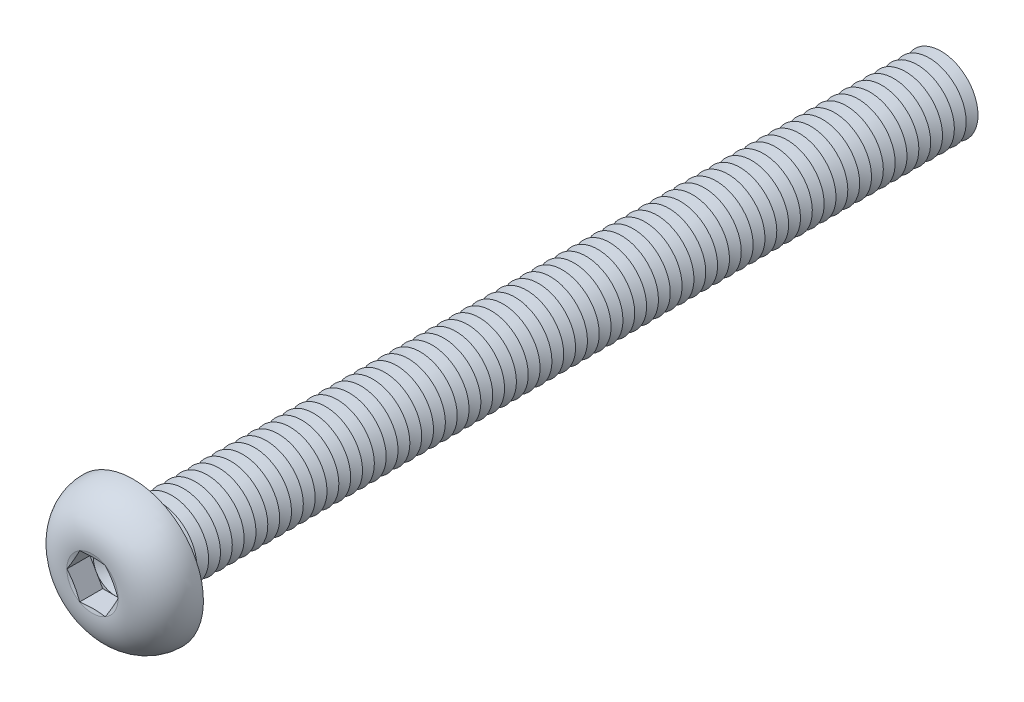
ISO-10303-21;
HEADER;
FILE_DESCRIPTION(('STEP AP214'),'2;1');
FILE_NAME('part.step','',(''),(''),'','','');
FILE_SCHEMA(('AUTOMOTIVE_DESIGN { 1 0 10303 214 1 1 1 1 }'));
ENDSEC;
DATA;
#1=APPLICATION_CONTEXT('core data for automotive mechanical design processes');
#2=APPLICATION_PROTOCOL_DEFINITION('international standard','automotive_design',2000,#1);
#3=PRODUCT_CONTEXT('',#1,'mechanical');
#4=PRODUCT('Part','Part','',(#3));
#5=PRODUCT_RELATED_PRODUCT_CATEGORY('part','',(#4));
#6=PRODUCT_DEFINITION_FORMATION('','',#4);
#7=PRODUCT_DEFINITION_CONTEXT('part definition',#1,'design');
#8=PRODUCT_DEFINITION('design','',#6,#7);
#9=PRODUCT_DEFINITION_SHAPE('','',#8);
#10=(LENGTH_UNIT() NAMED_UNIT(*) SI_UNIT(.MILLI.,.METRE.));
#11=(NAMED_UNIT(*) PLANE_ANGLE_UNIT() SI_UNIT($,.RADIAN.));
#12=(NAMED_UNIT(*) SI_UNIT($,.STERADIAN.) SOLID_ANGLE_UNIT());
#13=UNCERTAINTY_MEASURE_WITH_UNIT(LENGTH_MEASURE(1.E-05),#10,'distance_accuracy_value','');
#14=(GEOMETRIC_REPRESENTATION_CONTEXT(3) GLOBAL_UNCERTAINTY_ASSIGNED_CONTEXT((#13)) GLOBAL_UNIT_ASSIGNED_CONTEXT((#10,
#11,#12)) REPRESENTATION_CONTEXT('',''));
#15=CARTESIAN_POINT('',(0.,0.,0.));
#16=DIRECTION('',(0.,0.,1.));
#17=DIRECTION('',(1.,0.,0.));
#18=AXIS2_PLACEMENT_3D('',#15,#16,#17);
#19=CARTESIAN_POINT('',(0.,0.,1.19));
#20=DIRECTION('',(0.,0.,1.));
#21=DIRECTION('',(1.,0.,0.));
#22=AXIS2_PLACEMENT_3D('',#19,#20,#21);
#23=PLANE('',#22);
#24=CARTESIAN_POINT('',(0.,0.,1.19));
#25=DIRECTION('',(0.,0.,1.));
#26=DIRECTION('',(1.,0.,0.));
#27=AXIS2_PLACEMENT_3D('',#24,#25,#26);
#28=CIRCLE('',#27,1.49999930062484);
#29=CARTESIAN_POINT('',(1.2990375,0.749999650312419,1.19));
#30=VERTEX_POINT('',#29);
#31=CARTESIAN_POINT('',(0.,1.49999930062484,1.19));
#32=VERTEX_POINT('',#31);
#33=EDGE_CURVE('E118',#30,#32,#28,.T.);
#34=ORIENTED_EDGE('',*,*,#33,.F.);
#35=DIRECTION('',(-0.5,0.866025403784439,0.));
#36=VECTOR('',#35,1.);
#37=CARTESIAN_POINT('',(1.73205,0.,1.19));
#38=LINE('',#37,#36);
#39=CARTESIAN_POINT('',(0.866025,1.49999930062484,1.19));
#40=VERTEX_POINT('',#39);
#41=EDGE_CURVE('E125',#30,#40,#38,.T.);
#42=ORIENTED_EDGE('',*,*,#41,.T.);
#43=DIRECTION('',(-1.,0.,0.));
#44=VECTOR('',#43,1.);
#45=CARTESIAN_POINT('',(0.866025,1.49999930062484,1.19));
#46=LINE('',#45,#44);
#47=EDGE_CURVE('E136',#40,#32,#46,.T.);
#48=ORIENTED_EDGE('',*,*,#47,.T.);
#49=EDGE_LOOP('',(#34,#42,#48));
#50=FACE_BOUND('',#49,.T.);
#51=ADVANCED_FACE('F39',(#50),#23,.T.);
#52=CARTESIAN_POINT('',(0.,0.,1.19));
#53=DIRECTION('',(0.,0.,1.));
#54=DIRECTION('',(1.,0.,0.));
#55=AXIS2_PLACEMENT_3D('',#52,#53,#54);
#56=CIRCLE('',#55,1.49999930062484);
#57=CARTESIAN_POINT('',(-1.2990375,0.749999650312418,1.19));
#58=VERTEX_POINT('',#57);
#59=EDGE_CURVE('E11',#32,#58,#56,.T.);
#60=ORIENTED_EDGE('',*,*,#59,.F.);
#61=CARTESIAN_POINT('',(-0.866025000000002,1.49999930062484,1.19));
#62=VERTEX_POINT('',#61);
#63=EDGE_CURVE('E131',#32,#62,#46,.T.);
#64=ORIENTED_EDGE('',*,*,#63,.T.);
#65=DIRECTION('',(-0.5,-0.866025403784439,0.));
#66=VECTOR('',#65,1.);
#67=CARTESIAN_POINT('',(-0.866025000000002,1.49999930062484,1.19));
#68=LINE('',#67,#66);
#69=EDGE_CURVE('E134',#62,#58,#68,.T.);
#70=ORIENTED_EDGE('',*,*,#69,.T.);
#71=EDGE_LOOP('',(#60,#64,#70));
#72=FACE_BOUND('',#71,.T.);
#73=ADVANCED_FACE('F130',(#72),#23,.T.);
#74=CARTESIAN_POINT('',(-1.2990375,-0.749999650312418,1.19));
#75=VERTEX_POINT('',#74);
#76=EDGE_CURVE('E49',#58,#75,#56,.T.);
#77=ORIENTED_EDGE('',*,*,#76,.F.);
#78=CARTESIAN_POINT('',(-1.73205,0.,1.19));
#79=VERTEX_POINT('',#78);
#80=EDGE_CURVE('E143',#58,#79,#68,.T.);
#81=ORIENTED_EDGE('',*,*,#80,.T.);
#82=DIRECTION('',(0.5,-0.866025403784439,0.));
#83=VECTOR('',#82,1.);
#84=CARTESIAN_POINT('',(-1.73205,0.,1.19));
#85=LINE('',#84,#83);
#86=EDGE_CURVE('E152',#79,#75,#85,.T.);
#87=ORIENTED_EDGE('',*,*,#86,.T.);
#88=EDGE_LOOP('',(#77,#81,#87));
#89=FACE_BOUND('',#88,.T.);
#90=ADVANCED_FACE('F816',(#89),#23,.T.);
#91=CARTESIAN_POINT('',(0.,-1.49999930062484,1.19));
#92=VERTEX_POINT('',#91);
#93=EDGE_CURVE('E800',#75,#92,#56,.T.);
#94=ORIENTED_EDGE('',*,*,#93,.F.);
#95=CARTESIAN_POINT('',(-0.866025,-1.49999930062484,1.19));
#96=VERTEX_POINT('',#95);
#97=EDGE_CURVE('E151',#75,#96,#85,.T.);
#98=ORIENTED_EDGE('',*,*,#97,.T.);
#99=DIRECTION('',(1.,0.,0.));
#100=VECTOR('',#99,1.);
#101=CARTESIAN_POINT('',(-0.866025,-1.49999930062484,1.19));
#102=LINE('',#101,#100);
#103=EDGE_CURVE('E156',#96,#92,#102,.T.);
#104=ORIENTED_EDGE('',*,*,#103,.T.);
#105=EDGE_LOOP('',(#94,#98,#104));
#106=FACE_BOUND('',#105,.T.);
#107=ADVANCED_FACE('F809',(#106),#23,.T.);
#108=CARTESIAN_POINT('',(1.2990375,-0.749999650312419,1.19));
#109=VERTEX_POINT('',#108);
#110=EDGE_CURVE('E56',#92,#109,#56,.T.);
#111=ORIENTED_EDGE('',*,*,#110,.F.);
#112=CARTESIAN_POINT('',(0.866025,-1.49999930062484,1.19));
#113=VERTEX_POINT('',#112);
#114=EDGE_CURVE('E155',#92,#113,#102,.T.);
#115=ORIENTED_EDGE('',*,*,#114,.T.);
#116=DIRECTION('',(0.5,0.866025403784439,0.));
#117=VECTOR('',#116,1.);
#118=CARTESIAN_POINT('',(0.866025,-1.49999930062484,1.19));
#119=LINE('',#118,#117);
#120=EDGE_CURVE('E161',#113,#109,#119,.T.);
#121=ORIENTED_EDGE('',*,*,#120,.T.);
#122=EDGE_LOOP('',(#111,#115,#121));
#123=FACE_BOUND('',#122,.T.);
#124=ADVANCED_FACE('F886',(#123),#23,.T.);
#125=CARTESIAN_POINT('',(0.,0.,2.75));
#126=DIRECTION('',(0.,0.,1.));
#127=DIRECTION('',(0.,-1.,0.));
#128=AXIS2_PLACEMENT_3D('',#125,#126,#127);
#129=CONICAL_SURFACE('',#128,1.73205,1.30899693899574);
#130=CARTESIAN_POINT('',(1.73216547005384,-0.000200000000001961,2.75003094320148));
#131=CARTESIAN_POINT('',(1.69619207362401,0.0621077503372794,2.74038633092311));
#132=CARTESIAN_POINT('',(1.66015343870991,0.124528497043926,2.73163050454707));
#133=CARTESIAN_POINT('',(1.58794885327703,0.249590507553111,2.71624720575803));
#134=CARTESIAN_POINT('',(1.5517828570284,0.312231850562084,2.7096205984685));
#135=CARTESIAN_POINT('',(1.47954289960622,0.437355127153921,2.69888271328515));
#136=CARTESIAN_POINT('',(1.4434694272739,0.499836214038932,2.69475862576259));
#137=CARTESIAN_POINT('',(1.37127646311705,0.624878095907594,2.68922863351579));
#138=CARTESIAN_POINT('',(1.33515698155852,0.687438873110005,2.68782220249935));
#139=CARTESIAN_POINT('',(1.26291801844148,0.812560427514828,2.68782220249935));
#140=CARTESIAN_POINT('',(1.22679853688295,0.875121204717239,2.68922863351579));
#141=CARTESIAN_POINT('',(1.1546055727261,1.0001630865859,2.69475862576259));
#142=CARTESIAN_POINT('',(1.11853210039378,1.06264417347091,2.69888271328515));
#143=CARTESIAN_POINT('',(1.0462921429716,1.18776745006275,2.7096205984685));
#144=CARTESIAN_POINT('',(1.01012614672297,1.25040879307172,2.71624720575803));
#145=CARTESIAN_POINT('',(0.937921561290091,1.37547080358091,2.73163050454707));
#146=CARTESIAN_POINT('',(0.901882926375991,1.43789155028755,2.74038633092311));
#147=CARTESIAN_POINT('',(0.865909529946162,1.50019930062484,2.75003094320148));
#148=B_SPLINE_CURVE_WITH_KNOTS('',3,(#130,#131,#132,#133,#134,#135,#136,#137,#138,#139,#140,
#141,#142,#143,#144,#145,#146,#147),.UNSPECIFIED.,.F.,.F.,(4,2,2,2,2,2,2,2,4),(0.,
0.217782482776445,0.435653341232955,0.652399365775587,0.869103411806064,1.08580745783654,
1.30255348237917,1.52042434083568,1.73820682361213),.UNSPECIFIED.);
#149=CARTESIAN_POINT('',(1.73205,0.,2.75));
#150=VERTEX_POINT('',#149);
#151=CARTESIAN_POINT('',(0.866025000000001,1.49999930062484,2.75));
#152=VERTEX_POINT('',#151);
#153=EDGE_CURVE('E221',#150,#152,#148,.T.);
#154=ORIENTED_EDGE('',*,*,#153,.F.);
#155=CARTESIAN_POINT('',(0.,0.,2.75));
#156=DIRECTION('',(0.,0.,-1.));
#157=DIRECTION('',(0.,1.,0.));
#158=AXIS2_PLACEMENT_3D('',#155,#156,#157);
#159=CIRCLE('',#158,1.73205);
#160=EDGE_CURVE('E781',#152,#150,#159,.T.);
#161=ORIENTED_EDGE('',*,*,#160,.F.);
#162=EDGE_LOOP('',(#154,#161));
#163=FACE_BOUND('',#162,.T.);
#164=ADVANCED_FACE('F890',(#163),#129,.F.);
#165=CARTESIAN_POINT('',(0.865909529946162,-1.50019930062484,2.75003094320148));
#166=CARTESIAN_POINT('',(0.901882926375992,-1.43789155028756,2.74038633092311));
#167=CARTESIAN_POINT('',(0.937921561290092,-1.37547080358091,2.73163050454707));
#168=CARTESIAN_POINT('',(1.01012614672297,-1.25040879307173,2.71624720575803));
#169=CARTESIAN_POINT('',(1.0462921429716,-1.18776745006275,2.7096205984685));
#170=CARTESIAN_POINT('',(1.11853210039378,-1.06264417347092,2.69888271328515));
#171=CARTESIAN_POINT('',(1.1546055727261,-1.00016308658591,2.69475862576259));
#172=CARTESIAN_POINT('',(1.22679853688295,-0.875121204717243,2.68922863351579));
#173=CARTESIAN_POINT('',(1.26291801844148,-0.812560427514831,2.68782220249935));
#174=CARTESIAN_POINT('',(1.33515698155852,-0.687438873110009,2.68782220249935));
#175=CARTESIAN_POINT('',(1.37127646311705,-0.624878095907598,2.68922863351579));
#176=CARTESIAN_POINT('',(1.4434694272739,-0.499836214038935,2.69475862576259));
#177=CARTESIAN_POINT('',(1.47954289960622,-0.437355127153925,2.69888271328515));
#178=CARTESIAN_POINT('',(1.5517828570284,-0.312231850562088,2.7096205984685));
#179=CARTESIAN_POINT('',(1.58794885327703,-0.249590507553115,2.71624720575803));
#180=CARTESIAN_POINT('',(1.66015343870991,-0.12452849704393,2.73163050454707));
#181=CARTESIAN_POINT('',(1.69619207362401,-0.0621077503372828,2.74038633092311));
#182=CARTESIAN_POINT('',(1.73216547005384,0.000199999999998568,2.75003094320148));
#183=B_SPLINE_CURVE_WITH_KNOTS('',3,(#165,#166,#167,#168,#169,#170,#171,#172,#173,#174,#175,
#176,#177,#178,#179,#180,#181,#182),.UNSPECIFIED.,.F.,.F.,(4,2,2,2,2,2,2,2,4),(0.,
0.217782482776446,0.435653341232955,0.652399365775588,0.869103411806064,1.08580745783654,
1.30255348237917,1.52042434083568,1.73820682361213),.UNSPECIFIED.);
#184=CARTESIAN_POINT('',(0.866025,-1.49999930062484,2.75));
#185=VERTEX_POINT('',#184);
#186=EDGE_CURVE('E230',#185,#150,#183,.T.);
#187=ORIENTED_EDGE('',*,*,#186,.F.);
#188=EDGE_CURVE('E786',#150,#185,#159,.T.);
#189=ORIENTED_EDGE('',*,*,#188,.F.);
#190=EDGE_LOOP('',(#187,#189));
#191=FACE_BOUND('',#190,.T.);
#192=ADVANCED_FACE('F851',(#191),#129,.F.);
#193=CARTESIAN_POINT('',(-2.61375031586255,-1.49999930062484,3.09338600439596));
#194=CARTESIAN_POINT('',(-2.48719895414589,-1.49999930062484,3.06401688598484));
#195=CARTESIAN_POINT('',(-2.36054180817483,-1.49999930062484,3.03507426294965));
#196=CARTESIAN_POINT('',(-2.10688190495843,-1.49999930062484,2.97862489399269));
#197=CARTESIAN_POINT('',(-1.97987908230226,-1.49999930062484,2.95111844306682));
#198=CARTESIAN_POINT('',(-1.72425281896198,-1.49999930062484,2.89788845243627));
#199=CARTESIAN_POINT('',(-1.59562534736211,-1.49999930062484,2.87218404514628));
#200=CARTESIAN_POINT('',(-1.33776732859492,-1.49999930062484,2.82387586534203));
#201=CARTESIAN_POINT('',(-1.20853672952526,-1.49999930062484,2.80127236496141));
#202=CARTESIAN_POINT('',(-0.952831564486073,-1.49999930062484,2.76126658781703));
#203=CARTESIAN_POINT('',(-0.826376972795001,-1.49999930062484,2.74374018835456));
#204=CARTESIAN_POINT('',(-0.572755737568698,-1.49999930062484,2.71502809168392));
#205=CARTESIAN_POINT('',(-0.44558933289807,-1.49999930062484,2.70384038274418));
#206=CARTESIAN_POINT('',(-0.191333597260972,-1.49999930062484,2.68972083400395));
#207=CARTESIAN_POINT('',(-0.0642464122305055,-1.49999930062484,2.68675270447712));
#208=CARTESIAN_POINT('',(0.189835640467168,-1.49999930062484,2.68959577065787));
#209=CARTESIAN_POINT('',(0.316830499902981,-1.49999930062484,2.69540767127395));
#210=CARTESIAN_POINT('',(0.534182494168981,-1.49999930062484,2.71190493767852));
#211=CARTESIAN_POINT('',(0.624691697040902,-1.49999930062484,2.72073513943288));
#212=CARTESIAN_POINT('',(0.805336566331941,-1.49999930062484,2.74156379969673));
#213=CARTESIAN_POINT('',(0.895472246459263,-1.49999930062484,2.75356214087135));
#214=CARTESIAN_POINT('',(1.0756572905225,-1.49999930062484,2.78006977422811));
#215=CARTESIAN_POINT('',(1.16570548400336,-1.49999930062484,2.7945868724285));
#216=CARTESIAN_POINT('',(1.3454787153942,-1.49999930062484,2.82550612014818));
#217=CARTESIAN_POINT('',(1.43520373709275,-1.49999930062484,2.8419083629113));
#218=CARTESIAN_POINT('',(1.61622412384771,-1.49999930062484,2.87648604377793));
#219=CARTESIAN_POINT('',(1.70751379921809,-1.49999930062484,2.89469103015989));
#220=CARTESIAN_POINT('',(1.88986344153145,-1.49999930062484,2.93221618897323));
#221=CARTESIAN_POINT('',(1.98092340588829,-1.49999930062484,2.95153637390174));
#222=CARTESIAN_POINT('',(2.16236354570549,-1.49999930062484,2.99091506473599));
#223=CARTESIAN_POINT('',(2.25274472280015,-1.49999930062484,3.01096897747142));
#224=CARTESIAN_POINT('',(2.43335289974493,-1.49999930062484,3.05173139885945));
#225=CARTESIAN_POINT('',(2.52357990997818,-1.49999930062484,3.07243986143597));
#226=CARTESIAN_POINT('',(2.61375031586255,-1.49999930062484,3.09338600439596));
#227=B_SPLINE_CURVE_WITH_KNOTS('',3,(#193,#194,#195,#196,#197,#198,#199,#200,#201,#202,#203,
#204,#205,#206,#207,#208,#209,#210,#211,#212,#213,#214,#215,#216,#217,#218,#219,#220,#221,#222,
#223,#224,#225,#226),.UNSPECIFIED.,.F.,.F.,(4,2,2,2,2,2,2,2,2,2,2,2,2,2,2,2,4),(0.,
0.389753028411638,0.779585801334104,1.17307326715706,1.5665952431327,1.94947555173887,
2.33223427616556,2.71330039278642,3.09439710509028,3.36715350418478,3.63989980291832,
3.91350699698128,4.18712773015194,4.4663802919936,4.74563598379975,5.02337106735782,
5.3010866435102),.UNSPECIFIED.);
#228=CARTESIAN_POINT('',(-0.866025,-1.49999930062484,2.75));
#229=VERTEX_POINT('',#228);
#230=EDGE_CURVE('E830',#229,#185,#227,.T.);
#231=ORIENTED_EDGE('',*,*,#230,.F.);
#232=EDGE_CURVE('E843',#185,#229,#159,.T.);
#233=ORIENTED_EDGE('',*,*,#232,.F.);
#234=EDGE_LOOP('',(#231,#233));
#235=FACE_BOUND('',#234,.T.);
#236=ADVANCED_FACE('F857',(#235),#129,.F.);
#237=CARTESIAN_POINT('',(-1.73216547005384,0.00019999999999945,2.75003094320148));
#238=CARTESIAN_POINT('',(-1.69619207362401,-0.0621077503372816,2.74038633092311));
#239=CARTESIAN_POINT('',(-1.66015343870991,-0.124528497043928,2.73163050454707));
#240=CARTESIAN_POINT('',(-1.58794885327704,-0.249590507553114,2.71624720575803));
#241=CARTESIAN_POINT('',(-1.55178285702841,-0.312231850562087,2.7096205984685));
#242=CARTESIAN_POINT('',(-1.47954289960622,-0.437355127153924,2.69888271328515));
#243=CARTESIAN_POINT('',(-1.4434694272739,-0.499836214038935,2.69475862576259));
#244=CARTESIAN_POINT('',(-1.37127646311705,-0.624878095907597,2.68922863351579));
#245=CARTESIAN_POINT('',(-1.33515698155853,-0.687438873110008,2.68782220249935));
#246=CARTESIAN_POINT('',(-1.26291801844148,-0.812560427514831,2.68782220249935));
#247=CARTESIAN_POINT('',(-1.22679853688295,-0.875121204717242,2.68922863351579));
#248=CARTESIAN_POINT('',(-1.1546055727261,-1.0001630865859,2.69475862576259));
#249=CARTESIAN_POINT('',(-1.11853210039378,-1.06264417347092,2.69888271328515));
#250=CARTESIAN_POINT('',(-1.0462921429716,-1.18776745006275,2.7096205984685));
#251=CARTESIAN_POINT('',(-1.01012614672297,-1.25040879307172,2.71624720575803));
#252=CARTESIAN_POINT('',(-0.937921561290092,-1.37547080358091,2.73163050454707));
#253=CARTESIAN_POINT('',(-0.901882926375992,-1.43789155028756,2.74038633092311));
#254=CARTESIAN_POINT('',(-0.865909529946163,-1.50019930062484,2.75003094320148));
#255=B_SPLINE_CURVE_WITH_KNOTS('',3,(#237,#238,#239,#240,#241,#242,#243,#244,#245,#246,#247,
#248,#249,#250,#251,#252,#253,#254),.UNSPECIFIED.,.F.,.F.,(4,2,2,2,2,2,2,2,4),(0.,
0.217782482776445,0.435653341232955,0.652399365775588,0.869103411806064,1.08580745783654,
1.30255348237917,1.52042434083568,1.73820682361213),.UNSPECIFIED.);
#256=CARTESIAN_POINT('',(-1.73205,0.,2.75));
#257=VERTEX_POINT('',#256);
#258=EDGE_CURVE('E821',#257,#229,#255,.T.);
#259=ORIENTED_EDGE('',*,*,#258,.F.);
#260=EDGE_CURVE('E827',#229,#257,#159,.T.);
#261=ORIENTED_EDGE('',*,*,#260,.F.);
#262=EDGE_LOOP('',(#259,#261));
#263=FACE_BOUND('',#262,.T.);
#264=ADVANCED_FACE('F825',(#263),#129,.F.);
#265=CARTESIAN_POINT('',(-0.865909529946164,1.50019930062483,2.75003094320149));
#266=CARTESIAN_POINT('',(-0.901882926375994,1.43789155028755,2.74038633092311));
#267=CARTESIAN_POINT('',(-0.937921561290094,1.37547080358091,2.73163050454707));
#268=CARTESIAN_POINT('',(-1.01012614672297,1.25040879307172,2.71624720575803));
#269=CARTESIAN_POINT('',(-1.0462921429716,1.18776745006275,2.7096205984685));
#270=CARTESIAN_POINT('',(-1.11853210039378,1.06264417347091,2.69888271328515));
#271=CARTESIAN_POINT('',(-1.1546055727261,1.0001630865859,2.69475862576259));
#272=CARTESIAN_POINT('',(-1.22679853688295,0.87512120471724,2.68922863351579));
#273=CARTESIAN_POINT('',(-1.26291801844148,0.812560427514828,2.68782220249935));
#274=CARTESIAN_POINT('',(-1.33515698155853,0.687438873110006,2.68782220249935));
#275=CARTESIAN_POINT('',(-1.37127646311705,0.624878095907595,2.68922863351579));
#276=CARTESIAN_POINT('',(-1.4434694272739,0.499836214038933,2.69475862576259));
#277=CARTESIAN_POINT('',(-1.47954289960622,0.437355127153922,2.69888271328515));
#278=CARTESIAN_POINT('',(-1.55178285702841,0.312231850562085,2.7096205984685));
#279=CARTESIAN_POINT('',(-1.58794885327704,0.249590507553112,2.71624720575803));
#280=CARTESIAN_POINT('',(-1.66015343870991,0.124528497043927,2.73163050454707));
#281=CARTESIAN_POINT('',(-1.69619207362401,0.0621077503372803,2.74038633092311));
#282=CARTESIAN_POINT('',(-1.73216547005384,-0.000200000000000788,2.75003094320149));
#283=B_SPLINE_CURVE_WITH_KNOTS('',3,(#265,#266,#267,#268,#269,#270,#271,#272,#273,#274,#275,
#276,#277,#278,#279,#280,#281,#282),.UNSPECIFIED.,.F.,.F.,(4,2,2,2,2,2,2,2,4),(0.,
0.217782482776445,0.435653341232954,0.652399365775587,0.869103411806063,1.08580745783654,
1.30255348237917,1.52042434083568,1.73820682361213),.UNSPECIFIED.);
#284=CARTESIAN_POINT('',(-0.866025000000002,1.49999930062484,2.75));
#285=VERTEX_POINT('',#284);
#286=EDGE_CURVE('E194',#285,#257,#283,.T.);
#287=ORIENTED_EDGE('',*,*,#286,.F.);
#288=EDGE_CURVE('E833',#257,#285,#159,.T.);
#289=ORIENTED_EDGE('',*,*,#288,.F.);
#290=EDGE_LOOP('',(#287,#289));
#291=FACE_BOUND('',#290,.T.);
#292=ADVANCED_FACE('F834',(#291),#129,.F.);
#293=CARTESIAN_POINT('',(0.,0.,-52.2));
#294=DIRECTION('',(0.,0.,1.));
#295=DIRECTION('',(0.,-1.,0.));
#296=AXIS2_PLACEMENT_3D('',#293,#294,#295);
#297=CONICAL_SURFACE('',#296,2.49999999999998,1.0471975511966);
#298=CARTESIAN_POINT('',(0.,0.,-52.6));
#299=DIRECTION('',(0.,0.,1.));
#300=DIRECTION('',(0.,-1.,0.));
#301=AXIS2_PLACEMENT_3D('',#298,#299,#300);
#302=CIRCLE('',#301,1.80717967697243);
#303=CARTESIAN_POINT('',(0.,-1.8071796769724,-52.6));
#304=VERTEX_POINT('',#303);
#305=EDGE_CURVE('E752',#304,#304,#302,.T.);
#306=ORIENTED_EDGE('',*,*,#305,.T.);
#307=EDGE_LOOP('',(#306));
#308=FACE_BOUND('',#307,.T.);
#309=CARTESIAN_POINT('',(0.,0.,-52.2));
#310=DIRECTION('',(0.,0.,1.));
#311=DIRECTION('',(0.,-1.,0.));
#312=AXIS2_PLACEMENT_3D('',#309,#310,#311);
#313=CIRCLE('',#312,2.49999999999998);
#314=CARTESIAN_POINT('',(0.,-2.49999999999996,-52.2));
#315=VERTEX_POINT('',#314);
#316=EDGE_CURVE('E748',#315,#315,#313,.T.);
#317=ORIENTED_EDGE('',*,*,#316,.F.);
#318=EDGE_LOOP('',(#317));
#319=FACE_BOUND('',#318,.T.);
#320=ADVANCED_FACE('F914',(#308,#319),#297,.T.);
#321=CARTESIAN_POINT('',(0.,0.,-52.6));
#322=DIRECTION('',(0.,0.,-1.));
#323=DIRECTION('',(0.,1.,0.));
#324=AXIS2_PLACEMENT_3D('',#321,#322,#323);
#325=CONICAL_SURFACE('',#324,1.80717967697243,1.04719755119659);
#326=CARTESIAN_POINT('',(0.,0.,-53.));
#327=DIRECTION('',(0.,0.,1.));
#328=DIRECTION('',(0.,-1.,0.));
#329=AXIS2_PLACEMENT_3D('',#326,#327,#328);
#330=CIRCLE('',#329,2.49999999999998);
#331=CARTESIAN_POINT('',(0.,-2.49999999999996,-53.));
#332=VERTEX_POINT('',#331);
#333=EDGE_CURVE('E756',#332,#332,#330,.T.);
#334=ORIENTED_EDGE('',*,*,#333,.T.);
#335=EDGE_LOOP('',(#334));
#336=FACE_BOUND('',#335,.T.);
#337=ORIENTED_EDGE('',*,*,#305,.F.);
#338=EDGE_LOOP('',(#337));
#339=FACE_BOUND('',#338,.T.);
#340=ADVANCED_FACE('F919',(#336,#339),#325,.T.);
#341=CARTESIAN_POINT('',(0.,2.49999999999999,-55.));
#342=DIRECTION('',(0.,0.,-1.));
#343=DIRECTION('',(0.,1.,0.));
#344=AXIS2_PLACEMENT_3D('',#341,#342,#343);
#345=PLANE('',#344);
#346=CARTESIAN_POINT('',(0.,0.,-55.));
#347=DIRECTION('',(0.,0.,1.));
#348=DIRECTION('',(0.,-1.,0.));
#349=AXIS2_PLACEMENT_3D('',#346,#347,#348);
#350=CIRCLE('',#349,1.80717967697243);
#351=CARTESIAN_POINT('',(0.,-1.8071796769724,-55.));
#352=VERTEX_POINT('',#351);
#353=EDGE_CURVE('E776',#352,#352,#350,.T.);
#354=ORIENTED_EDGE('',*,*,#353,.F.);
#355=EDGE_LOOP('',(#354));
#356=FACE_BOUND('',#355,.T.);
#357=ADVANCED_FACE('F1094',(#356),#345,.T.);
#358=CARTESIAN_POINT('',(0.,0.,-54.6));
#359=DIRECTION('',(0.,0.,1.));
#360=DIRECTION('',(0.,-1.,0.));
#361=AXIS2_PLACEMENT_3D('',#358,#359,#360);
#362=CONICAL_SURFACE('',#361,2.49999999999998,1.0471975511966);
#363=ORIENTED_EDGE('',*,*,#353,.T.);
#364=EDGE_LOOP('',(#363));
#365=FACE_BOUND('',#364,.T.);
#366=CARTESIAN_POINT('',(0.,0.,-54.6));
#367=DIRECTION('',(0.,0.,1.));
#368=DIRECTION('',(0.,-1.,0.));
#369=AXIS2_PLACEMENT_3D('',#366,#367,#368);
#370=CIRCLE('',#369,2.49999999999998);
#371=CARTESIAN_POINT('',(0.,-2.49999999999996,-54.6));
#372=VERTEX_POINT('',#371);
#373=EDGE_CURVE('E772',#372,#372,#370,.T.);
#374=ORIENTED_EDGE('',*,*,#373,.F.);
#375=EDGE_LOOP('',(#374));
#376=FACE_BOUND('',#375,.T.);
#377=ADVANCED_FACE('F1087',(#365,#376),#362,.T.);
#378=CARTESIAN_POINT('',(0.,0.,-54.2));
#379=DIRECTION('',(0.,0.,-1.));
#380=DIRECTION('',(0.,1.,0.));
#381=AXIS2_PLACEMENT_3D('',#378,#379,#380);
#382=CONICAL_SURFACE('',#381,1.80717967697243,1.04719755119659);
#383=ORIENTED_EDGE('',*,*,#373,.T.);
#384=EDGE_LOOP('',(#383));
#385=FACE_BOUND('',#384,.T.);
#386=CARTESIAN_POINT('',(0.,0.,-54.2));
#387=DIRECTION('',(0.,0.,1.));
#388=DIRECTION('',(0.,-1.,0.));
#389=AXIS2_PLACEMENT_3D('',#386,#387,#388);
#390=CIRCLE('',#389,1.80717967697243);
#391=CARTESIAN_POINT('',(0.,-1.8071796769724,-54.2));
#392=VERTEX_POINT('',#391);
#393=EDGE_CURVE('E768',#392,#392,#390,.T.);
#394=ORIENTED_EDGE('',*,*,#393,.F.);
#395=EDGE_LOOP('',(#394));
#396=FACE_BOUND('',#395,.T.);
#397=ADVANCED_FACE('F1093',(#385,#396),#382,.T.);
#398=CARTESIAN_POINT('',(0.,0.,-53.8));
#399=DIRECTION('',(0.,0.,1.));
#400=DIRECTION('',(0.,-1.,0.));
#401=AXIS2_PLACEMENT_3D('',#398,#399,#400);
#402=CONICAL_SURFACE('',#401,2.49999999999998,1.0471975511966);
#403=ORIENTED_EDGE('',*,*,#393,.T.);
#404=EDGE_LOOP('',(#403));
#405=FACE_BOUND('',#404,.T.);
#406=CARTESIAN_POINT('',(0.,0.,-53.8));
#407=DIRECTION('',(0.,0.,1.));
#408=DIRECTION('',(0.,-1.,0.));
#409=AXIS2_PLACEMENT_3D('',#406,#407,#408);
#410=CIRCLE('',#409,2.49999999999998);
#411=CARTESIAN_POINT('',(0.,-2.49999999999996,-53.8));
#412=VERTEX_POINT('',#411);
#413=EDGE_CURVE('E764',#412,#412,#410,.T.);
#414=ORIENTED_EDGE('',*,*,#413,.F.);
#415=EDGE_LOOP('',(#414));
#416=FACE_BOUND('',#415,.T.);
#417=ADVANCED_FACE('F1125',(#405,#416),#402,.T.);
#418=CARTESIAN_POINT('',(0.,0.,-53.4));
#419=DIRECTION('',(0.,0.,-1.));
#420=DIRECTION('',(0.,1.,0.));
#421=AXIS2_PLACEMENT_3D('',#418,#419,#420);
#422=CONICAL_SURFACE('',#421,1.80717967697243,1.04719755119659);
#423=ORIENTED_EDGE('',*,*,#413,.T.);
#424=EDGE_LOOP('',(#423));
#425=FACE_BOUND('',#424,.T.);
#426=CARTESIAN_POINT('',(0.,0.,-53.4));
#427=DIRECTION('',(0.,0.,1.));
#428=DIRECTION('',(0.,-1.,0.));
#429=AXIS2_PLACEMENT_3D('',#426,#427,#428);
#430=CIRCLE('',#429,1.80717967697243);
#431=CARTESIAN_POINT('',(0.,-1.8071796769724,-53.4));
#432=VERTEX_POINT('',#431);
#433=EDGE_CURVE('E760',#432,#432,#430,.T.);
#434=ORIENTED_EDGE('',*,*,#433,.F.);
#435=EDGE_LOOP('',(#434));
#436=FACE_BOUND('',#435,.T.);
#437=ADVANCED_FACE('F1135',(#425,#436),#422,.T.);
#438=CARTESIAN_POINT('',(0.,0.,-53.));
#439=DIRECTION('',(0.,0.,1.));
#440=DIRECTION('',(0.,-1.,0.));
#441=AXIS2_PLACEMENT_3D('',#438,#439,#440);
#442=CONICAL_SURFACE('',#441,2.49999999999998,1.0471975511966);
#443=ORIENTED_EDGE('',*,*,#433,.T.);
#444=EDGE_LOOP('',(#443));
#445=FACE_BOUND('',#444,.T.);
#446=ORIENTED_EDGE('',*,*,#333,.F.);
#447=EDGE_LOOP('',(#446));
#448=FACE_BOUND('',#447,.T.);
#449=ADVANCED_FACE('F1145',(#445,#448),#442,.T.);
#450=CARTESIAN_POINT('',(0.,0.,-51.4));
#451=DIRECTION('',(0.,0.,1.));
#452=DIRECTION('',(0.,-1.,0.));
#453=AXIS2_PLACEMENT_3D('',#450,#451,#452);
#454=CONICAL_SURFACE('',#453,2.49999999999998,1.0471975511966);
#455=CARTESIAN_POINT('',(0.,0.,-51.8));
#456=DIRECTION('',(0.,0.,1.));
#457=DIRECTION('',(0.,-1.,0.));
#458=AXIS2_PLACEMENT_3D('',#455,#456,#457);
#459=CIRCLE('',#458,1.80717967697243);
#460=CARTESIAN_POINT('',(0.,-1.8071796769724,-51.8));
#461=VERTEX_POINT('',#460);
#462=EDGE_CURVE('E744',#461,#461,#459,.T.);
#463=ORIENTED_EDGE('',*,*,#462,.T.);
#464=EDGE_LOOP('',(#463));
#465=FACE_BOUND('',#464,.T.);
#466=CARTESIAN_POINT('',(0.,0.,-51.4));
#467=DIRECTION('',(0.,0.,1.));
#468=DIRECTION('',(0.,-1.,0.));
#469=AXIS2_PLACEMENT_3D('',#466,#467,#468);
#470=CIRCLE('',#469,2.49999999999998);
#471=CARTESIAN_POINT('',(0.,-2.49999999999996,-51.4));
#472=VERTEX_POINT('',#471);
#473=EDGE_CURVE('E740',#472,#472,#470,.T.);
#474=ORIENTED_EDGE('',*,*,#473,.F.);
#475=EDGE_LOOP('',(#474));
#476=FACE_BOUND('',#475,.T.);
#477=ADVANCED_FACE('F1155',(#465,#476),#454,.T.);
#478=CARTESIAN_POINT('',(0.,0.,-51.8));
#479=DIRECTION('',(0.,0.,-1.));
#480=DIRECTION('',(0.,1.,0.));
#481=AXIS2_PLACEMENT_3D('',#478,#479,#480);
#482=CONICAL_SURFACE('',#481,1.80717967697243,1.04719755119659);
#483=ORIENTED_EDGE('',*,*,#316,.T.);
#484=EDGE_LOOP('',(#483));
#485=FACE_BOUND('',#484,.T.);
#486=ORIENTED_EDGE('',*,*,#462,.F.);
#487=EDGE_LOOP('',(#486));
#488=FACE_BOUND('',#487,.T.);
#489=ADVANCED_FACE('F1165',(#485,#488),#482,.T.);
#490=CARTESIAN_POINT('',(0.,0.,-50.6));
#491=DIRECTION('',(0.,0.,1.));
#492=DIRECTION('',(0.,-1.,0.));
#493=AXIS2_PLACEMENT_3D('',#490,#491,#492);
#494=CONICAL_SURFACE('',#493,2.49999999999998,1.0471975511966);
#495=CARTESIAN_POINT('',(0.,0.,-51.));
#496=DIRECTION('',(0.,0.,1.));
#497=DIRECTION('',(0.,-1.,0.));
#498=AXIS2_PLACEMENT_3D('',#495,#496,#497);
#499=CIRCLE('',#498,1.80717967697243);
#500=CARTESIAN_POINT('',(0.,-1.80717967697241,-51.));
#501=VERTEX_POINT('',#500);
#502=EDGE_CURVE('E736',#501,#501,#499,.T.);
#503=ORIENTED_EDGE('',*,*,#502,.T.);
#504=EDGE_LOOP('',(#503));
#505=FACE_BOUND('',#504,.T.);
#506=CARTESIAN_POINT('',(0.,0.,-50.6));
#507=DIRECTION('',(0.,0.,1.));
#508=DIRECTION('',(0.,-1.,0.));
#509=AXIS2_PLACEMENT_3D('',#506,#507,#508);
#510=CIRCLE('',#509,2.49999999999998);
#511=CARTESIAN_POINT('',(0.,-2.49999999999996,-50.6));
#512=VERTEX_POINT('',#511);
#513=EDGE_CURVE('E732',#512,#512,#510,.T.);
#514=ORIENTED_EDGE('',*,*,#513,.F.);
#515=EDGE_LOOP('',(#514));
#516=FACE_BOUND('',#515,.T.);
#517=ADVANCED_FACE('F1175',(#505,#516),#494,.T.);
#518=CARTESIAN_POINT('',(0.,0.,-51.));
#519=DIRECTION('',(0.,0.,-1.));
#520=DIRECTION('',(0.,1.,0.));
#521=AXIS2_PLACEMENT_3D('',#518,#519,#520);
#522=CONICAL_SURFACE('',#521,1.80717967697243,1.04719755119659);
#523=ORIENTED_EDGE('',*,*,#473,.T.);
#524=EDGE_LOOP('',(#523));
#525=FACE_BOUND('',#524,.T.);
#526=ORIENTED_EDGE('',*,*,#502,.F.);
#527=EDGE_LOOP('',(#526));
#528=FACE_BOUND('',#527,.T.);
#529=ADVANCED_FACE('F1185',(#525,#528),#522,.T.);
#530=CARTESIAN_POINT('',(0.,0.,-49.8));
#531=DIRECTION('',(0.,0.,1.));
#532=DIRECTION('',(0.,-1.,0.));
#533=AXIS2_PLACEMENT_3D('',#530,#531,#532);
#534=CONICAL_SURFACE('',#533,2.49999999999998,1.0471975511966);
#535=CARTESIAN_POINT('',(0.,0.,-50.2));
#536=DIRECTION('',(0.,0.,1.));
#537=DIRECTION('',(0.,-1.,0.));
#538=AXIS2_PLACEMENT_3D('',#535,#536,#537);
#539=CIRCLE('',#538,1.80717967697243);
#540=CARTESIAN_POINT('',(0.,-1.80717967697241,-50.2));
#541=VERTEX_POINT('',#540);
#542=EDGE_CURVE('E728',#541,#541,#539,.T.);
#543=ORIENTED_EDGE('',*,*,#542,.T.);
#544=EDGE_LOOP('',(#543));
#545=FACE_BOUND('',#544,.T.);
#546=CARTESIAN_POINT('',(0.,0.,-49.8));
#547=DIRECTION('',(0.,0.,1.));
#548=DIRECTION('',(0.,-1.,0.));
#549=AXIS2_PLACEMENT_3D('',#546,#547,#548);
#550=CIRCLE('',#549,2.49999999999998);
#551=CARTESIAN_POINT('',(0.,-2.49999999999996,-49.8));
#552=VERTEX_POINT('',#551);
#553=EDGE_CURVE('E724',#552,#552,#550,.T.);
#554=ORIENTED_EDGE('',*,*,#553,.F.);
#555=EDGE_LOOP('',(#554));
#556=FACE_BOUND('',#555,.T.);
#557=ADVANCED_FACE('F1195',(#545,#556),#534,.T.);
#558=CARTESIAN_POINT('',(0.,0.,-50.2));
#559=DIRECTION('',(0.,0.,-1.));
#560=DIRECTION('',(0.,1.,0.));
#561=AXIS2_PLACEMENT_3D('',#558,#559,#560);
#562=CONICAL_SURFACE('',#561,1.80717967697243,1.04719755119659);
#563=ORIENTED_EDGE('',*,*,#513,.T.);
#564=EDGE_LOOP('',(#563));
#565=FACE_BOUND('',#564,.T.);
#566=ORIENTED_EDGE('',*,*,#542,.F.);
#567=EDGE_LOOP('',(#566));
#568=FACE_BOUND('',#567,.T.);
#569=ADVANCED_FACE('F1205',(#565,#568),#562,.T.);
#570=CARTESIAN_POINT('',(0.,0.,-49.));
#571=DIRECTION('',(0.,0.,1.));
#572=DIRECTION('',(0.,-1.,0.));
#573=AXIS2_PLACEMENT_3D('',#570,#571,#572);
#574=CONICAL_SURFACE('',#573,2.49999999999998,1.0471975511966);
#575=CARTESIAN_POINT('',(0.,0.,-49.4));
#576=DIRECTION('',(0.,0.,1.));
#577=DIRECTION('',(0.,-1.,0.));
#578=AXIS2_PLACEMENT_3D('',#575,#576,#577);
#579=CIRCLE('',#578,1.80717967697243);
#580=CARTESIAN_POINT('',(0.,-1.80717967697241,-49.4));
#581=VERTEX_POINT('',#580);
#582=EDGE_CURVE('E720',#581,#581,#579,.T.);
#583=ORIENTED_EDGE('',*,*,#582,.T.);
#584=EDGE_LOOP('',(#583));
#585=FACE_BOUND('',#584,.T.);
#586=CARTESIAN_POINT('',(0.,0.,-49.));
#587=DIRECTION('',(0.,0.,1.));
#588=DIRECTION('',(0.,-1.,0.));
#589=AXIS2_PLACEMENT_3D('',#586,#587,#588);
#590=CIRCLE('',#589,2.49999999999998);
#591=CARTESIAN_POINT('',(0.,-2.49999999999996,-49.));
#592=VERTEX_POINT('',#591);
#593=EDGE_CURVE('E716',#592,#592,#590,.T.);
#594=ORIENTED_EDGE('',*,*,#593,.F.);
#595=EDGE_LOOP('',(#594));
#596=FACE_BOUND('',#595,.T.);
#597=ADVANCED_FACE('F1215',(#585,#596),#574,.T.);
#598=CARTESIAN_POINT('',(0.,0.,-49.4));
#599=DIRECTION('',(0.,0.,-1.));
#600=DIRECTION('',(0.,1.,0.));
#601=AXIS2_PLACEMENT_3D('',#598,#599,#600);
#602=CONICAL_SURFACE('',#601,1.80717967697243,1.04719755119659);
#603=ORIENTED_EDGE('',*,*,#553,.T.);
#604=EDGE_LOOP('',(#603));
#605=FACE_BOUND('',#604,.T.);
#606=ORIENTED_EDGE('',*,*,#582,.F.);
#607=EDGE_LOOP('',(#606));
#608=FACE_BOUND('',#607,.T.);
#609=ADVANCED_FACE('F1225',(#605,#608),#602,.T.);
#610=CARTESIAN_POINT('',(0.,0.,-48.2));
#611=DIRECTION('',(0.,0.,1.));
#612=DIRECTION('',(0.,-1.,0.));
#613=AXIS2_PLACEMENT_3D('',#610,#611,#612);
#614=CONICAL_SURFACE('',#613,2.49999999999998,1.0471975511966);
#615=CARTESIAN_POINT('',(0.,0.,-48.6));
#616=DIRECTION('',(0.,0.,1.));
#617=DIRECTION('',(0.,-1.,0.));
#618=AXIS2_PLACEMENT_3D('',#615,#616,#617);
#619=CIRCLE('',#618,1.80717967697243);
#620=CARTESIAN_POINT('',(0.,-1.80717967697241,-48.6));
#621=VERTEX_POINT('',#620);
#622=EDGE_CURVE('E712',#621,#621,#619,.T.);
#623=ORIENTED_EDGE('',*,*,#622,.T.);
#624=EDGE_LOOP('',(#623));
#625=FACE_BOUND('',#624,.T.);
#626=CARTESIAN_POINT('',(0.,0.,-48.2));
#627=DIRECTION('',(0.,0.,1.));
#628=DIRECTION('',(0.,-1.,0.));
#629=AXIS2_PLACEMENT_3D('',#626,#627,#628);
#630=CIRCLE('',#629,2.49999999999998);
#631=CARTESIAN_POINT('',(0.,-2.49999999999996,-48.2));
#632=VERTEX_POINT('',#631);
#633=EDGE_CURVE('E708',#632,#632,#630,.T.);
#634=ORIENTED_EDGE('',*,*,#633,.F.);
#635=EDGE_LOOP('',(#634));
#636=FACE_BOUND('',#635,.T.);
#637=ADVANCED_FACE('F1235',(#625,#636),#614,.T.);
#638=CARTESIAN_POINT('',(0.,0.,-48.6));
#639=DIRECTION('',(0.,0.,-1.));
#640=DIRECTION('',(0.,1.,0.));
#641=AXIS2_PLACEMENT_3D('',#638,#639,#640);
#642=CONICAL_SURFACE('',#641,1.80717967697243,1.04719755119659);
#643=ORIENTED_EDGE('',*,*,#593,.T.);
#644=EDGE_LOOP('',(#643));
#645=FACE_BOUND('',#644,.T.);
#646=ORIENTED_EDGE('',*,*,#622,.F.);
#647=EDGE_LOOP('',(#646));
#648=FACE_BOUND('',#647,.T.);
#649=ADVANCED_FACE('F1245',(#645,#648),#642,.T.);
#650=CARTESIAN_POINT('',(0.,0.,-47.4));
#651=DIRECTION('',(0.,0.,1.));
#652=DIRECTION('',(0.,-1.,0.));
#653=AXIS2_PLACEMENT_3D('',#650,#651,#652);
#654=CONICAL_SURFACE('',#653,2.49999999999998,1.0471975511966);
#655=CARTESIAN_POINT('',(0.,0.,-47.8));
#656=DIRECTION('',(0.,0.,1.));
#657=DIRECTION('',(0.,-1.,0.));
#658=AXIS2_PLACEMENT_3D('',#655,#656,#657);
#659=CIRCLE('',#658,1.80717967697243);
#660=CARTESIAN_POINT('',(0.,-1.80717967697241,-47.8));
#661=VERTEX_POINT('',#660);
#662=EDGE_CURVE('E704',#661,#661,#659,.T.);
#663=ORIENTED_EDGE('',*,*,#662,.T.);
#664=EDGE_LOOP('',(#663));
#665=FACE_BOUND('',#664,.T.);
#666=CARTESIAN_POINT('',(0.,0.,-47.4));
#667=DIRECTION('',(0.,0.,1.));
#668=DIRECTION('',(0.,-1.,0.));
#669=AXIS2_PLACEMENT_3D('',#666,#667,#668);
#670=CIRCLE('',#669,2.49999999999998);
#671=CARTESIAN_POINT('',(0.,-2.49999999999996,-47.4));
#672=VERTEX_POINT('',#671);
#673=EDGE_CURVE('E700',#672,#672,#670,.T.);
#674=ORIENTED_EDGE('',*,*,#673,.F.);
#675=EDGE_LOOP('',(#674));
#676=FACE_BOUND('',#675,.T.);
#677=ADVANCED_FACE('F1255',(#665,#676),#654,.T.);
#678=CARTESIAN_POINT('',(0.,0.,-47.8));
#679=DIRECTION('',(0.,0.,-1.));
#680=DIRECTION('',(0.,1.,0.));
#681=AXIS2_PLACEMENT_3D('',#678,#679,#680);
#682=CONICAL_SURFACE('',#681,1.80717967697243,1.04719755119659);
#683=ORIENTED_EDGE('',*,*,#633,.T.);
#684=EDGE_LOOP('',(#683));
#685=FACE_BOUND('',#684,.T.);
#686=ORIENTED_EDGE('',*,*,#662,.F.);
#687=EDGE_LOOP('',(#686));
#688=FACE_BOUND('',#687,.T.);
#689=ADVANCED_FACE('F1265',(#685,#688),#682,.T.);
#690=CARTESIAN_POINT('',(0.,0.,-46.6));
#691=DIRECTION('',(0.,0.,1.));
#692=DIRECTION('',(0.,-1.,0.));
#693=AXIS2_PLACEMENT_3D('',#690,#691,#692);
#694=CONICAL_SURFACE('',#693,2.49999999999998,1.0471975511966);
#695=CARTESIAN_POINT('',(0.,0.,-47.));
#696=DIRECTION('',(0.,0.,1.));
#697=DIRECTION('',(0.,-1.,0.));
#698=AXIS2_PLACEMENT_3D('',#695,#696,#697);
#699=CIRCLE('',#698,1.80717967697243);
#700=CARTESIAN_POINT('',(0.,-1.80717967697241,-47.));
#701=VERTEX_POINT('',#700);
#702=EDGE_CURVE('E696',#701,#701,#699,.T.);
#703=ORIENTED_EDGE('',*,*,#702,.T.);
#704=EDGE_LOOP('',(#703));
#705=FACE_BOUND('',#704,.T.);
#706=CARTESIAN_POINT('',(0.,0.,-46.6));
#707=DIRECTION('',(0.,0.,1.));
#708=DIRECTION('',(0.,-1.,0.));
#709=AXIS2_PLACEMENT_3D('',#706,#707,#708);
#710=CIRCLE('',#709,2.49999999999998);
#711=CARTESIAN_POINT('',(0.,-2.49999999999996,-46.6));
#712=VERTEX_POINT('',#711);
#713=EDGE_CURVE('E692',#712,#712,#710,.T.);
#714=ORIENTED_EDGE('',*,*,#713,.F.);
#715=EDGE_LOOP('',(#714));
#716=FACE_BOUND('',#715,.T.);
#717=ADVANCED_FACE('F1275',(#705,#716),#694,.T.);
#718=CARTESIAN_POINT('',(0.,0.,-47.));
#719=DIRECTION('',(0.,0.,-1.));
#720=DIRECTION('',(0.,1.,0.));
#721=AXIS2_PLACEMENT_3D('',#718,#719,#720);
#722=CONICAL_SURFACE('',#721,1.80717967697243,1.04719755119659);
#723=ORIENTED_EDGE('',*,*,#673,.T.);
#724=EDGE_LOOP('',(#723));
#725=FACE_BOUND('',#724,.T.);
#726=ORIENTED_EDGE('',*,*,#702,.F.);
#727=EDGE_LOOP('',(#726));
#728=FACE_BOUND('',#727,.T.);
#729=ADVANCED_FACE('F1285',(#725,#728),#722,.T.);
#730=CARTESIAN_POINT('',(0.,0.,-45.8));
#731=DIRECTION('',(0.,0.,1.));
#732=DIRECTION('',(0.,-1.,0.));
#733=AXIS2_PLACEMENT_3D('',#730,#731,#732);
#734=CONICAL_SURFACE('',#733,2.49999999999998,1.0471975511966);
#735=CARTESIAN_POINT('',(0.,0.,-46.2));
#736=DIRECTION('',(0.,0.,1.));
#737=DIRECTION('',(0.,-1.,0.));
#738=AXIS2_PLACEMENT_3D('',#735,#736,#737);
#739=CIRCLE('',#738,1.80717967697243);
#740=CARTESIAN_POINT('',(0.,-1.80717967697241,-46.2));
#741=VERTEX_POINT('',#740);
#742=EDGE_CURVE('E688',#741,#741,#739,.T.);
#743=ORIENTED_EDGE('',*,*,#742,.T.);
#744=EDGE_LOOP('',(#743));
#745=FACE_BOUND('',#744,.T.);
#746=CARTESIAN_POINT('',(0.,0.,-45.8));
#747=DIRECTION('',(0.,0.,1.));
#748=DIRECTION('',(0.,-1.,0.));
#749=AXIS2_PLACEMENT_3D('',#746,#747,#748);
#750=CIRCLE('',#749,2.49999999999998);
#751=CARTESIAN_POINT('',(0.,-2.49999999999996,-45.8));
#752=VERTEX_POINT('',#751);
#753=EDGE_CURVE('E684',#752,#752,#750,.T.);
#754=ORIENTED_EDGE('',*,*,#753,.F.);
#755=EDGE_LOOP('',(#754));
#756=FACE_BOUND('',#755,.T.);
#757=ADVANCED_FACE('F1295',(#745,#756),#734,.T.);
#758=CARTESIAN_POINT('',(0.,0.,-46.2));
#759=DIRECTION('',(0.,0.,-1.));
#760=DIRECTION('',(0.,1.,0.));
#761=AXIS2_PLACEMENT_3D('',#758,#759,#760);
#762=CONICAL_SURFACE('',#761,1.80717967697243,1.04719755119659);
#763=ORIENTED_EDGE('',*,*,#713,.T.);
#764=EDGE_LOOP('',(#763));
#765=FACE_BOUND('',#764,.T.);
#766=ORIENTED_EDGE('',*,*,#742,.F.);
#767=EDGE_LOOP('',(#766));
#768=FACE_BOUND('',#767,.T.);
#769=ADVANCED_FACE('F1305',(#765,#768),#762,.T.);
#770=CARTESIAN_POINT('',(0.,0.,-45.));
#771=DIRECTION('',(0.,0.,1.));
#772=DIRECTION('',(0.,-1.,0.));
#773=AXIS2_PLACEMENT_3D('',#770,#771,#772);
#774=CONICAL_SURFACE('',#773,2.49999999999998,1.0471975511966);
#775=CARTESIAN_POINT('',(0.,0.,-45.4));
#776=DIRECTION('',(0.,0.,1.));
#777=DIRECTION('',(0.,-1.,0.));
#778=AXIS2_PLACEMENT_3D('',#775,#776,#777);
#779=CIRCLE('',#778,1.80717967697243);
#780=CARTESIAN_POINT('',(0.,-1.80717967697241,-45.4));
#781=VERTEX_POINT('',#780);
#782=EDGE_CURVE('E680',#781,#781,#779,.T.);
#783=ORIENTED_EDGE('',*,*,#782,.T.);
#784=EDGE_LOOP('',(#783));
#785=FACE_BOUND('',#784,.T.);
#786=CARTESIAN_POINT('',(0.,0.,-45.));
#787=DIRECTION('',(0.,0.,1.));
#788=DIRECTION('',(0.,-1.,0.));
#789=AXIS2_PLACEMENT_3D('',#786,#787,#788);
#790=CIRCLE('',#789,2.49999999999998);
#791=CARTESIAN_POINT('',(0.,-2.49999999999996,-45.));
#792=VERTEX_POINT('',#791);
#793=EDGE_CURVE('E676',#792,#792,#790,.T.);
#794=ORIENTED_EDGE('',*,*,#793,.F.);
#795=EDGE_LOOP('',(#794));
#796=FACE_BOUND('',#795,.T.);
#797=ADVANCED_FACE('F1315',(#785,#796),#774,.T.);
#798=CARTESIAN_POINT('',(0.,0.,-45.4));
#799=DIRECTION('',(0.,0.,-1.));
#800=DIRECTION('',(0.,1.,0.));
#801=AXIS2_PLACEMENT_3D('',#798,#799,#800);
#802=CONICAL_SURFACE('',#801,1.80717967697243,1.04719755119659);
#803=ORIENTED_EDGE('',*,*,#753,.T.);
#804=EDGE_LOOP('',(#803));
#805=FACE_BOUND('',#804,.T.);
#806=ORIENTED_EDGE('',*,*,#782,.F.);
#807=EDGE_LOOP('',(#806));
#808=FACE_BOUND('',#807,.T.);
#809=ADVANCED_FACE('F1325',(#805,#808),#802,.T.);
#810=CARTESIAN_POINT('',(0.,0.,-44.2));
#811=DIRECTION('',(0.,0.,1.));
#812=DIRECTION('',(0.,-1.,0.));
#813=AXIS2_PLACEMENT_3D('',#810,#811,#812);
#814=CONICAL_SURFACE('',#813,2.49999999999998,1.0471975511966);
#815=CARTESIAN_POINT('',(0.,0.,-44.6));
#816=DIRECTION('',(0.,0.,1.));
#817=DIRECTION('',(0.,-1.,0.));
#818=AXIS2_PLACEMENT_3D('',#815,#816,#817);
#819=CIRCLE('',#818,1.80717967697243);
#820=CARTESIAN_POINT('',(0.,-1.80717967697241,-44.6));
#821=VERTEX_POINT('',#820);
#822=EDGE_CURVE('E672',#821,#821,#819,.T.);
#823=ORIENTED_EDGE('',*,*,#822,.T.);
#824=EDGE_LOOP('',(#823));
#825=FACE_BOUND('',#824,.T.);
#826=CARTESIAN_POINT('',(0.,0.,-44.2));
#827=DIRECTION('',(0.,0.,1.));
#828=DIRECTION('',(0.,-1.,0.));
#829=AXIS2_PLACEMENT_3D('',#826,#827,#828);
#830=CIRCLE('',#829,2.49999999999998);
#831=CARTESIAN_POINT('',(0.,-2.49999999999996,-44.2));
#832=VERTEX_POINT('',#831);
#833=EDGE_CURVE('E668',#832,#832,#830,.T.);
#834=ORIENTED_EDGE('',*,*,#833,.F.);
#835=EDGE_LOOP('',(#834));
#836=FACE_BOUND('',#835,.T.);
#837=ADVANCED_FACE('F1335',(#825,#836),#814,.T.);
#838=CARTESIAN_POINT('',(0.,0.,-44.6));
#839=DIRECTION('',(0.,0.,-1.));
#840=DIRECTION('',(0.,1.,0.));
#841=AXIS2_PLACEMENT_3D('',#838,#839,#840);
#842=CONICAL_SURFACE('',#841,1.80717967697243,1.04719755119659);
#843=ORIENTED_EDGE('',*,*,#793,.T.);
#844=EDGE_LOOP('',(#843));
#845=FACE_BOUND('',#844,.T.);
#846=ORIENTED_EDGE('',*,*,#822,.F.);
#847=EDGE_LOOP('',(#846));
#848=FACE_BOUND('',#847,.T.);
#849=ADVANCED_FACE('F1345',(#845,#848),#842,.T.);
#850=CARTESIAN_POINT('',(0.,0.,-43.4));
#851=DIRECTION('',(0.,0.,1.));
#852=DIRECTION('',(0.,-1.,0.));
#853=AXIS2_PLACEMENT_3D('',#850,#851,#852);
#854=CONICAL_SURFACE('',#853,2.49999999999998,1.0471975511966);
#855=CARTESIAN_POINT('',(0.,0.,-43.8));
#856=DIRECTION('',(0.,0.,1.));
#857=DIRECTION('',(0.,-1.,0.));
#858=AXIS2_PLACEMENT_3D('',#855,#856,#857);
#859=CIRCLE('',#858,1.80717967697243);
#860=CARTESIAN_POINT('',(0.,-1.80717967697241,-43.8));
#861=VERTEX_POINT('',#860);
#862=EDGE_CURVE('E664',#861,#861,#859,.T.);
#863=ORIENTED_EDGE('',*,*,#862,.T.);
#864=EDGE_LOOP('',(#863));
#865=FACE_BOUND('',#864,.T.);
#866=CARTESIAN_POINT('',(0.,0.,-43.4));
#867=DIRECTION('',(0.,0.,1.));
#868=DIRECTION('',(0.,-1.,0.));
#869=AXIS2_PLACEMENT_3D('',#866,#867,#868);
#870=CIRCLE('',#869,2.49999999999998);
#871=CARTESIAN_POINT('',(0.,-2.49999999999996,-43.4));
#872=VERTEX_POINT('',#871);
#873=EDGE_CURVE('E660',#872,#872,#870,.T.);
#874=ORIENTED_EDGE('',*,*,#873,.F.);
#875=EDGE_LOOP('',(#874));
#876=FACE_BOUND('',#875,.T.);
#877=ADVANCED_FACE('F1355',(#865,#876),#854,.T.);
#878=CARTESIAN_POINT('',(0.,0.,-43.8));
#879=DIRECTION('',(0.,0.,-1.));
#880=DIRECTION('',(0.,1.,0.));
#881=AXIS2_PLACEMENT_3D('',#878,#879,#880);
#882=CONICAL_SURFACE('',#881,1.80717967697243,1.04719755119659);
#883=ORIENTED_EDGE('',*,*,#833,.T.);
#884=EDGE_LOOP('',(#883));
#885=FACE_BOUND('',#884,.T.);
#886=ORIENTED_EDGE('',*,*,#862,.F.);
#887=EDGE_LOOP('',(#886));
#888=FACE_BOUND('',#887,.T.);
#889=ADVANCED_FACE('F1365',(#885,#888),#882,.T.);
#890=CARTESIAN_POINT('',(0.,0.,-42.6));
#891=DIRECTION('',(0.,0.,1.));
#892=DIRECTION('',(0.,-1.,0.));
#893=AXIS2_PLACEMENT_3D('',#890,#891,#892);
#894=CONICAL_SURFACE('',#893,2.49999999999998,1.0471975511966);
#895=CARTESIAN_POINT('',(0.,0.,-43.));
#896=DIRECTION('',(0.,0.,1.));
#897=DIRECTION('',(0.,-1.,0.));
#898=AXIS2_PLACEMENT_3D('',#895,#896,#897);
#899=CIRCLE('',#898,1.80717967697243);
#900=CARTESIAN_POINT('',(0.,-1.80717967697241,-43.));
#901=VERTEX_POINT('',#900);
#902=EDGE_CURVE('E656',#901,#901,#899,.T.);
#903=ORIENTED_EDGE('',*,*,#902,.T.);
#904=EDGE_LOOP('',(#903));
#905=FACE_BOUND('',#904,.T.);
#906=CARTESIAN_POINT('',(0.,0.,-42.6));
#907=DIRECTION('',(0.,0.,1.));
#908=DIRECTION('',(0.,-1.,0.));
#909=AXIS2_PLACEMENT_3D('',#906,#907,#908);
#910=CIRCLE('',#909,2.49999999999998);
#911=CARTESIAN_POINT('',(0.,-2.49999999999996,-42.6));
#912=VERTEX_POINT('',#911);
#913=EDGE_CURVE('E652',#912,#912,#910,.T.);
#914=ORIENTED_EDGE('',*,*,#913,.F.);
#915=EDGE_LOOP('',(#914));
#916=FACE_BOUND('',#915,.T.);
#917=ADVANCED_FACE('F1375',(#905,#916),#894,.T.);
#918=CARTESIAN_POINT('',(0.,0.,-43.));
#919=DIRECTION('',(0.,0.,-1.));
#920=DIRECTION('',(0.,1.,0.));
#921=AXIS2_PLACEMENT_3D('',#918,#919,#920);
#922=CONICAL_SURFACE('',#921,1.80717967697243,1.04719755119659);
#923=ORIENTED_EDGE('',*,*,#873,.T.);
#924=EDGE_LOOP('',(#923));
#925=FACE_BOUND('',#924,.T.);
#926=ORIENTED_EDGE('',*,*,#902,.F.);
#927=EDGE_LOOP('',(#926));
#928=FACE_BOUND('',#927,.T.);
#929=ADVANCED_FACE('F1385',(#925,#928),#922,.T.);
#930=CARTESIAN_POINT('',(0.,0.,-41.8));
#931=DIRECTION('',(0.,0.,1.));
#932=DIRECTION('',(0.,-1.,0.));
#933=AXIS2_PLACEMENT_3D('',#930,#931,#932);
#934=CONICAL_SURFACE('',#933,2.49999999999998,1.0471975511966);
#935=CARTESIAN_POINT('',(0.,0.,-42.2));
#936=DIRECTION('',(0.,0.,1.));
#937=DIRECTION('',(0.,-1.,0.));
#938=AXIS2_PLACEMENT_3D('',#935,#936,#937);
#939=CIRCLE('',#938,1.80717967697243);
#940=CARTESIAN_POINT('',(0.,-1.80717967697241,-42.2));
#941=VERTEX_POINT('',#940);
#942=EDGE_CURVE('E648',#941,#941,#939,.T.);
#943=ORIENTED_EDGE('',*,*,#942,.T.);
#944=EDGE_LOOP('',(#943));
#945=FACE_BOUND('',#944,.T.);
#946=CARTESIAN_POINT('',(0.,0.,-41.8));
#947=DIRECTION('',(0.,0.,1.));
#948=DIRECTION('',(0.,-1.,0.));
#949=AXIS2_PLACEMENT_3D('',#946,#947,#948);
#950=CIRCLE('',#949,2.49999999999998);
#951=CARTESIAN_POINT('',(0.,-2.49999999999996,-41.8));
#952=VERTEX_POINT('',#951);
#953=EDGE_CURVE('E644',#952,#952,#950,.T.);
#954=ORIENTED_EDGE('',*,*,#953,.F.);
#955=EDGE_LOOP('',(#954));
#956=FACE_BOUND('',#955,.T.);
#957=ADVANCED_FACE('F1395',(#945,#956),#934,.T.);
#958=CARTESIAN_POINT('',(0.,0.,-42.2));
#959=DIRECTION('',(0.,0.,-1.));
#960=DIRECTION('',(0.,1.,0.));
#961=AXIS2_PLACEMENT_3D('',#958,#959,#960);
#962=CONICAL_SURFACE('',#961,1.80717967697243,1.04719755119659);
#963=ORIENTED_EDGE('',*,*,#913,.T.);
#964=EDGE_LOOP('',(#963));
#965=FACE_BOUND('',#964,.T.);
#966=ORIENTED_EDGE('',*,*,#942,.F.);
#967=EDGE_LOOP('',(#966));
#968=FACE_BOUND('',#967,.T.);
#969=ADVANCED_FACE('F1405',(#965,#968),#962,.T.);
#970=CARTESIAN_POINT('',(0.,0.,-41.));
#971=DIRECTION('',(0.,0.,1.));
#972=DIRECTION('',(0.,-1.,0.));
#973=AXIS2_PLACEMENT_3D('',#970,#971,#972);
#974=CONICAL_SURFACE('',#973,2.49999999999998,1.0471975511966);
#975=CARTESIAN_POINT('',(0.,0.,-41.4));
#976=DIRECTION('',(0.,0.,1.));
#977=DIRECTION('',(0.,-1.,0.));
#978=AXIS2_PLACEMENT_3D('',#975,#976,#977);
#979=CIRCLE('',#978,1.80717967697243);
#980=CARTESIAN_POINT('',(0.,-1.80717967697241,-41.4));
#981=VERTEX_POINT('',#980);
#982=EDGE_CURVE('E640',#981,#981,#979,.T.);
#983=ORIENTED_EDGE('',*,*,#982,.T.);
#984=EDGE_LOOP('',(#983));
#985=FACE_BOUND('',#984,.T.);
#986=CARTESIAN_POINT('',(0.,0.,-41.));
#987=DIRECTION('',(0.,0.,1.));
#988=DIRECTION('',(0.,-1.,0.));
#989=AXIS2_PLACEMENT_3D('',#986,#987,#988);
#990=CIRCLE('',#989,2.49999999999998);
#991=CARTESIAN_POINT('',(0.,-2.49999999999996,-41.));
#992=VERTEX_POINT('',#991);
#993=EDGE_CURVE('E636',#992,#992,#990,.T.);
#994=ORIENTED_EDGE('',*,*,#993,.F.);
#995=EDGE_LOOP('',(#994));
#996=FACE_BOUND('',#995,.T.);
#997=ADVANCED_FACE('F1415',(#985,#996),#974,.T.);
#998=CARTESIAN_POINT('',(0.,0.,-41.4));
#999=DIRECTION('',(0.,0.,-1.));
#1000=DIRECTION('',(0.,1.,0.));
#1001=AXIS2_PLACEMENT_3D('',#998,#999,#1000);
#1002=CONICAL_SURFACE('',#1001,1.80717967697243,1.04719755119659);
#1003=ORIENTED_EDGE('',*,*,#953,.T.);
#1004=EDGE_LOOP('',(#1003));
#1005=FACE_BOUND('',#1004,.T.);
#1006=ORIENTED_EDGE('',*,*,#982,.F.);
#1007=EDGE_LOOP('',(#1006));
#1008=FACE_BOUND('',#1007,.T.);
#1009=ADVANCED_FACE('F1425',(#1005,#1008),#1002,.T.);
#1010=CARTESIAN_POINT('',(0.,0.,-40.2));
#1011=DIRECTION('',(0.,0.,1.));
#1012=DIRECTION('',(0.,-1.,0.));
#1013=AXIS2_PLACEMENT_3D('',#1010,#1011,#1012);
#1014=CONICAL_SURFACE('',#1013,2.49999999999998,1.0471975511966);
#1015=CARTESIAN_POINT('',(0.,0.,-40.6));
#1016=DIRECTION('',(0.,0.,1.));
#1017=DIRECTION('',(0.,-1.,0.));
#1018=AXIS2_PLACEMENT_3D('',#1015,#1016,#1017);
#1019=CIRCLE('',#1018,1.80717967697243);
#1020=CARTESIAN_POINT('',(0.,-1.80717967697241,-40.6));
#1021=VERTEX_POINT('',#1020);
#1022=EDGE_CURVE('E632',#1021,#1021,#1019,.T.);
#1023=ORIENTED_EDGE('',*,*,#1022,.T.);
#1024=EDGE_LOOP('',(#1023));
#1025=FACE_BOUND('',#1024,.T.);
#1026=CARTESIAN_POINT('',(0.,0.,-40.2));
#1027=DIRECTION('',(0.,0.,1.));
#1028=DIRECTION('',(0.,-1.,0.));
#1029=AXIS2_PLACEMENT_3D('',#1026,#1027,#1028);
#1030=CIRCLE('',#1029,2.49999999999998);
#1031=CARTESIAN_POINT('',(0.,-2.49999999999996,-40.2));
#1032=VERTEX_POINT('',#1031);
#1033=EDGE_CURVE('E628',#1032,#1032,#1030,.T.);
#1034=ORIENTED_EDGE('',*,*,#1033,.F.);
#1035=EDGE_LOOP('',(#1034));
#1036=FACE_BOUND('',#1035,.T.);
#1037=ADVANCED_FACE('F1435',(#1025,#1036),#1014,.T.);
#1038=CARTESIAN_POINT('',(0.,0.,-40.6));
#1039=DIRECTION('',(0.,0.,-1.));
#1040=DIRECTION('',(0.,1.,0.));
#1041=AXIS2_PLACEMENT_3D('',#1038,#1039,#1040);
#1042=CONICAL_SURFACE('',#1041,1.80717967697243,1.04719755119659);
#1043=ORIENTED_EDGE('',*,*,#993,.T.);
#1044=EDGE_LOOP('',(#1043));
#1045=FACE_BOUND('',#1044,.T.);
#1046=ORIENTED_EDGE('',*,*,#1022,.F.);
#1047=EDGE_LOOP('',(#1046));
#1048=FACE_BOUND('',#1047,.T.);
#1049=ADVANCED_FACE('F1445',(#1045,#1048),#1042,.T.);
#1050=CARTESIAN_POINT('',(0.,0.,-39.4));
#1051=DIRECTION('',(0.,0.,1.));
#1052=DIRECTION('',(0.,-1.,0.));
#1053=AXIS2_PLACEMENT_3D('',#1050,#1051,#1052);
#1054=CONICAL_SURFACE('',#1053,2.49999999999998,1.0471975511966);
#1055=CARTESIAN_POINT('',(0.,0.,-39.8));
#1056=DIRECTION('',(0.,0.,1.));
#1057=DIRECTION('',(0.,-1.,0.));
#1058=AXIS2_PLACEMENT_3D('',#1055,#1056,#1057);
#1059=CIRCLE('',#1058,1.80717967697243);
#1060=CARTESIAN_POINT('',(0.,-1.80717967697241,-39.8));
#1061=VERTEX_POINT('',#1060);
#1062=EDGE_CURVE('E624',#1061,#1061,#1059,.T.);
#1063=ORIENTED_EDGE('',*,*,#1062,.T.);
#1064=EDGE_LOOP('',(#1063));
#1065=FACE_BOUND('',#1064,.T.);
#1066=CARTESIAN_POINT('',(0.,0.,-39.4));
#1067=DIRECTION('',(0.,0.,1.));
#1068=DIRECTION('',(0.,-1.,0.));
#1069=AXIS2_PLACEMENT_3D('',#1066,#1067,#1068);
#1070=CIRCLE('',#1069,2.49999999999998);
#1071=CARTESIAN_POINT('',(0.,-2.49999999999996,-39.4));
#1072=VERTEX_POINT('',#1071);
#1073=EDGE_CURVE('E620',#1072,#1072,#1070,.T.);
#1074=ORIENTED_EDGE('',*,*,#1073,.F.);
#1075=EDGE_LOOP('',(#1074));
#1076=FACE_BOUND('',#1075,.T.);
#1077=ADVANCED_FACE('F1455',(#1065,#1076),#1054,.T.);
#1078=CARTESIAN_POINT('',(0.,0.,-39.8));
#1079=DIRECTION('',(0.,0.,-1.));
#1080=DIRECTION('',(0.,1.,0.));
#1081=AXIS2_PLACEMENT_3D('',#1078,#1079,#1080);
#1082=CONICAL_SURFACE('',#1081,1.80717967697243,1.04719755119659);
#1083=ORIENTED_EDGE('',*,*,#1033,.T.);
#1084=EDGE_LOOP('',(#1083));
#1085=FACE_BOUND('',#1084,.T.);
#1086=ORIENTED_EDGE('',*,*,#1062,.F.);
#1087=EDGE_LOOP('',(#1086));
#1088=FACE_BOUND('',#1087,.T.);
#1089=ADVANCED_FACE('F1465',(#1085,#1088),#1082,.T.);
#1090=CARTESIAN_POINT('',(0.,0.,-38.6));
#1091=DIRECTION('',(0.,0.,1.));
#1092=DIRECTION('',(0.,-1.,0.));
#1093=AXIS2_PLACEMENT_3D('',#1090,#1091,#1092);
#1094=CONICAL_SURFACE('',#1093,2.49999999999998,1.0471975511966);
#1095=CARTESIAN_POINT('',(0.,0.,-39.));
#1096=DIRECTION('',(0.,0.,1.));
#1097=DIRECTION('',(0.,-1.,0.));
#1098=AXIS2_PLACEMENT_3D('',#1095,#1096,#1097);
#1099=CIRCLE('',#1098,1.80717967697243);
#1100=CARTESIAN_POINT('',(0.,-1.80717967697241,-39.));
#1101=VERTEX_POINT('',#1100);
#1102=EDGE_CURVE('E616',#1101,#1101,#1099,.T.);
#1103=ORIENTED_EDGE('',*,*,#1102,.T.);
#1104=EDGE_LOOP('',(#1103));
#1105=FACE_BOUND('',#1104,.T.);
#1106=CARTESIAN_POINT('',(0.,0.,-38.6));
#1107=DIRECTION('',(0.,0.,1.));
#1108=DIRECTION('',(0.,-1.,0.));
#1109=AXIS2_PLACEMENT_3D('',#1106,#1107,#1108);
#1110=CIRCLE('',#1109,2.49999999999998);
#1111=CARTESIAN_POINT('',(0.,-2.49999999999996,-38.6));
#1112=VERTEX_POINT('',#1111);
#1113=EDGE_CURVE('E612',#1112,#1112,#1110,.T.);
#1114=ORIENTED_EDGE('',*,*,#1113,.F.);
#1115=EDGE_LOOP('',(#1114));
#1116=FACE_BOUND('',#1115,.T.);
#1117=ADVANCED_FACE('F1475',(#1105,#1116),#1094,.T.);
#1118=CARTESIAN_POINT('',(0.,0.,-39.));
#1119=DIRECTION('',(0.,0.,-1.));
#1120=DIRECTION('',(0.,1.,0.));
#1121=AXIS2_PLACEMENT_3D('',#1118,#1119,#1120);
#1122=CONICAL_SURFACE('',#1121,1.80717967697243,1.04719755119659);
#1123=ORIENTED_EDGE('',*,*,#1073,.T.);
#1124=EDGE_LOOP('',(#1123));
#1125=FACE_BOUND('',#1124,.T.);
#1126=ORIENTED_EDGE('',*,*,#1102,.F.);
#1127=EDGE_LOOP('',(#1126));
#1128=FACE_BOUND('',#1127,.T.);
#1129=ADVANCED_FACE('F1485',(#1125,#1128),#1122,.T.);
#1130=CARTESIAN_POINT('',(0.,0.,-37.8));
#1131=DIRECTION('',(0.,0.,1.));
#1132=DIRECTION('',(0.,-1.,0.));
#1133=AXIS2_PLACEMENT_3D('',#1130,#1131,#1132);
#1134=CONICAL_SURFACE('',#1133,2.49999999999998,1.0471975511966);
#1135=CARTESIAN_POINT('',(0.,0.,-38.2));
#1136=DIRECTION('',(0.,0.,1.));
#1137=DIRECTION('',(0.,-1.,0.));
#1138=AXIS2_PLACEMENT_3D('',#1135,#1136,#1137);
#1139=CIRCLE('',#1138,1.80717967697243);
#1140=CARTESIAN_POINT('',(0.,-1.80717967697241,-38.2));
#1141=VERTEX_POINT('',#1140);
#1142=EDGE_CURVE('E608',#1141,#1141,#1139,.T.);
#1143=ORIENTED_EDGE('',*,*,#1142,.T.);
#1144=EDGE_LOOP('',(#1143));
#1145=FACE_BOUND('',#1144,.T.);
#1146=CARTESIAN_POINT('',(0.,0.,-37.8));
#1147=DIRECTION('',(0.,0.,1.));
#1148=DIRECTION('',(0.,-1.,0.));
#1149=AXIS2_PLACEMENT_3D('',#1146,#1147,#1148);
#1150=CIRCLE('',#1149,2.49999999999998);
#1151=CARTESIAN_POINT('',(0.,-2.49999999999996,-37.8));
#1152=VERTEX_POINT('',#1151);
#1153=EDGE_CURVE('E604',#1152,#1152,#1150,.T.);
#1154=ORIENTED_EDGE('',*,*,#1153,.F.);
#1155=EDGE_LOOP('',(#1154));
#1156=FACE_BOUND('',#1155,.T.);
#1157=ADVANCED_FACE('F1495',(#1145,#1156),#1134,.T.);
#1158=CARTESIAN_POINT('',(0.,0.,-38.2));
#1159=DIRECTION('',(0.,0.,-1.));
#1160=DIRECTION('',(0.,1.,0.));
#1161=AXIS2_PLACEMENT_3D('',#1158,#1159,#1160);
#1162=CONICAL_SURFACE('',#1161,1.80717967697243,1.04719755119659);
#1163=ORIENTED_EDGE('',*,*,#1113,.T.);
#1164=EDGE_LOOP('',(#1163));
#1165=FACE_BOUND('',#1164,.T.);
#1166=ORIENTED_EDGE('',*,*,#1142,.F.);
#1167=EDGE_LOOP('',(#1166));
#1168=FACE_BOUND('',#1167,.T.);
#1169=ADVANCED_FACE('F1505',(#1165,#1168),#1162,.T.);
#1170=CARTESIAN_POINT('',(0.,0.,-37.));
#1171=DIRECTION('',(0.,0.,1.));
#1172=DIRECTION('',(0.,-1.,0.));
#1173=AXIS2_PLACEMENT_3D('',#1170,#1171,#1172);
#1174=CONICAL_SURFACE('',#1173,2.49999999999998,1.0471975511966);
#1175=CARTESIAN_POINT('',(0.,0.,-37.4));
#1176=DIRECTION('',(0.,0.,1.));
#1177=DIRECTION('',(0.,-1.,0.));
#1178=AXIS2_PLACEMENT_3D('',#1175,#1176,#1177);
#1179=CIRCLE('',#1178,1.80717967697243);
#1180=CARTESIAN_POINT('',(0.,-1.80717967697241,-37.4));
#1181=VERTEX_POINT('',#1180);
#1182=EDGE_CURVE('E600',#1181,#1181,#1179,.T.);
#1183=ORIENTED_EDGE('',*,*,#1182,.T.);
#1184=EDGE_LOOP('',(#1183));
#1185=FACE_BOUND('',#1184,.T.);
#1186=CARTESIAN_POINT('',(0.,0.,-37.));
#1187=DIRECTION('',(0.,0.,1.));
#1188=DIRECTION('',(0.,-1.,0.));
#1189=AXIS2_PLACEMENT_3D('',#1186,#1187,#1188);
#1190=CIRCLE('',#1189,2.49999999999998);
#1191=CARTESIAN_POINT('',(0.,-2.49999999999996,-37.));
#1192=VERTEX_POINT('',#1191);
#1193=EDGE_CURVE('E596',#1192,#1192,#1190,.T.);
#1194=ORIENTED_EDGE('',*,*,#1193,.F.);
#1195=EDGE_LOOP('',(#1194));
#1196=FACE_BOUND('',#1195,.T.);
#1197=ADVANCED_FACE('F1515',(#1185,#1196),#1174,.T.);
#1198=CARTESIAN_POINT('',(0.,0.,-37.4));
#1199=DIRECTION('',(0.,0.,-1.));
#1200=DIRECTION('',(0.,1.,0.));
#1201=AXIS2_PLACEMENT_3D('',#1198,#1199,#1200);
#1202=CONICAL_SURFACE('',#1201,1.80717967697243,1.04719755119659);
#1203=ORIENTED_EDGE('',*,*,#1153,.T.);
#1204=EDGE_LOOP('',(#1203));
#1205=FACE_BOUND('',#1204,.T.);
#1206=ORIENTED_EDGE('',*,*,#1182,.F.);
#1207=EDGE_LOOP('',(#1206));
#1208=FACE_BOUND('',#1207,.T.);
#1209=ADVANCED_FACE('F1525',(#1205,#1208),#1202,.T.);
#1210=CARTESIAN_POINT('',(0.,0.,-36.2));
#1211=DIRECTION('',(0.,0.,1.));
#1212=DIRECTION('',(0.,-1.,0.));
#1213=AXIS2_PLACEMENT_3D('',#1210,#1211,#1212);
#1214=CONICAL_SURFACE('',#1213,2.49999999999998,1.0471975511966);
#1215=CARTESIAN_POINT('',(0.,0.,-36.6));
#1216=DIRECTION('',(0.,0.,1.));
#1217=DIRECTION('',(0.,-1.,0.));
#1218=AXIS2_PLACEMENT_3D('',#1215,#1216,#1217);
#1219=CIRCLE('',#1218,1.80717967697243);
#1220=CARTESIAN_POINT('',(0.,-1.80717967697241,-36.6));
#1221=VERTEX_POINT('',#1220);
#1222=EDGE_CURVE('E592',#1221,#1221,#1219,.T.);
#1223=ORIENTED_EDGE('',*,*,#1222,.T.);
#1224=EDGE_LOOP('',(#1223));
#1225=FACE_BOUND('',#1224,.T.);
#1226=CARTESIAN_POINT('',(0.,0.,-36.2));
#1227=DIRECTION('',(0.,0.,1.));
#1228=DIRECTION('',(0.,-1.,0.));
#1229=AXIS2_PLACEMENT_3D('',#1226,#1227,#1228);
#1230=CIRCLE('',#1229,2.49999999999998);
#1231=CARTESIAN_POINT('',(0.,-2.49999999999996,-36.2));
#1232=VERTEX_POINT('',#1231);
#1233=EDGE_CURVE('E588',#1232,#1232,#1230,.T.);
#1234=ORIENTED_EDGE('',*,*,#1233,.F.);
#1235=EDGE_LOOP('',(#1234));
#1236=FACE_BOUND('',#1235,.T.);
#1237=ADVANCED_FACE('F1535',(#1225,#1236),#1214,.T.);
#1238=CARTESIAN_POINT('',(0.,0.,-36.6));
#1239=DIRECTION('',(0.,0.,-1.));
#1240=DIRECTION('',(0.,1.,0.));
#1241=AXIS2_PLACEMENT_3D('',#1238,#1239,#1240);
#1242=CONICAL_SURFACE('',#1241,1.80717967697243,1.04719755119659);
#1243=ORIENTED_EDGE('',*,*,#1193,.T.);
#1244=EDGE_LOOP('',(#1243));
#1245=FACE_BOUND('',#1244,.T.);
#1246=ORIENTED_EDGE('',*,*,#1222,.F.);
#1247=EDGE_LOOP('',(#1246));
#1248=FACE_BOUND('',#1247,.T.);
#1249=ADVANCED_FACE('F1545',(#1245,#1248),#1242,.T.);
#1250=CARTESIAN_POINT('',(0.,0.,-35.4));
#1251=DIRECTION('',(0.,0.,1.));
#1252=DIRECTION('',(0.,-1.,0.));
#1253=AXIS2_PLACEMENT_3D('',#1250,#1251,#1252);
#1254=CONICAL_SURFACE('',#1253,2.49999999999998,1.0471975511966);
#1255=CARTESIAN_POINT('',(0.,0.,-35.8));
#1256=DIRECTION('',(0.,0.,1.));
#1257=DIRECTION('',(0.,-1.,0.));
#1258=AXIS2_PLACEMENT_3D('',#1255,#1256,#1257);
#1259=CIRCLE('',#1258,1.80717967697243);
#1260=CARTESIAN_POINT('',(0.,-1.80717967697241,-35.8));
#1261=VERTEX_POINT('',#1260);
#1262=EDGE_CURVE('E584',#1261,#1261,#1259,.T.);
#1263=ORIENTED_EDGE('',*,*,#1262,.T.);
#1264=EDGE_LOOP('',(#1263));
#1265=FACE_BOUND('',#1264,.T.);
#1266=CARTESIAN_POINT('',(0.,0.,-35.4));
#1267=DIRECTION('',(0.,0.,1.));
#1268=DIRECTION('',(0.,-1.,0.));
#1269=AXIS2_PLACEMENT_3D('',#1266,#1267,#1268);
#1270=CIRCLE('',#1269,2.49999999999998);
#1271=CARTESIAN_POINT('',(0.,-2.49999999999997,-35.4));
#1272=VERTEX_POINT('',#1271);
#1273=EDGE_CURVE('E580',#1272,#1272,#1270,.T.);
#1274=ORIENTED_EDGE('',*,*,#1273,.F.);
#1275=EDGE_LOOP('',(#1274));
#1276=FACE_BOUND('',#1275,.T.);
#1277=ADVANCED_FACE('F1555',(#1265,#1276),#1254,.T.);
#1278=CARTESIAN_POINT('',(0.,0.,-35.8));
#1279=DIRECTION('',(0.,0.,-1.));
#1280=DIRECTION('',(0.,1.,0.));
#1281=AXIS2_PLACEMENT_3D('',#1278,#1279,#1280);
#1282=CONICAL_SURFACE('',#1281,1.80717967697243,1.04719755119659);
#1283=ORIENTED_EDGE('',*,*,#1233,.T.);
#1284=EDGE_LOOP('',(#1283));
#1285=FACE_BOUND('',#1284,.T.);
#1286=ORIENTED_EDGE('',*,*,#1262,.F.);
#1287=EDGE_LOOP('',(#1286));
#1288=FACE_BOUND('',#1287,.T.);
#1289=ADVANCED_FACE('F1565',(#1285,#1288),#1282,.T.);
#1290=CARTESIAN_POINT('',(0.,0.,-34.6));
#1291=DIRECTION('',(0.,0.,1.));
#1292=DIRECTION('',(0.,-1.,0.));
#1293=AXIS2_PLACEMENT_3D('',#1290,#1291,#1292);
#1294=CONICAL_SURFACE('',#1293,2.49999999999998,1.0471975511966);
#1295=CARTESIAN_POINT('',(0.,0.,-35.));
#1296=DIRECTION('',(0.,0.,1.));
#1297=DIRECTION('',(0.,-1.,0.));
#1298=AXIS2_PLACEMENT_3D('',#1295,#1296,#1297);
#1299=CIRCLE('',#1298,1.80717967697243);
#1300=CARTESIAN_POINT('',(0.,-1.80717967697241,-35.));
#1301=VERTEX_POINT('',#1300);
#1302=EDGE_CURVE('E576',#1301,#1301,#1299,.T.);
#1303=ORIENTED_EDGE('',*,*,#1302,.T.);
#1304=EDGE_LOOP('',(#1303));
#1305=FACE_BOUND('',#1304,.T.);
#1306=CARTESIAN_POINT('',(0.,0.,-34.6));
#1307=DIRECTION('',(0.,0.,1.));
#1308=DIRECTION('',(0.,-1.,0.));
#1309=AXIS2_PLACEMENT_3D('',#1306,#1307,#1308);
#1310=CIRCLE('',#1309,2.49999999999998);
#1311=CARTESIAN_POINT('',(0.,-2.49999999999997,-34.6));
#1312=VERTEX_POINT('',#1311);
#1313=EDGE_CURVE('E572',#1312,#1312,#1310,.T.);
#1314=ORIENTED_EDGE('',*,*,#1313,.F.);
#1315=EDGE_LOOP('',(#1314));
#1316=FACE_BOUND('',#1315,.T.);
#1317=ADVANCED_FACE('F1575',(#1305,#1316),#1294,.T.);
#1318=CARTESIAN_POINT('',(0.,0.,-35.));
#1319=DIRECTION('',(0.,0.,-1.));
#1320=DIRECTION('',(0.,1.,0.));
#1321=AXIS2_PLACEMENT_3D('',#1318,#1319,#1320);
#1322=CONICAL_SURFACE('',#1321,1.80717967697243,1.04719755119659);
#1323=ORIENTED_EDGE('',*,*,#1273,.T.);
#1324=EDGE_LOOP('',(#1323));
#1325=FACE_BOUND('',#1324,.T.);
#1326=ORIENTED_EDGE('',*,*,#1302,.F.);
#1327=EDGE_LOOP('',(#1326));
#1328=FACE_BOUND('',#1327,.T.);
#1329=ADVANCED_FACE('F1585',(#1325,#1328),#1322,.T.);
#1330=CARTESIAN_POINT('',(0.,0.,-33.8));
#1331=DIRECTION('',(0.,0.,1.));
#1332=DIRECTION('',(0.,-1.,0.));
#1333=AXIS2_PLACEMENT_3D('',#1330,#1331,#1332);
#1334=CONICAL_SURFACE('',#1333,2.49999999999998,1.0471975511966);
#1335=CARTESIAN_POINT('',(0.,0.,-34.2));
#1336=DIRECTION('',(0.,0.,1.));
#1337=DIRECTION('',(0.,-1.,0.));
#1338=AXIS2_PLACEMENT_3D('',#1335,#1336,#1337);
#1339=CIRCLE('',#1338,1.80717967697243);
#1340=CARTESIAN_POINT('',(0.,-1.80717967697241,-34.2));
#1341=VERTEX_POINT('',#1340);
#1342=EDGE_CURVE('E568',#1341,#1341,#1339,.T.);
#1343=ORIENTED_EDGE('',*,*,#1342,.T.);
#1344=EDGE_LOOP('',(#1343));
#1345=FACE_BOUND('',#1344,.T.);
#1346=CARTESIAN_POINT('',(0.,0.,-33.8));
#1347=DIRECTION('',(0.,0.,1.));
#1348=DIRECTION('',(0.,-1.,0.));
#1349=AXIS2_PLACEMENT_3D('',#1346,#1347,#1348);
#1350=CIRCLE('',#1349,2.49999999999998);
#1351=CARTESIAN_POINT('',(0.,-2.49999999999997,-33.8));
#1352=VERTEX_POINT('',#1351);
#1353=EDGE_CURVE('E564',#1352,#1352,#1350,.T.);
#1354=ORIENTED_EDGE('',*,*,#1353,.F.);
#1355=EDGE_LOOP('',(#1354));
#1356=FACE_BOUND('',#1355,.T.);
#1357=ADVANCED_FACE('F1595',(#1345,#1356),#1334,.T.);
#1358=CARTESIAN_POINT('',(0.,0.,-34.2));
#1359=DIRECTION('',(0.,0.,-1.));
#1360=DIRECTION('',(0.,1.,0.));
#1361=AXIS2_PLACEMENT_3D('',#1358,#1359,#1360);
#1362=CONICAL_SURFACE('',#1361,1.80717967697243,1.04719755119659);
#1363=ORIENTED_EDGE('',*,*,#1313,.T.);
#1364=EDGE_LOOP('',(#1363));
#1365=FACE_BOUND('',#1364,.T.);
#1366=ORIENTED_EDGE('',*,*,#1342,.F.);
#1367=EDGE_LOOP('',(#1366));
#1368=FACE_BOUND('',#1367,.T.);
#1369=ADVANCED_FACE('F1605',(#1365,#1368),#1362,.T.);
#1370=CARTESIAN_POINT('',(0.,0.,-33.));
#1371=DIRECTION('',(0.,0.,1.));
#1372=DIRECTION('',(0.,-1.,0.));
#1373=AXIS2_PLACEMENT_3D('',#1370,#1371,#1372);
#1374=CONICAL_SURFACE('',#1373,2.49999999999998,1.0471975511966);
#1375=CARTESIAN_POINT('',(0.,0.,-33.4));
#1376=DIRECTION('',(0.,0.,1.));
#1377=DIRECTION('',(0.,-1.,0.));
#1378=AXIS2_PLACEMENT_3D('',#1375,#1376,#1377);
#1379=CIRCLE('',#1378,1.80717967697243);
#1380=CARTESIAN_POINT('',(0.,-1.80717967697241,-33.4));
#1381=VERTEX_POINT('',#1380);
#1382=EDGE_CURVE('E560',#1381,#1381,#1379,.T.);
#1383=ORIENTED_EDGE('',*,*,#1382,.T.);
#1384=EDGE_LOOP('',(#1383));
#1385=FACE_BOUND('',#1384,.T.);
#1386=CARTESIAN_POINT('',(0.,0.,-33.));
#1387=DIRECTION('',(0.,0.,1.));
#1388=DIRECTION('',(0.,-1.,0.));
#1389=AXIS2_PLACEMENT_3D('',#1386,#1387,#1388);
#1390=CIRCLE('',#1389,2.49999999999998);
#1391=CARTESIAN_POINT('',(0.,-2.49999999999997,-33.));
#1392=VERTEX_POINT('',#1391);
#1393=EDGE_CURVE('E556',#1392,#1392,#1390,.T.);
#1394=ORIENTED_EDGE('',*,*,#1393,.F.);
#1395=EDGE_LOOP('',(#1394));
#1396=FACE_BOUND('',#1395,.T.);
#1397=ADVANCED_FACE('F1615',(#1385,#1396),#1374,.T.);
#1398=CARTESIAN_POINT('',(0.,0.,-33.4));
#1399=DIRECTION('',(0.,0.,-1.));
#1400=DIRECTION('',(0.,1.,0.));
#1401=AXIS2_PLACEMENT_3D('',#1398,#1399,#1400);
#1402=CONICAL_SURFACE('',#1401,1.80717967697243,1.04719755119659);
#1403=ORIENTED_EDGE('',*,*,#1353,.T.);
#1404=EDGE_LOOP('',(#1403));
#1405=FACE_BOUND('',#1404,.T.);
#1406=ORIENTED_EDGE('',*,*,#1382,.F.);
#1407=EDGE_LOOP('',(#1406));
#1408=FACE_BOUND('',#1407,.T.);
#1409=ADVANCED_FACE('F1625',(#1405,#1408),#1402,.T.);
#1410=CARTESIAN_POINT('',(0.,0.,-32.2));
#1411=DIRECTION('',(0.,0.,1.));
#1412=DIRECTION('',(0.,-1.,0.));
#1413=AXIS2_PLACEMENT_3D('',#1410,#1411,#1412);
#1414=CONICAL_SURFACE('',#1413,2.49999999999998,1.0471975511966);
#1415=CARTESIAN_POINT('',(0.,0.,-32.6));
#1416=DIRECTION('',(0.,0.,1.));
#1417=DIRECTION('',(0.,-1.,0.));
#1418=AXIS2_PLACEMENT_3D('',#1415,#1416,#1417);
#1419=CIRCLE('',#1418,1.80717967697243);
#1420=CARTESIAN_POINT('',(0.,-1.80717967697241,-32.6));
#1421=VERTEX_POINT('',#1420);
#1422=EDGE_CURVE('E552',#1421,#1421,#1419,.T.);
#1423=ORIENTED_EDGE('',*,*,#1422,.T.);
#1424=EDGE_LOOP('',(#1423));
#1425=FACE_BOUND('',#1424,.T.);
#1426=CARTESIAN_POINT('',(0.,0.,-32.2));
#1427=DIRECTION('',(0.,0.,1.));
#1428=DIRECTION('',(0.,-1.,0.));
#1429=AXIS2_PLACEMENT_3D('',#1426,#1427,#1428);
#1430=CIRCLE('',#1429,2.49999999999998);
#1431=CARTESIAN_POINT('',(0.,-2.49999999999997,-32.2));
#1432=VERTEX_POINT('',#1431);
#1433=EDGE_CURVE('E548',#1432,#1432,#1430,.T.);
#1434=ORIENTED_EDGE('',*,*,#1433,.F.);
#1435=EDGE_LOOP('',(#1434));
#1436=FACE_BOUND('',#1435,.T.);
#1437=ADVANCED_FACE('F1635',(#1425,#1436),#1414,.T.);
#1438=CARTESIAN_POINT('',(0.,0.,-32.6));
#1439=DIRECTION('',(0.,0.,-1.));
#1440=DIRECTION('',(0.,1.,0.));
#1441=AXIS2_PLACEMENT_3D('',#1438,#1439,#1440);
#1442=CONICAL_SURFACE('',#1441,1.80717967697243,1.04719755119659);
#1443=ORIENTED_EDGE('',*,*,#1393,.T.);
#1444=EDGE_LOOP('',(#1443));
#1445=FACE_BOUND('',#1444,.T.);
#1446=ORIENTED_EDGE('',*,*,#1422,.F.);
#1447=EDGE_LOOP('',(#1446));
#1448=FACE_BOUND('',#1447,.T.);
#1449=ADVANCED_FACE('F1645',(#1445,#1448),#1442,.T.);
#1450=CARTESIAN_POINT('',(0.,0.,-31.4));
#1451=DIRECTION('',(0.,0.,1.));
#1452=DIRECTION('',(0.,-1.,0.));
#1453=AXIS2_PLACEMENT_3D('',#1450,#1451,#1452);
#1454=CONICAL_SURFACE('',#1453,2.49999999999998,1.0471975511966);
#1455=CARTESIAN_POINT('',(0.,0.,-31.8));
#1456=DIRECTION('',(0.,0.,1.));
#1457=DIRECTION('',(0.,-1.,0.));
#1458=AXIS2_PLACEMENT_3D('',#1455,#1456,#1457);
#1459=CIRCLE('',#1458,1.80717967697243);
#1460=CARTESIAN_POINT('',(0.,-1.80717967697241,-31.8));
#1461=VERTEX_POINT('',#1460);
#1462=EDGE_CURVE('E544',#1461,#1461,#1459,.T.);
#1463=ORIENTED_EDGE('',*,*,#1462,.T.);
#1464=EDGE_LOOP('',(#1463));
#1465=FACE_BOUND('',#1464,.T.);
#1466=CARTESIAN_POINT('',(0.,0.,-31.4));
#1467=DIRECTION('',(0.,0.,1.));
#1468=DIRECTION('',(0.,-1.,0.));
#1469=AXIS2_PLACEMENT_3D('',#1466,#1467,#1468);
#1470=CIRCLE('',#1469,2.49999999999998);
#1471=CARTESIAN_POINT('',(0.,-2.49999999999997,-31.4));
#1472=VERTEX_POINT('',#1471);
#1473=EDGE_CURVE('E540',#1472,#1472,#1470,.T.);
#1474=ORIENTED_EDGE('',*,*,#1473,.F.);
#1475=EDGE_LOOP('',(#1474));
#1476=FACE_BOUND('',#1475,.T.);
#1477=ADVANCED_FACE('F1655',(#1465,#1476),#1454,.T.);
#1478=CARTESIAN_POINT('',(0.,0.,-31.8));
#1479=DIRECTION('',(0.,0.,-1.));
#1480=DIRECTION('',(0.,1.,0.));
#1481=AXIS2_PLACEMENT_3D('',#1478,#1479,#1480);
#1482=CONICAL_SURFACE('',#1481,1.80717967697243,1.04719755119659);
#1483=ORIENTED_EDGE('',*,*,#1433,.T.);
#1484=EDGE_LOOP('',(#1483));
#1485=FACE_BOUND('',#1484,.T.);
#1486=ORIENTED_EDGE('',*,*,#1462,.F.);
#1487=EDGE_LOOP('',(#1486));
#1488=FACE_BOUND('',#1487,.T.);
#1489=ADVANCED_FACE('F1665',(#1485,#1488),#1482,.T.);
#1490=CARTESIAN_POINT('',(0.,0.,-30.6));
#1491=DIRECTION('',(0.,0.,1.));
#1492=DIRECTION('',(0.,-1.,0.));
#1493=AXIS2_PLACEMENT_3D('',#1490,#1491,#1492);
#1494=CONICAL_SURFACE('',#1493,2.49999999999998,1.0471975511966);
#1495=CARTESIAN_POINT('',(0.,0.,-31.));
#1496=DIRECTION('',(0.,0.,1.));
#1497=DIRECTION('',(0.,-1.,0.));
#1498=AXIS2_PLACEMENT_3D('',#1495,#1496,#1497);
#1499=CIRCLE('',#1498,1.80717967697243);
#1500=CARTESIAN_POINT('',(0.,-1.80717967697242,-31.));
#1501=VERTEX_POINT('',#1500);
#1502=EDGE_CURVE('E536',#1501,#1501,#1499,.T.);
#1503=ORIENTED_EDGE('',*,*,#1502,.T.);
#1504=EDGE_LOOP('',(#1503));
#1505=FACE_BOUND('',#1504,.T.);
#1506=CARTESIAN_POINT('',(0.,0.,-30.6));
#1507=DIRECTION('',(0.,0.,1.));
#1508=DIRECTION('',(0.,-1.,0.));
#1509=AXIS2_PLACEMENT_3D('',#1506,#1507,#1508);
#1510=CIRCLE('',#1509,2.49999999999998);
#1511=CARTESIAN_POINT('',(0.,-2.49999999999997,-30.6));
#1512=VERTEX_POINT('',#1511);
#1513=EDGE_CURVE('E532',#1512,#1512,#1510,.T.);
#1514=ORIENTED_EDGE('',*,*,#1513,.F.);
#1515=EDGE_LOOP('',(#1514));
#1516=FACE_BOUND('',#1515,.T.);
#1517=ADVANCED_FACE('F1675',(#1505,#1516),#1494,.T.);
#1518=CARTESIAN_POINT('',(0.,0.,-31.));
#1519=DIRECTION('',(0.,0.,-1.));
#1520=DIRECTION('',(0.,1.,0.));
#1521=AXIS2_PLACEMENT_3D('',#1518,#1519,#1520);
#1522=CONICAL_SURFACE('',#1521,1.80717967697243,1.04719755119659);
#1523=ORIENTED_EDGE('',*,*,#1473,.T.);
#1524=EDGE_LOOP('',(#1523));
#1525=FACE_BOUND('',#1524,.T.);
#1526=ORIENTED_EDGE('',*,*,#1502,.F.);
#1527=EDGE_LOOP('',(#1526));
#1528=FACE_BOUND('',#1527,.T.);
#1529=ADVANCED_FACE('F1685',(#1525,#1528),#1522,.T.);
#1530=CARTESIAN_POINT('',(0.,0.,-29.8));
#1531=DIRECTION('',(0.,0.,1.));
#1532=DIRECTION('',(0.,-1.,0.));
#1533=AXIS2_PLACEMENT_3D('',#1530,#1531,#1532);
#1534=CONICAL_SURFACE('',#1533,2.49999999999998,1.0471975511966);
#1535=CARTESIAN_POINT('',(0.,0.,-30.2));
#1536=DIRECTION('',(0.,0.,1.));
#1537=DIRECTION('',(0.,-1.,0.));
#1538=AXIS2_PLACEMENT_3D('',#1535,#1536,#1537);
#1539=CIRCLE('',#1538,1.80717967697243);
#1540=CARTESIAN_POINT('',(0.,-1.80717967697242,-30.2));
#1541=VERTEX_POINT('',#1540);
#1542=EDGE_CURVE('E528',#1541,#1541,#1539,.T.);
#1543=ORIENTED_EDGE('',*,*,#1542,.T.);
#1544=EDGE_LOOP('',(#1543));
#1545=FACE_BOUND('',#1544,.T.);
#1546=CARTESIAN_POINT('',(0.,0.,-29.8));
#1547=DIRECTION('',(0.,0.,1.));
#1548=DIRECTION('',(0.,-1.,0.));
#1549=AXIS2_PLACEMENT_3D('',#1546,#1547,#1548);
#1550=CIRCLE('',#1549,2.49999999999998);
#1551=CARTESIAN_POINT('',(0.,-2.49999999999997,-29.8));
#1552=VERTEX_POINT('',#1551);
#1553=EDGE_CURVE('E524',#1552,#1552,#1550,.T.);
#1554=ORIENTED_EDGE('',*,*,#1553,.F.);
#1555=EDGE_LOOP('',(#1554));
#1556=FACE_BOUND('',#1555,.T.);
#1557=ADVANCED_FACE('F1695',(#1545,#1556),#1534,.T.);
#1558=CARTESIAN_POINT('',(0.,0.,-30.2));
#1559=DIRECTION('',(0.,0.,-1.));
#1560=DIRECTION('',(0.,1.,0.));
#1561=AXIS2_PLACEMENT_3D('',#1558,#1559,#1560);
#1562=CONICAL_SURFACE('',#1561,1.80717967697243,1.04719755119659);
#1563=ORIENTED_EDGE('',*,*,#1513,.T.);
#1564=EDGE_LOOP('',(#1563));
#1565=FACE_BOUND('',#1564,.T.);
#1566=ORIENTED_EDGE('',*,*,#1542,.F.);
#1567=EDGE_LOOP('',(#1566));
#1568=FACE_BOUND('',#1567,.T.);
#1569=ADVANCED_FACE('F1705',(#1565,#1568),#1562,.T.);
#1570=CARTESIAN_POINT('',(0.,0.,-29.));
#1571=DIRECTION('',(0.,0.,1.));
#1572=DIRECTION('',(0.,-1.,0.));
#1573=AXIS2_PLACEMENT_3D('',#1570,#1571,#1572);
#1574=CONICAL_SURFACE('',#1573,2.49999999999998,1.0471975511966);
#1575=CARTESIAN_POINT('',(0.,0.,-29.4));
#1576=DIRECTION('',(0.,0.,1.));
#1577=DIRECTION('',(0.,-1.,0.));
#1578=AXIS2_PLACEMENT_3D('',#1575,#1576,#1577);
#1579=CIRCLE('',#1578,1.80717967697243);
#1580=CARTESIAN_POINT('',(0.,-1.80717967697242,-29.4));
#1581=VERTEX_POINT('',#1580);
#1582=EDGE_CURVE('E520',#1581,#1581,#1579,.T.);
#1583=ORIENTED_EDGE('',*,*,#1582,.T.);
#1584=EDGE_LOOP('',(#1583));
#1585=FACE_BOUND('',#1584,.T.);
#1586=CARTESIAN_POINT('',(0.,0.,-29.));
#1587=DIRECTION('',(0.,0.,1.));
#1588=DIRECTION('',(0.,-1.,0.));
#1589=AXIS2_PLACEMENT_3D('',#1586,#1587,#1588);
#1590=CIRCLE('',#1589,2.49999999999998);
#1591=CARTESIAN_POINT('',(0.,-2.49999999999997,-29.));
#1592=VERTEX_POINT('',#1591);
#1593=EDGE_CURVE('E516',#1592,#1592,#1590,.T.);
#1594=ORIENTED_EDGE('',*,*,#1593,.F.);
#1595=EDGE_LOOP('',(#1594));
#1596=FACE_BOUND('',#1595,.T.);
#1597=ADVANCED_FACE('F1715',(#1585,#1596),#1574,.T.);
#1598=CARTESIAN_POINT('',(0.,0.,-29.4));
#1599=DIRECTION('',(0.,0.,-1.));
#1600=DIRECTION('',(0.,1.,0.));
#1601=AXIS2_PLACEMENT_3D('',#1598,#1599,#1600);
#1602=CONICAL_SURFACE('',#1601,1.80717967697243,1.04719755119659);
#1603=ORIENTED_EDGE('',*,*,#1553,.T.);
#1604=EDGE_LOOP('',(#1603));
#1605=FACE_BOUND('',#1604,.T.);
#1606=ORIENTED_EDGE('',*,*,#1582,.F.);
#1607=EDGE_LOOP('',(#1606));
#1608=FACE_BOUND('',#1607,.T.);
#1609=ADVANCED_FACE('F1725',(#1605,#1608),#1602,.T.);
#1610=CARTESIAN_POINT('',(0.,0.,-28.2));
#1611=DIRECTION('',(0.,0.,1.));
#1612=DIRECTION('',(0.,-1.,0.));
#1613=AXIS2_PLACEMENT_3D('',#1610,#1611,#1612);
#1614=CONICAL_SURFACE('',#1613,2.49999999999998,1.0471975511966);
#1615=CARTESIAN_POINT('',(0.,0.,-28.6));
#1616=DIRECTION('',(0.,0.,1.));
#1617=DIRECTION('',(0.,-1.,0.));
#1618=AXIS2_PLACEMENT_3D('',#1615,#1616,#1617);
#1619=CIRCLE('',#1618,1.80717967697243);
#1620=CARTESIAN_POINT('',(0.,-1.80717967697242,-28.6));
#1621=VERTEX_POINT('',#1620);
#1622=EDGE_CURVE('E512',#1621,#1621,#1619,.T.);
#1623=ORIENTED_EDGE('',*,*,#1622,.T.);
#1624=EDGE_LOOP('',(#1623));
#1625=FACE_BOUND('',#1624,.T.);
#1626=CARTESIAN_POINT('',(0.,0.,-28.2));
#1627=DIRECTION('',(0.,0.,1.));
#1628=DIRECTION('',(0.,-1.,0.));
#1629=AXIS2_PLACEMENT_3D('',#1626,#1627,#1628);
#1630=CIRCLE('',#1629,2.49999999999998);
#1631=CARTESIAN_POINT('',(0.,-2.49999999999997,-28.2));
#1632=VERTEX_POINT('',#1631);
#1633=EDGE_CURVE('E508',#1632,#1632,#1630,.T.);
#1634=ORIENTED_EDGE('',*,*,#1633,.F.);
#1635=EDGE_LOOP('',(#1634));
#1636=FACE_BOUND('',#1635,.T.);
#1637=ADVANCED_FACE('F1735',(#1625,#1636),#1614,.T.);
#1638=CARTESIAN_POINT('',(0.,0.,-28.6));
#1639=DIRECTION('',(0.,0.,-1.));
#1640=DIRECTION('',(0.,1.,0.));
#1641=AXIS2_PLACEMENT_3D('',#1638,#1639,#1640);
#1642=CONICAL_SURFACE('',#1641,1.80717967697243,1.04719755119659);
#1643=ORIENTED_EDGE('',*,*,#1593,.T.);
#1644=EDGE_LOOP('',(#1643));
#1645=FACE_BOUND('',#1644,.T.);
#1646=ORIENTED_EDGE('',*,*,#1622,.F.);
#1647=EDGE_LOOP('',(#1646));
#1648=FACE_BOUND('',#1647,.T.);
#1649=ADVANCED_FACE('F1745',(#1645,#1648),#1642,.T.);
#1650=CARTESIAN_POINT('',(0.,0.,-27.4));
#1651=DIRECTION('',(0.,0.,1.));
#1652=DIRECTION('',(0.,-1.,0.));
#1653=AXIS2_PLACEMENT_3D('',#1650,#1651,#1652);
#1654=CONICAL_SURFACE('',#1653,2.49999999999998,1.0471975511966);
#1655=CARTESIAN_POINT('',(0.,0.,-27.8));
#1656=DIRECTION('',(0.,0.,1.));
#1657=DIRECTION('',(0.,-1.,0.));
#1658=AXIS2_PLACEMENT_3D('',#1655,#1656,#1657);
#1659=CIRCLE('',#1658,1.80717967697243);
#1660=CARTESIAN_POINT('',(0.,-1.80717967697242,-27.8));
#1661=VERTEX_POINT('',#1660);
#1662=EDGE_CURVE('E504',#1661,#1661,#1659,.T.);
#1663=ORIENTED_EDGE('',*,*,#1662,.T.);
#1664=EDGE_LOOP('',(#1663));
#1665=FACE_BOUND('',#1664,.T.);
#1666=CARTESIAN_POINT('',(0.,0.,-27.4));
#1667=DIRECTION('',(0.,0.,1.));
#1668=DIRECTION('',(0.,-1.,0.));
#1669=AXIS2_PLACEMENT_3D('',#1666,#1667,#1668);
#1670=CIRCLE('',#1669,2.49999999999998);
#1671=CARTESIAN_POINT('',(0.,-2.49999999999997,-27.4));
#1672=VERTEX_POINT('',#1671);
#1673=EDGE_CURVE('E500',#1672,#1672,#1670,.T.);
#1674=ORIENTED_EDGE('',*,*,#1673,.F.);
#1675=EDGE_LOOP('',(#1674));
#1676=FACE_BOUND('',#1675,.T.);
#1677=ADVANCED_FACE('F1755',(#1665,#1676),#1654,.T.);
#1678=CARTESIAN_POINT('',(0.,0.,-27.8));
#1679=DIRECTION('',(0.,0.,-1.));
#1680=DIRECTION('',(0.,1.,0.));
#1681=AXIS2_PLACEMENT_3D('',#1678,#1679,#1680);
#1682=CONICAL_SURFACE('',#1681,1.80717967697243,1.04719755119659);
#1683=ORIENTED_EDGE('',*,*,#1633,.T.);
#1684=EDGE_LOOP('',(#1683));
#1685=FACE_BOUND('',#1684,.T.);
#1686=ORIENTED_EDGE('',*,*,#1662,.F.);
#1687=EDGE_LOOP('',(#1686));
#1688=FACE_BOUND('',#1687,.T.);
#1689=ADVANCED_FACE('F1765',(#1685,#1688),#1682,.T.);
#1690=CARTESIAN_POINT('',(0.,0.,-26.6));
#1691=DIRECTION('',(0.,0.,1.));
#1692=DIRECTION('',(0.,-1.,0.));
#1693=AXIS2_PLACEMENT_3D('',#1690,#1691,#1692);
#1694=CONICAL_SURFACE('',#1693,2.49999999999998,1.0471975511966);
#1695=CARTESIAN_POINT('',(0.,0.,-27.));
#1696=DIRECTION('',(0.,0.,1.));
#1697=DIRECTION('',(0.,-1.,0.));
#1698=AXIS2_PLACEMENT_3D('',#1695,#1696,#1697);
#1699=CIRCLE('',#1698,1.80717967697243);
#1700=CARTESIAN_POINT('',(0.,-1.80717967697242,-27.));
#1701=VERTEX_POINT('',#1700);
#1702=EDGE_CURVE('E496',#1701,#1701,#1699,.T.);
#1703=ORIENTED_EDGE('',*,*,#1702,.T.);
#1704=EDGE_LOOP('',(#1703));
#1705=FACE_BOUND('',#1704,.T.);
#1706=CARTESIAN_POINT('',(0.,0.,-26.6));
#1707=DIRECTION('',(0.,0.,1.));
#1708=DIRECTION('',(0.,-1.,0.));
#1709=AXIS2_PLACEMENT_3D('',#1706,#1707,#1708);
#1710=CIRCLE('',#1709,2.49999999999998);
#1711=CARTESIAN_POINT('',(0.,-2.49999999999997,-26.6));
#1712=VERTEX_POINT('',#1711);
#1713=EDGE_CURVE('E492',#1712,#1712,#1710,.T.);
#1714=ORIENTED_EDGE('',*,*,#1713,.F.);
#1715=EDGE_LOOP('',(#1714));
#1716=FACE_BOUND('',#1715,.T.);
#1717=ADVANCED_FACE('F1775',(#1705,#1716),#1694,.T.);
#1718=CARTESIAN_POINT('',(0.,0.,-27.));
#1719=DIRECTION('',(0.,0.,-1.));
#1720=DIRECTION('',(0.,1.,0.));
#1721=AXIS2_PLACEMENT_3D('',#1718,#1719,#1720);
#1722=CONICAL_SURFACE('',#1721,1.80717967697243,1.04719755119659);
#1723=ORIENTED_EDGE('',*,*,#1673,.T.);
#1724=EDGE_LOOP('',(#1723));
#1725=FACE_BOUND('',#1724,.T.);
#1726=ORIENTED_EDGE('',*,*,#1702,.F.);
#1727=EDGE_LOOP('',(#1726));
#1728=FACE_BOUND('',#1727,.T.);
#1729=ADVANCED_FACE('F1785',(#1725,#1728),#1722,.T.);
#1730=CARTESIAN_POINT('',(0.,0.,-25.8));
#1731=DIRECTION('',(0.,0.,1.));
#1732=DIRECTION('',(0.,-1.,0.));
#1733=AXIS2_PLACEMENT_3D('',#1730,#1731,#1732);
#1734=CONICAL_SURFACE('',#1733,2.49999999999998,1.0471975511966);
#1735=CARTESIAN_POINT('',(0.,0.,-26.2));
#1736=DIRECTION('',(0.,0.,1.));
#1737=DIRECTION('',(0.,-1.,0.));
#1738=AXIS2_PLACEMENT_3D('',#1735,#1736,#1737);
#1739=CIRCLE('',#1738,1.80717967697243);
#1740=CARTESIAN_POINT('',(0.,-1.80717967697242,-26.2));
#1741=VERTEX_POINT('',#1740);
#1742=EDGE_CURVE('E488',#1741,#1741,#1739,.T.);
#1743=ORIENTED_EDGE('',*,*,#1742,.T.);
#1744=EDGE_LOOP('',(#1743));
#1745=FACE_BOUND('',#1744,.T.);
#1746=CARTESIAN_POINT('',(0.,0.,-25.8));
#1747=DIRECTION('',(0.,0.,1.));
#1748=DIRECTION('',(0.,-1.,0.));
#1749=AXIS2_PLACEMENT_3D('',#1746,#1747,#1748);
#1750=CIRCLE('',#1749,2.49999999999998);
#1751=CARTESIAN_POINT('',(0.,-2.49999999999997,-25.8));
#1752=VERTEX_POINT('',#1751);
#1753=EDGE_CURVE('E484',#1752,#1752,#1750,.T.);
#1754=ORIENTED_EDGE('',*,*,#1753,.F.);
#1755=EDGE_LOOP('',(#1754));
#1756=FACE_BOUND('',#1755,.T.);
#1757=ADVANCED_FACE('F1795',(#1745,#1756),#1734,.T.);
#1758=CARTESIAN_POINT('',(0.,0.,-26.2));
#1759=DIRECTION('',(0.,0.,-1.));
#1760=DIRECTION('',(0.,1.,0.));
#1761=AXIS2_PLACEMENT_3D('',#1758,#1759,#1760);
#1762=CONICAL_SURFACE('',#1761,1.80717967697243,1.04719755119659);
#1763=ORIENTED_EDGE('',*,*,#1713,.T.);
#1764=EDGE_LOOP('',(#1763));
#1765=FACE_BOUND('',#1764,.T.);
#1766=ORIENTED_EDGE('',*,*,#1742,.F.);
#1767=EDGE_LOOP('',(#1766));
#1768=FACE_BOUND('',#1767,.T.);
#1769=ADVANCED_FACE('F1805',(#1765,#1768),#1762,.T.);
#1770=CARTESIAN_POINT('',(0.,0.,-25.));
#1771=DIRECTION('',(0.,0.,1.));
#1772=DIRECTION('',(0.,-1.,0.));
#1773=AXIS2_PLACEMENT_3D('',#1770,#1771,#1772);
#1774=CONICAL_SURFACE('',#1773,2.49999999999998,1.0471975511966);
#1775=CARTESIAN_POINT('',(0.,0.,-25.4));
#1776=DIRECTION('',(0.,0.,1.));
#1777=DIRECTION('',(0.,-1.,0.));
#1778=AXIS2_PLACEMENT_3D('',#1775,#1776,#1777);
#1779=CIRCLE('',#1778,1.80717967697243);
#1780=CARTESIAN_POINT('',(0.,-1.80717967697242,-25.4));
#1781=VERTEX_POINT('',#1780);
#1782=EDGE_CURVE('E480',#1781,#1781,#1779,.T.);
#1783=ORIENTED_EDGE('',*,*,#1782,.T.);
#1784=EDGE_LOOP('',(#1783));
#1785=FACE_BOUND('',#1784,.T.);
#1786=CARTESIAN_POINT('',(0.,0.,-25.));
#1787=DIRECTION('',(0.,0.,1.));
#1788=DIRECTION('',(0.,-1.,0.));
#1789=AXIS2_PLACEMENT_3D('',#1786,#1787,#1788);
#1790=CIRCLE('',#1789,2.49999999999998);
#1791=CARTESIAN_POINT('',(0.,-2.49999999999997,-25.));
#1792=VERTEX_POINT('',#1791);
#1793=EDGE_CURVE('E476',#1792,#1792,#1790,.T.);
#1794=ORIENTED_EDGE('',*,*,#1793,.F.);
#1795=EDGE_LOOP('',(#1794));
#1796=FACE_BOUND('',#1795,.T.);
#1797=ADVANCED_FACE('F1815',(#1785,#1796),#1774,.T.);
#1798=CARTESIAN_POINT('',(0.,0.,-25.4));
#1799=DIRECTION('',(0.,0.,-1.));
#1800=DIRECTION('',(0.,1.,0.));
#1801=AXIS2_PLACEMENT_3D('',#1798,#1799,#1800);
#1802=CONICAL_SURFACE('',#1801,1.80717967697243,1.04719755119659);
#1803=ORIENTED_EDGE('',*,*,#1753,.T.);
#1804=EDGE_LOOP('',(#1803));
#1805=FACE_BOUND('',#1804,.T.);
#1806=ORIENTED_EDGE('',*,*,#1782,.F.);
#1807=EDGE_LOOP('',(#1806));
#1808=FACE_BOUND('',#1807,.T.);
#1809=ADVANCED_FACE('F1825',(#1805,#1808),#1802,.T.);
#1810=CARTESIAN_POINT('',(0.,0.,-24.2));
#1811=DIRECTION('',(0.,0.,1.));
#1812=DIRECTION('',(0.,-1.,0.));
#1813=AXIS2_PLACEMENT_3D('',#1810,#1811,#1812);
#1814=CONICAL_SURFACE('',#1813,2.49999999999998,1.0471975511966);
#1815=CARTESIAN_POINT('',(0.,0.,-24.6));
#1816=DIRECTION('',(0.,0.,1.));
#1817=DIRECTION('',(0.,-1.,0.));
#1818=AXIS2_PLACEMENT_3D('',#1815,#1816,#1817);
#1819=CIRCLE('',#1818,1.80717967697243);
#1820=CARTESIAN_POINT('',(0.,-1.80717967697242,-24.6));
#1821=VERTEX_POINT('',#1820);
#1822=EDGE_CURVE('E472',#1821,#1821,#1819,.T.);
#1823=ORIENTED_EDGE('',*,*,#1822,.T.);
#1824=EDGE_LOOP('',(#1823));
#1825=FACE_BOUND('',#1824,.T.);
#1826=CARTESIAN_POINT('',(0.,0.,-24.2));
#1827=DIRECTION('',(0.,0.,1.));
#1828=DIRECTION('',(0.,-1.,0.));
#1829=AXIS2_PLACEMENT_3D('',#1826,#1827,#1828);
#1830=CIRCLE('',#1829,2.49999999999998);
#1831=CARTESIAN_POINT('',(0.,-2.49999999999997,-24.2));
#1832=VERTEX_POINT('',#1831);
#1833=EDGE_CURVE('E468',#1832,#1832,#1830,.T.);
#1834=ORIENTED_EDGE('',*,*,#1833,.F.);
#1835=EDGE_LOOP('',(#1834));
#1836=FACE_BOUND('',#1835,.T.);
#1837=ADVANCED_FACE('F1835',(#1825,#1836),#1814,.T.);
#1838=CARTESIAN_POINT('',(0.,0.,-24.6));
#1839=DIRECTION('',(0.,0.,-1.));
#1840=DIRECTION('',(0.,1.,0.));
#1841=AXIS2_PLACEMENT_3D('',#1838,#1839,#1840);
#1842=CONICAL_SURFACE('',#1841,1.80717967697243,1.04719755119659);
#1843=ORIENTED_EDGE('',*,*,#1793,.T.);
#1844=EDGE_LOOP('',(#1843));
#1845=FACE_BOUND('',#1844,.T.);
#1846=ORIENTED_EDGE('',*,*,#1822,.F.);
#1847=EDGE_LOOP('',(#1846));
#1848=FACE_BOUND('',#1847,.T.);
#1849=ADVANCED_FACE('F1845',(#1845,#1848),#1842,.T.);
#1850=CARTESIAN_POINT('',(0.,0.,-23.4));
#1851=DIRECTION('',(0.,0.,1.));
#1852=DIRECTION('',(0.,-1.,0.));
#1853=AXIS2_PLACEMENT_3D('',#1850,#1851,#1852);
#1854=CONICAL_SURFACE('',#1853,2.49999999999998,1.0471975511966);
#1855=CARTESIAN_POINT('',(0.,0.,-23.8));
#1856=DIRECTION('',(0.,0.,1.));
#1857=DIRECTION('',(0.,-1.,0.));
#1858=AXIS2_PLACEMENT_3D('',#1855,#1856,#1857);
#1859=CIRCLE('',#1858,1.80717967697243);
#1860=CARTESIAN_POINT('',(0.,-1.80717967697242,-23.8));
#1861=VERTEX_POINT('',#1860);
#1862=EDGE_CURVE('E464',#1861,#1861,#1859,.T.);
#1863=ORIENTED_EDGE('',*,*,#1862,.T.);
#1864=EDGE_LOOP('',(#1863));
#1865=FACE_BOUND('',#1864,.T.);
#1866=CARTESIAN_POINT('',(0.,0.,-23.4));
#1867=DIRECTION('',(0.,0.,1.));
#1868=DIRECTION('',(0.,-1.,0.));
#1869=AXIS2_PLACEMENT_3D('',#1866,#1867,#1868);
#1870=CIRCLE('',#1869,2.49999999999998);
#1871=CARTESIAN_POINT('',(0.,-2.49999999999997,-23.4));
#1872=VERTEX_POINT('',#1871);
#1873=EDGE_CURVE('E460',#1872,#1872,#1870,.T.);
#1874=ORIENTED_EDGE('',*,*,#1873,.F.);
#1875=EDGE_LOOP('',(#1874));
#1876=FACE_BOUND('',#1875,.T.);
#1877=ADVANCED_FACE('F1855',(#1865,#1876),#1854,.T.);
#1878=CARTESIAN_POINT('',(0.,0.,-23.8));
#1879=DIRECTION('',(0.,0.,-1.));
#1880=DIRECTION('',(0.,1.,0.));
#1881=AXIS2_PLACEMENT_3D('',#1878,#1879,#1880);
#1882=CONICAL_SURFACE('',#1881,1.80717967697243,1.04719755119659);
#1883=ORIENTED_EDGE('',*,*,#1833,.T.);
#1884=EDGE_LOOP('',(#1883));
#1885=FACE_BOUND('',#1884,.T.);
#1886=ORIENTED_EDGE('',*,*,#1862,.F.);
#1887=EDGE_LOOP('',(#1886));
#1888=FACE_BOUND('',#1887,.T.);
#1889=ADVANCED_FACE('F1865',(#1885,#1888),#1882,.T.);
#1890=CARTESIAN_POINT('',(0.,0.,-22.6));
#1891=DIRECTION('',(0.,0.,1.));
#1892=DIRECTION('',(0.,-1.,0.));
#1893=AXIS2_PLACEMENT_3D('',#1890,#1891,#1892);
#1894=CONICAL_SURFACE('',#1893,2.49999999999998,1.0471975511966);
#1895=CARTESIAN_POINT('',(0.,0.,-23.));
#1896=DIRECTION('',(0.,0.,1.));
#1897=DIRECTION('',(0.,-1.,0.));
#1898=AXIS2_PLACEMENT_3D('',#1895,#1896,#1897);
#1899=CIRCLE('',#1898,1.80717967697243);
#1900=CARTESIAN_POINT('',(0.,-1.80717967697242,-23.));
#1901=VERTEX_POINT('',#1900);
#1902=EDGE_CURVE('E456',#1901,#1901,#1899,.T.);
#1903=ORIENTED_EDGE('',*,*,#1902,.T.);
#1904=EDGE_LOOP('',(#1903));
#1905=FACE_BOUND('',#1904,.T.);
#1906=CARTESIAN_POINT('',(0.,0.,-22.6));
#1907=DIRECTION('',(0.,0.,1.));
#1908=DIRECTION('',(0.,-1.,0.));
#1909=AXIS2_PLACEMENT_3D('',#1906,#1907,#1908);
#1910=CIRCLE('',#1909,2.49999999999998);
#1911=CARTESIAN_POINT('',(0.,-2.49999999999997,-22.6));
#1912=VERTEX_POINT('',#1911);
#1913=EDGE_CURVE('E452',#1912,#1912,#1910,.T.);
#1914=ORIENTED_EDGE('',*,*,#1913,.F.);
#1915=EDGE_LOOP('',(#1914));
#1916=FACE_BOUND('',#1915,.T.);
#1917=ADVANCED_FACE('F1875',(#1905,#1916),#1894,.T.);
#1918=CARTESIAN_POINT('',(0.,0.,-23.));
#1919=DIRECTION('',(0.,0.,-1.));
#1920=DIRECTION('',(0.,1.,0.));
#1921=AXIS2_PLACEMENT_3D('',#1918,#1919,#1920);
#1922=CONICAL_SURFACE('',#1921,1.80717967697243,1.04719755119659);
#1923=ORIENTED_EDGE('',*,*,#1873,.T.);
#1924=EDGE_LOOP('',(#1923));
#1925=FACE_BOUND('',#1924,.T.);
#1926=ORIENTED_EDGE('',*,*,#1902,.F.);
#1927=EDGE_LOOP('',(#1926));
#1928=FACE_BOUND('',#1927,.T.);
#1929=ADVANCED_FACE('F1885',(#1925,#1928),#1922,.T.);
#1930=CARTESIAN_POINT('',(0.,0.,-21.8));
#1931=DIRECTION('',(0.,0.,1.));
#1932=DIRECTION('',(0.,-1.,0.));
#1933=AXIS2_PLACEMENT_3D('',#1930,#1931,#1932);
#1934=CONICAL_SURFACE('',#1933,2.49999999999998,1.0471975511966);
#1935=CARTESIAN_POINT('',(0.,0.,-22.2));
#1936=DIRECTION('',(0.,0.,1.));
#1937=DIRECTION('',(0.,-1.,0.));
#1938=AXIS2_PLACEMENT_3D('',#1935,#1936,#1937);
#1939=CIRCLE('',#1938,1.80717967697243);
#1940=CARTESIAN_POINT('',(0.,-1.80717967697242,-22.2));
#1941=VERTEX_POINT('',#1940);
#1942=EDGE_CURVE('E448',#1941,#1941,#1939,.T.);
#1943=ORIENTED_EDGE('',*,*,#1942,.T.);
#1944=EDGE_LOOP('',(#1943));
#1945=FACE_BOUND('',#1944,.T.);
#1946=CARTESIAN_POINT('',(0.,0.,-21.8));
#1947=DIRECTION('',(0.,0.,1.));
#1948=DIRECTION('',(0.,-1.,0.));
#1949=AXIS2_PLACEMENT_3D('',#1946,#1947,#1948);
#1950=CIRCLE('',#1949,2.49999999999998);
#1951=CARTESIAN_POINT('',(0.,-2.49999999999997,-21.8));
#1952=VERTEX_POINT('',#1951);
#1953=EDGE_CURVE('E444',#1952,#1952,#1950,.T.);
#1954=ORIENTED_EDGE('',*,*,#1953,.F.);
#1955=EDGE_LOOP('',(#1954));
#1956=FACE_BOUND('',#1955,.T.);
#1957=ADVANCED_FACE('F1895',(#1945,#1956),#1934,.T.);
#1958=CARTESIAN_POINT('',(0.,0.,-22.2));
#1959=DIRECTION('',(0.,0.,-1.));
#1960=DIRECTION('',(0.,1.,0.));
#1961=AXIS2_PLACEMENT_3D('',#1958,#1959,#1960);
#1962=CONICAL_SURFACE('',#1961,1.80717967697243,1.04719755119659);
#1963=ORIENTED_EDGE('',*,*,#1913,.T.);
#1964=EDGE_LOOP('',(#1963));
#1965=FACE_BOUND('',#1964,.T.);
#1966=ORIENTED_EDGE('',*,*,#1942,.F.);
#1967=EDGE_LOOP('',(#1966));
#1968=FACE_BOUND('',#1967,.T.);
#1969=ADVANCED_FACE('F1905',(#1965,#1968),#1962,.T.);
#1970=CARTESIAN_POINT('',(0.,0.,-21.));
#1971=DIRECTION('',(0.,0.,1.));
#1972=DIRECTION('',(0.,-1.,0.));
#1973=AXIS2_PLACEMENT_3D('',#1970,#1971,#1972);
#1974=CONICAL_SURFACE('',#1973,2.49999999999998,1.0471975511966);
#1975=CARTESIAN_POINT('',(0.,0.,-21.4));
#1976=DIRECTION('',(0.,0.,1.));
#1977=DIRECTION('',(0.,-1.,0.));
#1978=AXIS2_PLACEMENT_3D('',#1975,#1976,#1977);
#1979=CIRCLE('',#1978,1.80717967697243);
#1980=CARTESIAN_POINT('',(0.,-1.80717967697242,-21.4));
#1981=VERTEX_POINT('',#1980);
#1982=EDGE_CURVE('E440',#1981,#1981,#1979,.T.);
#1983=ORIENTED_EDGE('',*,*,#1982,.T.);
#1984=EDGE_LOOP('',(#1983));
#1985=FACE_BOUND('',#1984,.T.);
#1986=CARTESIAN_POINT('',(0.,0.,-21.));
#1987=DIRECTION('',(0.,0.,1.));
#1988=DIRECTION('',(0.,-1.,0.));
#1989=AXIS2_PLACEMENT_3D('',#1986,#1987,#1988);
#1990=CIRCLE('',#1989,2.49999999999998);
#1991=CARTESIAN_POINT('',(0.,-2.49999999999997,-21.));
#1992=VERTEX_POINT('',#1991);
#1993=EDGE_CURVE('E436',#1992,#1992,#1990,.T.);
#1994=ORIENTED_EDGE('',*,*,#1993,.F.);
#1995=EDGE_LOOP('',(#1994));
#1996=FACE_BOUND('',#1995,.T.);
#1997=ADVANCED_FACE('F1915',(#1985,#1996),#1974,.T.);
#1998=CARTESIAN_POINT('',(0.,0.,-21.4));
#1999=DIRECTION('',(0.,0.,-1.));
#2000=DIRECTION('',(0.,1.,0.));
#2001=AXIS2_PLACEMENT_3D('',#1998,#1999,#2000);
#2002=CONICAL_SURFACE('',#2001,1.80717967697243,1.04719755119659);
#2003=ORIENTED_EDGE('',*,*,#1953,.T.);
#2004=EDGE_LOOP('',(#2003));
#2005=FACE_BOUND('',#2004,.T.);
#2006=ORIENTED_EDGE('',*,*,#1982,.F.);
#2007=EDGE_LOOP('',(#2006));
#2008=FACE_BOUND('',#2007,.T.);
#2009=ADVANCED_FACE('F1925',(#2005,#2008),#2002,.T.);
#2010=CARTESIAN_POINT('',(0.,0.,-20.2));
#2011=DIRECTION('',(0.,0.,1.));
#2012=DIRECTION('',(0.,-1.,0.));
#2013=AXIS2_PLACEMENT_3D('',#2010,#2011,#2012);
#2014=CONICAL_SURFACE('',#2013,2.49999999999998,1.0471975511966);
#2015=CARTESIAN_POINT('',(0.,0.,-20.6));
#2016=DIRECTION('',(0.,0.,1.));
#2017=DIRECTION('',(0.,-1.,0.));
#2018=AXIS2_PLACEMENT_3D('',#2015,#2016,#2017);
#2019=CIRCLE('',#2018,1.80717967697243);
#2020=CARTESIAN_POINT('',(0.,-1.80717967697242,-20.6));
#2021=VERTEX_POINT('',#2020);
#2022=EDGE_CURVE('E432',#2021,#2021,#2019,.T.);
#2023=ORIENTED_EDGE('',*,*,#2022,.T.);
#2024=EDGE_LOOP('',(#2023));
#2025=FACE_BOUND('',#2024,.T.);
#2026=CARTESIAN_POINT('',(0.,0.,-20.2));
#2027=DIRECTION('',(0.,0.,1.));
#2028=DIRECTION('',(0.,-1.,0.));
#2029=AXIS2_PLACEMENT_3D('',#2026,#2027,#2028);
#2030=CIRCLE('',#2029,2.49999999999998);
#2031=CARTESIAN_POINT('',(0.,-2.49999999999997,-20.2));
#2032=VERTEX_POINT('',#2031);
#2033=EDGE_CURVE('E428',#2032,#2032,#2030,.T.);
#2034=ORIENTED_EDGE('',*,*,#2033,.F.);
#2035=EDGE_LOOP('',(#2034));
#2036=FACE_BOUND('',#2035,.T.);
#2037=ADVANCED_FACE('F1935',(#2025,#2036),#2014,.T.);
#2038=CARTESIAN_POINT('',(0.,0.,-20.6));
#2039=DIRECTION('',(0.,0.,-1.));
#2040=DIRECTION('',(0.,1.,0.));
#2041=AXIS2_PLACEMENT_3D('',#2038,#2039,#2040);
#2042=CONICAL_SURFACE('',#2041,1.80717967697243,1.04719755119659);
#2043=ORIENTED_EDGE('',*,*,#1993,.T.);
#2044=EDGE_LOOP('',(#2043));
#2045=FACE_BOUND('',#2044,.T.);
#2046=ORIENTED_EDGE('',*,*,#2022,.F.);
#2047=EDGE_LOOP('',(#2046));
#2048=FACE_BOUND('',#2047,.T.);
#2049=ADVANCED_FACE('F1945',(#2045,#2048),#2042,.T.);
#2050=CARTESIAN_POINT('',(0.,0.,-19.4));
#2051=DIRECTION('',(0.,0.,1.));
#2052=DIRECTION('',(0.,-1.,0.));
#2053=AXIS2_PLACEMENT_3D('',#2050,#2051,#2052);
#2054=CONICAL_SURFACE('',#2053,2.49999999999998,1.0471975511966);
#2055=CARTESIAN_POINT('',(0.,0.,-19.8));
#2056=DIRECTION('',(0.,0.,1.));
#2057=DIRECTION('',(0.,-1.,0.));
#2058=AXIS2_PLACEMENT_3D('',#2055,#2056,#2057);
#2059=CIRCLE('',#2058,1.80717967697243);
#2060=CARTESIAN_POINT('',(0.,-1.80717967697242,-19.8));
#2061=VERTEX_POINT('',#2060);
#2062=EDGE_CURVE('E424',#2061,#2061,#2059,.T.);
#2063=ORIENTED_EDGE('',*,*,#2062,.T.);
#2064=EDGE_LOOP('',(#2063));
#2065=FACE_BOUND('',#2064,.T.);
#2066=CARTESIAN_POINT('',(0.,0.,-19.4));
#2067=DIRECTION('',(0.,0.,1.));
#2068=DIRECTION('',(0.,-1.,0.));
#2069=AXIS2_PLACEMENT_3D('',#2066,#2067,#2068);
#2070=CIRCLE('',#2069,2.49999999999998);
#2071=CARTESIAN_POINT('',(0.,-2.49999999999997,-19.4));
#2072=VERTEX_POINT('',#2071);
#2073=EDGE_CURVE('E420',#2072,#2072,#2070,.T.);
#2074=ORIENTED_EDGE('',*,*,#2073,.F.);
#2075=EDGE_LOOP('',(#2074));
#2076=FACE_BOUND('',#2075,.T.);
#2077=ADVANCED_FACE('F1955',(#2065,#2076),#2054,.T.);
#2078=CARTESIAN_POINT('',(0.,0.,-19.8));
#2079=DIRECTION('',(0.,0.,-1.));
#2080=DIRECTION('',(0.,1.,0.));
#2081=AXIS2_PLACEMENT_3D('',#2078,#2079,#2080);
#2082=CONICAL_SURFACE('',#2081,1.80717967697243,1.04719755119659);
#2083=ORIENTED_EDGE('',*,*,#2033,.T.);
#2084=EDGE_LOOP('',(#2083));
#2085=FACE_BOUND('',#2084,.T.);
#2086=ORIENTED_EDGE('',*,*,#2062,.F.);
#2087=EDGE_LOOP('',(#2086));
#2088=FACE_BOUND('',#2087,.T.);
#2089=ADVANCED_FACE('F1965',(#2085,#2088),#2082,.T.);
#2090=CARTESIAN_POINT('',(0.,0.,-18.6));
#2091=DIRECTION('',(0.,0.,1.));
#2092=DIRECTION('',(0.,-1.,0.));
#2093=AXIS2_PLACEMENT_3D('',#2090,#2091,#2092);
#2094=CONICAL_SURFACE('',#2093,2.49999999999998,1.0471975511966);
#2095=CARTESIAN_POINT('',(0.,0.,-19.));
#2096=DIRECTION('',(0.,0.,1.));
#2097=DIRECTION('',(0.,-1.,0.));
#2098=AXIS2_PLACEMENT_3D('',#2095,#2096,#2097);
#2099=CIRCLE('',#2098,1.80717967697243);
#2100=CARTESIAN_POINT('',(0.,-1.80717967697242,-19.));
#2101=VERTEX_POINT('',#2100);
#2102=EDGE_CURVE('E416',#2101,#2101,#2099,.T.);
#2103=ORIENTED_EDGE('',*,*,#2102,.T.);
#2104=EDGE_LOOP('',(#2103));
#2105=FACE_BOUND('',#2104,.T.);
#2106=CARTESIAN_POINT('',(0.,0.,-18.6));
#2107=DIRECTION('',(0.,0.,1.));
#2108=DIRECTION('',(0.,-1.,0.));
#2109=AXIS2_PLACEMENT_3D('',#2106,#2107,#2108);
#2110=CIRCLE('',#2109,2.49999999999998);
#2111=CARTESIAN_POINT('',(0.,-2.49999999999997,-18.6));
#2112=VERTEX_POINT('',#2111);
#2113=EDGE_CURVE('E412',#2112,#2112,#2110,.T.);
#2114=ORIENTED_EDGE('',*,*,#2113,.F.);
#2115=EDGE_LOOP('',(#2114));
#2116=FACE_BOUND('',#2115,.T.);
#2117=ADVANCED_FACE('F1975',(#2105,#2116),#2094,.T.);
#2118=CARTESIAN_POINT('',(0.,0.,-19.));
#2119=DIRECTION('',(0.,0.,-1.));
#2120=DIRECTION('',(0.,1.,0.));
#2121=AXIS2_PLACEMENT_3D('',#2118,#2119,#2120);
#2122=CONICAL_SURFACE('',#2121,1.80717967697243,1.04719755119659);
#2123=ORIENTED_EDGE('',*,*,#2073,.T.);
#2124=EDGE_LOOP('',(#2123));
#2125=FACE_BOUND('',#2124,.T.);
#2126=ORIENTED_EDGE('',*,*,#2102,.F.);
#2127=EDGE_LOOP('',(#2126));
#2128=FACE_BOUND('',#2127,.T.);
#2129=ADVANCED_FACE('F1985',(#2125,#2128),#2122,.T.);
#2130=CARTESIAN_POINT('',(0.,0.,-17.8));
#2131=DIRECTION('',(0.,0.,1.));
#2132=DIRECTION('',(0.,-1.,0.));
#2133=AXIS2_PLACEMENT_3D('',#2130,#2131,#2132);
#2134=CONICAL_SURFACE('',#2133,2.49999999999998,1.0471975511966);
#2135=CARTESIAN_POINT('',(0.,0.,-18.2));
#2136=DIRECTION('',(0.,0.,1.));
#2137=DIRECTION('',(0.,-1.,0.));
#2138=AXIS2_PLACEMENT_3D('',#2135,#2136,#2137);
#2139=CIRCLE('',#2138,1.80717967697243);
#2140=CARTESIAN_POINT('',(0.,-1.80717967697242,-18.2));
#2141=VERTEX_POINT('',#2140);
#2142=EDGE_CURVE('E408',#2141,#2141,#2139,.T.);
#2143=ORIENTED_EDGE('',*,*,#2142,.T.);
#2144=EDGE_LOOP('',(#2143));
#2145=FACE_BOUND('',#2144,.T.);
#2146=CARTESIAN_POINT('',(0.,0.,-17.8));
#2147=DIRECTION('',(0.,0.,1.));
#2148=DIRECTION('',(0.,-1.,0.));
#2149=AXIS2_PLACEMENT_3D('',#2146,#2147,#2148);
#2150=CIRCLE('',#2149,2.49999999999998);
#2151=CARTESIAN_POINT('',(0.,-2.49999999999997,-17.8));
#2152=VERTEX_POINT('',#2151);
#2153=EDGE_CURVE('E404',#2152,#2152,#2150,.T.);
#2154=ORIENTED_EDGE('',*,*,#2153,.F.);
#2155=EDGE_LOOP('',(#2154));
#2156=FACE_BOUND('',#2155,.T.);
#2157=ADVANCED_FACE('F1995',(#2145,#2156),#2134,.T.);
#2158=CARTESIAN_POINT('',(0.,0.,-18.2));
#2159=DIRECTION('',(0.,0.,-1.));
#2160=DIRECTION('',(0.,1.,0.));
#2161=AXIS2_PLACEMENT_3D('',#2158,#2159,#2160);
#2162=CONICAL_SURFACE('',#2161,1.80717967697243,1.04719755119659);
#2163=ORIENTED_EDGE('',*,*,#2113,.T.);
#2164=EDGE_LOOP('',(#2163));
#2165=FACE_BOUND('',#2164,.T.);
#2166=ORIENTED_EDGE('',*,*,#2142,.F.);
#2167=EDGE_LOOP('',(#2166));
#2168=FACE_BOUND('',#2167,.T.);
#2169=ADVANCED_FACE('F2005',(#2165,#2168),#2162,.T.);
#2170=CARTESIAN_POINT('',(0.,0.,-17.));
#2171=DIRECTION('',(0.,0.,1.));
#2172=DIRECTION('',(0.,-1.,0.));
#2173=AXIS2_PLACEMENT_3D('',#2170,#2171,#2172);
#2174=CONICAL_SURFACE('',#2173,2.49999999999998,1.0471975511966);
#2175=CARTESIAN_POINT('',(0.,0.,-17.4));
#2176=DIRECTION('',(0.,0.,1.));
#2177=DIRECTION('',(0.,-1.,0.));
#2178=AXIS2_PLACEMENT_3D('',#2175,#2176,#2177);
#2179=CIRCLE('',#2178,1.80717967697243);
#2180=CARTESIAN_POINT('',(0.,-1.80717967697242,-17.4));
#2181=VERTEX_POINT('',#2180);
#2182=EDGE_CURVE('E400',#2181,#2181,#2179,.T.);
#2183=ORIENTED_EDGE('',*,*,#2182,.T.);
#2184=EDGE_LOOP('',(#2183));
#2185=FACE_BOUND('',#2184,.T.);
#2186=CARTESIAN_POINT('',(0.,0.,-17.));
#2187=DIRECTION('',(0.,0.,1.));
#2188=DIRECTION('',(0.,-1.,0.));
#2189=AXIS2_PLACEMENT_3D('',#2186,#2187,#2188);
#2190=CIRCLE('',#2189,2.49999999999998);
#2191=CARTESIAN_POINT('',(0.,-2.49999999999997,-17.));
#2192=VERTEX_POINT('',#2191);
#2193=EDGE_CURVE('E396',#2192,#2192,#2190,.T.);
#2194=ORIENTED_EDGE('',*,*,#2193,.F.);
#2195=EDGE_LOOP('',(#2194));
#2196=FACE_BOUND('',#2195,.T.);
#2197=ADVANCED_FACE('F2015',(#2185,#2196),#2174,.T.);
#2198=CARTESIAN_POINT('',(0.,0.,-17.4));
#2199=DIRECTION('',(0.,0.,-1.));
#2200=DIRECTION('',(0.,1.,0.));
#2201=AXIS2_PLACEMENT_3D('',#2198,#2199,#2200);
#2202=CONICAL_SURFACE('',#2201,1.80717967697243,1.04719755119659);
#2203=ORIENTED_EDGE('',*,*,#2153,.T.);
#2204=EDGE_LOOP('',(#2203));
#2205=FACE_BOUND('',#2204,.T.);
#2206=ORIENTED_EDGE('',*,*,#2182,.F.);
#2207=EDGE_LOOP('',(#2206));
#2208=FACE_BOUND('',#2207,.T.);
#2209=ADVANCED_FACE('F2025',(#2205,#2208),#2202,.T.);
#2210=CARTESIAN_POINT('',(0.,0.,-16.2));
#2211=DIRECTION('',(0.,0.,1.));
#2212=DIRECTION('',(0.,-1.,0.));
#2213=AXIS2_PLACEMENT_3D('',#2210,#2211,#2212);
#2214=CONICAL_SURFACE('',#2213,2.49999999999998,1.0471975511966);
#2215=CARTESIAN_POINT('',(0.,0.,-16.6));
#2216=DIRECTION('',(0.,0.,1.));
#2217=DIRECTION('',(0.,-1.,0.));
#2218=AXIS2_PLACEMENT_3D('',#2215,#2216,#2217);
#2219=CIRCLE('',#2218,1.80717967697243);
#2220=CARTESIAN_POINT('',(0.,-1.80717967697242,-16.6));
#2221=VERTEX_POINT('',#2220);
#2222=EDGE_CURVE('E392',#2221,#2221,#2219,.T.);
#2223=ORIENTED_EDGE('',*,*,#2222,.T.);
#2224=EDGE_LOOP('',(#2223));
#2225=FACE_BOUND('',#2224,.T.);
#2226=CARTESIAN_POINT('',(0.,0.,-16.2));
#2227=DIRECTION('',(0.,0.,1.));
#2228=DIRECTION('',(0.,-1.,0.));
#2229=AXIS2_PLACEMENT_3D('',#2226,#2227,#2228);
#2230=CIRCLE('',#2229,2.49999999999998);
#2231=CARTESIAN_POINT('',(0.,-2.49999999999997,-16.2));
#2232=VERTEX_POINT('',#2231);
#2233=EDGE_CURVE('E388',#2232,#2232,#2230,.T.);
#2234=ORIENTED_EDGE('',*,*,#2233,.F.);
#2235=EDGE_LOOP('',(#2234));
#2236=FACE_BOUND('',#2235,.T.);
#2237=ADVANCED_FACE('F2035',(#2225,#2236),#2214,.T.);
#2238=CARTESIAN_POINT('',(0.,0.,-16.6));
#2239=DIRECTION('',(0.,0.,-1.));
#2240=DIRECTION('',(0.,1.,0.));
#2241=AXIS2_PLACEMENT_3D('',#2238,#2239,#2240);
#2242=CONICAL_SURFACE('',#2241,1.80717967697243,1.04719755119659);
#2243=ORIENTED_EDGE('',*,*,#2193,.T.);
#2244=EDGE_LOOP('',(#2243));
#2245=FACE_BOUND('',#2244,.T.);
#2246=ORIENTED_EDGE('',*,*,#2222,.F.);
#2247=EDGE_LOOP('',(#2246));
#2248=FACE_BOUND('',#2247,.T.);
#2249=ADVANCED_FACE('F2045',(#2245,#2248),#2242,.T.);
#2250=CARTESIAN_POINT('',(0.,0.,-15.4));
#2251=DIRECTION('',(0.,0.,1.));
#2252=DIRECTION('',(0.,-1.,0.));
#2253=AXIS2_PLACEMENT_3D('',#2250,#2251,#2252);
#2254=CONICAL_SURFACE('',#2253,2.49999999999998,1.0471975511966);
#2255=CARTESIAN_POINT('',(0.,0.,-15.8));
#2256=DIRECTION('',(0.,0.,1.));
#2257=DIRECTION('',(0.,-1.,0.));
#2258=AXIS2_PLACEMENT_3D('',#2255,#2256,#2257);
#2259=CIRCLE('',#2258,1.80717967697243);
#2260=CARTESIAN_POINT('',(0.,-1.80717967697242,-15.8));
#2261=VERTEX_POINT('',#2260);
#2262=EDGE_CURVE('E384',#2261,#2261,#2259,.T.);
#2263=ORIENTED_EDGE('',*,*,#2262,.T.);
#2264=EDGE_LOOP('',(#2263));
#2265=FACE_BOUND('',#2264,.T.);
#2266=CARTESIAN_POINT('',(0.,0.,-15.4));
#2267=DIRECTION('',(0.,0.,1.));
#2268=DIRECTION('',(0.,-1.,0.));
#2269=AXIS2_PLACEMENT_3D('',#2266,#2267,#2268);
#2270=CIRCLE('',#2269,2.49999999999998);
#2271=CARTESIAN_POINT('',(0.,-2.49999999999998,-15.4));
#2272=VERTEX_POINT('',#2271);
#2273=EDGE_CURVE('E380',#2272,#2272,#2270,.T.);
#2274=ORIENTED_EDGE('',*,*,#2273,.F.);
#2275=EDGE_LOOP('',(#2274));
#2276=FACE_BOUND('',#2275,.T.);
#2277=ADVANCED_FACE('F2055',(#2265,#2276),#2254,.T.);
#2278=CARTESIAN_POINT('',(0.,0.,-15.8));
#2279=DIRECTION('',(0.,0.,-1.));
#2280=DIRECTION('',(0.,1.,0.));
#2281=AXIS2_PLACEMENT_3D('',#2278,#2279,#2280);
#2282=CONICAL_SURFACE('',#2281,1.80717967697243,1.04719755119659);
#2283=ORIENTED_EDGE('',*,*,#2233,.T.);
#2284=EDGE_LOOP('',(#2283));
#2285=FACE_BOUND('',#2284,.T.);
#2286=ORIENTED_EDGE('',*,*,#2262,.F.);
#2287=EDGE_LOOP('',(#2286));
#2288=FACE_BOUND('',#2287,.T.);
#2289=ADVANCED_FACE('F2065',(#2285,#2288),#2282,.T.);
#2290=CARTESIAN_POINT('',(0.,0.,-14.6));
#2291=DIRECTION('',(0.,0.,1.));
#2292=DIRECTION('',(0.,-1.,0.));
#2293=AXIS2_PLACEMENT_3D('',#2290,#2291,#2292);
#2294=CONICAL_SURFACE('',#2293,2.49999999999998,1.0471975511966);
#2295=CARTESIAN_POINT('',(0.,0.,-15.));
#2296=DIRECTION('',(0.,0.,1.));
#2297=DIRECTION('',(0.,-1.,0.));
#2298=AXIS2_PLACEMENT_3D('',#2295,#2296,#2297);
#2299=CIRCLE('',#2298,1.80717967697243);
#2300=CARTESIAN_POINT('',(0.,-1.80717967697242,-15.));
#2301=VERTEX_POINT('',#2300);
#2302=EDGE_CURVE('E376',#2301,#2301,#2299,.T.);
#2303=ORIENTED_EDGE('',*,*,#2302,.T.);
#2304=EDGE_LOOP('',(#2303));
#2305=FACE_BOUND('',#2304,.T.);
#2306=CARTESIAN_POINT('',(0.,0.,-14.6));
#2307=DIRECTION('',(0.,0.,1.));
#2308=DIRECTION('',(0.,-1.,0.));
#2309=AXIS2_PLACEMENT_3D('',#2306,#2307,#2308);
#2310=CIRCLE('',#2309,2.49999999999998);
#2311=CARTESIAN_POINT('',(0.,-2.49999999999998,-14.6));
#2312=VERTEX_POINT('',#2311);
#2313=EDGE_CURVE('E372',#2312,#2312,#2310,.T.);
#2314=ORIENTED_EDGE('',*,*,#2313,.F.);
#2315=EDGE_LOOP('',(#2314));
#2316=FACE_BOUND('',#2315,.T.);
#2317=ADVANCED_FACE('F2075',(#2305,#2316),#2294,.T.);
#2318=CARTESIAN_POINT('',(0.,0.,-15.));
#2319=DIRECTION('',(0.,0.,-1.));
#2320=DIRECTION('',(0.,1.,0.));
#2321=AXIS2_PLACEMENT_3D('',#2318,#2319,#2320);
#2322=CONICAL_SURFACE('',#2321,1.80717967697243,1.04719755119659);
#2323=ORIENTED_EDGE('',*,*,#2273,.T.);
#2324=EDGE_LOOP('',(#2323));
#2325=FACE_BOUND('',#2324,.T.);
#2326=ORIENTED_EDGE('',*,*,#2302,.F.);
#2327=EDGE_LOOP('',(#2326));
#2328=FACE_BOUND('',#2327,.T.);
#2329=ADVANCED_FACE('F2085',(#2325,#2328),#2322,.T.);
#2330=CARTESIAN_POINT('',(0.,0.,-13.8));
#2331=DIRECTION('',(0.,0.,1.));
#2332=DIRECTION('',(0.,-1.,0.));
#2333=AXIS2_PLACEMENT_3D('',#2330,#2331,#2332);
#2334=CONICAL_SURFACE('',#2333,2.49999999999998,1.0471975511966);
#2335=CARTESIAN_POINT('',(0.,0.,-14.2));
#2336=DIRECTION('',(0.,0.,1.));
#2337=DIRECTION('',(0.,-1.,0.));
#2338=AXIS2_PLACEMENT_3D('',#2335,#2336,#2337);
#2339=CIRCLE('',#2338,1.80717967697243);
#2340=CARTESIAN_POINT('',(0.,-1.80717967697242,-14.2));
#2341=VERTEX_POINT('',#2340);
#2342=EDGE_CURVE('E368',#2341,#2341,#2339,.T.);
#2343=ORIENTED_EDGE('',*,*,#2342,.T.);
#2344=EDGE_LOOP('',(#2343));
#2345=FACE_BOUND('',#2344,.T.);
#2346=CARTESIAN_POINT('',(0.,0.,-13.8));
#2347=DIRECTION('',(0.,0.,1.));
#2348=DIRECTION('',(0.,-1.,0.));
#2349=AXIS2_PLACEMENT_3D('',#2346,#2347,#2348);
#2350=CIRCLE('',#2349,2.49999999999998);
#2351=CARTESIAN_POINT('',(0.,-2.49999999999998,-13.8));
#2352=VERTEX_POINT('',#2351);
#2353=EDGE_CURVE('E364',#2352,#2352,#2350,.T.);
#2354=ORIENTED_EDGE('',*,*,#2353,.F.);
#2355=EDGE_LOOP('',(#2354));
#2356=FACE_BOUND('',#2355,.T.);
#2357=ADVANCED_FACE('F2095',(#2345,#2356),#2334,.T.);
#2358=CARTESIAN_POINT('',(0.,0.,-14.2));
#2359=DIRECTION('',(0.,0.,-1.));
#2360=DIRECTION('',(0.,1.,0.));
#2361=AXIS2_PLACEMENT_3D('',#2358,#2359,#2360);
#2362=CONICAL_SURFACE('',#2361,1.80717967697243,1.04719755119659);
#2363=ORIENTED_EDGE('',*,*,#2313,.T.);
#2364=EDGE_LOOP('',(#2363));
#2365=FACE_BOUND('',#2364,.T.);
#2366=ORIENTED_EDGE('',*,*,#2342,.F.);
#2367=EDGE_LOOP('',(#2366));
#2368=FACE_BOUND('',#2367,.T.);
#2369=ADVANCED_FACE('F2105',(#2365,#2368),#2362,.T.);
#2370=CARTESIAN_POINT('',(0.,0.,-13.));
#2371=DIRECTION('',(0.,0.,1.));
#2372=DIRECTION('',(0.,-1.,0.));
#2373=AXIS2_PLACEMENT_3D('',#2370,#2371,#2372);
#2374=CONICAL_SURFACE('',#2373,2.49999999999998,1.0471975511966);
#2375=CARTESIAN_POINT('',(0.,0.,-13.4));
#2376=DIRECTION('',(0.,0.,1.));
#2377=DIRECTION('',(0.,-1.,0.));
#2378=AXIS2_PLACEMENT_3D('',#2375,#2376,#2377);
#2379=CIRCLE('',#2378,1.80717967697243);
#2380=CARTESIAN_POINT('',(0.,-1.80717967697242,-13.4));
#2381=VERTEX_POINT('',#2380);
#2382=EDGE_CURVE('E360',#2381,#2381,#2379,.T.);
#2383=ORIENTED_EDGE('',*,*,#2382,.T.);
#2384=EDGE_LOOP('',(#2383));
#2385=FACE_BOUND('',#2384,.T.);
#2386=CARTESIAN_POINT('',(0.,0.,-13.));
#2387=DIRECTION('',(0.,0.,1.));
#2388=DIRECTION('',(0.,-1.,0.));
#2389=AXIS2_PLACEMENT_3D('',#2386,#2387,#2388);
#2390=CIRCLE('',#2389,2.49999999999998);
#2391=CARTESIAN_POINT('',(0.,-2.49999999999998,-13.));
#2392=VERTEX_POINT('',#2391);
#2393=EDGE_CURVE('E356',#2392,#2392,#2390,.T.);
#2394=ORIENTED_EDGE('',*,*,#2393,.F.);
#2395=EDGE_LOOP('',(#2394));
#2396=FACE_BOUND('',#2395,.T.);
#2397=ADVANCED_FACE('F2115',(#2385,#2396),#2374,.T.);
#2398=CARTESIAN_POINT('',(0.,0.,-13.4));
#2399=DIRECTION('',(0.,0.,-1.));
#2400=DIRECTION('',(0.,1.,0.));
#2401=AXIS2_PLACEMENT_3D('',#2398,#2399,#2400);
#2402=CONICAL_SURFACE('',#2401,1.80717967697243,1.04719755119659);
#2403=ORIENTED_EDGE('',*,*,#2353,.T.);
#2404=EDGE_LOOP('',(#2403));
#2405=FACE_BOUND('',#2404,.T.);
#2406=ORIENTED_EDGE('',*,*,#2382,.F.);
#2407=EDGE_LOOP('',(#2406));
#2408=FACE_BOUND('',#2407,.T.);
#2409=ADVANCED_FACE('F2125',(#2405,#2408),#2402,.T.);
#2410=CARTESIAN_POINT('',(0.,0.,-12.2));
#2411=DIRECTION('',(0.,0.,1.));
#2412=DIRECTION('',(0.,-1.,0.));
#2413=AXIS2_PLACEMENT_3D('',#2410,#2411,#2412);
#2414=CONICAL_SURFACE('',#2413,2.49999999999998,1.0471975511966);
#2415=CARTESIAN_POINT('',(0.,0.,-12.6));
#2416=DIRECTION('',(0.,0.,1.));
#2417=DIRECTION('',(0.,-1.,0.));
#2418=AXIS2_PLACEMENT_3D('',#2415,#2416,#2417);
#2419=CIRCLE('',#2418,1.80717967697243);
#2420=CARTESIAN_POINT('',(0.,-1.80717967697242,-12.6));
#2421=VERTEX_POINT('',#2420);
#2422=EDGE_CURVE('E352',#2421,#2421,#2419,.T.);
#2423=ORIENTED_EDGE('',*,*,#2422,.T.);
#2424=EDGE_LOOP('',(#2423));
#2425=FACE_BOUND('',#2424,.T.);
#2426=CARTESIAN_POINT('',(0.,0.,-12.2));
#2427=DIRECTION('',(0.,0.,1.));
#2428=DIRECTION('',(0.,-1.,0.));
#2429=AXIS2_PLACEMENT_3D('',#2426,#2427,#2428);
#2430=CIRCLE('',#2429,2.49999999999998);
#2431=CARTESIAN_POINT('',(0.,-2.49999999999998,-12.2));
#2432=VERTEX_POINT('',#2431);
#2433=EDGE_CURVE('E348',#2432,#2432,#2430,.T.);
#2434=ORIENTED_EDGE('',*,*,#2433,.F.);
#2435=EDGE_LOOP('',(#2434));
#2436=FACE_BOUND('',#2435,.T.);
#2437=ADVANCED_FACE('F2135',(#2425,#2436),#2414,.T.);
#2438=CARTESIAN_POINT('',(0.,0.,-12.6));
#2439=DIRECTION('',(0.,0.,-1.));
#2440=DIRECTION('',(0.,1.,0.));
#2441=AXIS2_PLACEMENT_3D('',#2438,#2439,#2440);
#2442=CONICAL_SURFACE('',#2441,1.80717967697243,1.04719755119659);
#2443=ORIENTED_EDGE('',*,*,#2393,.T.);
#2444=EDGE_LOOP('',(#2443));
#2445=FACE_BOUND('',#2444,.T.);
#2446=ORIENTED_EDGE('',*,*,#2422,.F.);
#2447=EDGE_LOOP('',(#2446));
#2448=FACE_BOUND('',#2447,.T.);
#2449=ADVANCED_FACE('F2145',(#2445,#2448),#2442,.T.);
#2450=CARTESIAN_POINT('',(0.,0.,-11.4));
#2451=DIRECTION('',(0.,0.,1.));
#2452=DIRECTION('',(0.,-1.,0.));
#2453=AXIS2_PLACEMENT_3D('',#2450,#2451,#2452);
#2454=CONICAL_SURFACE('',#2453,2.49999999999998,1.0471975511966);
#2455=CARTESIAN_POINT('',(0.,0.,-11.8));
#2456=DIRECTION('',(0.,0.,1.));
#2457=DIRECTION('',(0.,-1.,0.));
#2458=AXIS2_PLACEMENT_3D('',#2455,#2456,#2457);
#2459=CIRCLE('',#2458,1.80717967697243);
#2460=CARTESIAN_POINT('',(0.,-1.80717967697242,-11.8));
#2461=VERTEX_POINT('',#2460);
#2462=EDGE_CURVE('E344',#2461,#2461,#2459,.T.);
#2463=ORIENTED_EDGE('',*,*,#2462,.T.);
#2464=EDGE_LOOP('',(#2463));
#2465=FACE_BOUND('',#2464,.T.);
#2466=CARTESIAN_POINT('',(0.,0.,-11.4));
#2467=DIRECTION('',(0.,0.,1.));
#2468=DIRECTION('',(0.,-1.,0.));
#2469=AXIS2_PLACEMENT_3D('',#2466,#2467,#2468);
#2470=CIRCLE('',#2469,2.49999999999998);
#2471=CARTESIAN_POINT('',(0.,-2.49999999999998,-11.4));
#2472=VERTEX_POINT('',#2471);
#2473=EDGE_CURVE('E340',#2472,#2472,#2470,.T.);
#2474=ORIENTED_EDGE('',*,*,#2473,.F.);
#2475=EDGE_LOOP('',(#2474));
#2476=FACE_BOUND('',#2475,.T.);
#2477=ADVANCED_FACE('F2155',(#2465,#2476),#2454,.T.);
#2478=CARTESIAN_POINT('',(0.,0.,-11.8));
#2479=DIRECTION('',(0.,0.,-1.));
#2480=DIRECTION('',(0.,1.,0.));
#2481=AXIS2_PLACEMENT_3D('',#2478,#2479,#2480);
#2482=CONICAL_SURFACE('',#2481,1.80717967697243,1.04719755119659);
#2483=ORIENTED_EDGE('',*,*,#2433,.T.);
#2484=EDGE_LOOP('',(#2483));
#2485=FACE_BOUND('',#2484,.T.);
#2486=ORIENTED_EDGE('',*,*,#2462,.F.);
#2487=EDGE_LOOP('',(#2486));
#2488=FACE_BOUND('',#2487,.T.);
#2489=ADVANCED_FACE('F2165',(#2485,#2488),#2482,.T.);
#2490=CARTESIAN_POINT('',(0.,0.,-10.6));
#2491=DIRECTION('',(0.,0.,1.));
#2492=DIRECTION('',(0.,-1.,0.));
#2493=AXIS2_PLACEMENT_3D('',#2490,#2491,#2492);
#2494=CONICAL_SURFACE('',#2493,2.49999999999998,1.0471975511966);
#2495=CARTESIAN_POINT('',(0.,0.,-11.));
#2496=DIRECTION('',(0.,0.,1.));
#2497=DIRECTION('',(0.,-1.,0.));
#2498=AXIS2_PLACEMENT_3D('',#2495,#2496,#2497);
#2499=CIRCLE('',#2498,1.80717967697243);
#2500=CARTESIAN_POINT('',(0.,-1.80717967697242,-11.));
#2501=VERTEX_POINT('',#2500);
#2502=EDGE_CURVE('E336',#2501,#2501,#2499,.T.);
#2503=ORIENTED_EDGE('',*,*,#2502,.T.);
#2504=EDGE_LOOP('',(#2503));
#2505=FACE_BOUND('',#2504,.T.);
#2506=CARTESIAN_POINT('',(0.,0.,-10.6));
#2507=DIRECTION('',(0.,0.,1.));
#2508=DIRECTION('',(0.,-1.,0.));
#2509=AXIS2_PLACEMENT_3D('',#2506,#2507,#2508);
#2510=CIRCLE('',#2509,2.49999999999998);
#2511=CARTESIAN_POINT('',(0.,-2.49999999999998,-10.6));
#2512=VERTEX_POINT('',#2511);
#2513=EDGE_CURVE('E332',#2512,#2512,#2510,.T.);
#2514=ORIENTED_EDGE('',*,*,#2513,.F.);
#2515=EDGE_LOOP('',(#2514));
#2516=FACE_BOUND('',#2515,.T.);
#2517=ADVANCED_FACE('F2175',(#2505,#2516),#2494,.T.);
#2518=CARTESIAN_POINT('',(0.,0.,-11.));
#2519=DIRECTION('',(0.,0.,-1.));
#2520=DIRECTION('',(0.,1.,0.));
#2521=AXIS2_PLACEMENT_3D('',#2518,#2519,#2520);
#2522=CONICAL_SURFACE('',#2521,1.80717967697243,1.04719755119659);
#2523=ORIENTED_EDGE('',*,*,#2473,.T.);
#2524=EDGE_LOOP('',(#2523));
#2525=FACE_BOUND('',#2524,.T.);
#2526=ORIENTED_EDGE('',*,*,#2502,.F.);
#2527=EDGE_LOOP('',(#2526));
#2528=FACE_BOUND('',#2527,.T.);
#2529=ADVANCED_FACE('F2185',(#2525,#2528),#2522,.T.);
#2530=CARTESIAN_POINT('',(0.,0.,-9.79999999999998));
#2531=DIRECTION('',(0.,0.,1.));
#2532=DIRECTION('',(0.,-1.,0.));
#2533=AXIS2_PLACEMENT_3D('',#2530,#2531,#2532);
#2534=CONICAL_SURFACE('',#2533,2.49999999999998,1.0471975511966);
#2535=CARTESIAN_POINT('',(0.,0.,-10.2));
#2536=DIRECTION('',(0.,0.,1.));
#2537=DIRECTION('',(0.,-1.,0.));
#2538=AXIS2_PLACEMENT_3D('',#2535,#2536,#2537);
#2539=CIRCLE('',#2538,1.80717967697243);
#2540=CARTESIAN_POINT('',(0.,-1.80717967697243,-10.2));
#2541=VERTEX_POINT('',#2540);
#2542=EDGE_CURVE('E328',#2541,#2541,#2539,.T.);
#2543=ORIENTED_EDGE('',*,*,#2542,.T.);
#2544=EDGE_LOOP('',(#2543));
#2545=FACE_BOUND('',#2544,.T.);
#2546=CARTESIAN_POINT('',(0.,0.,-9.79999999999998));
#2547=DIRECTION('',(0.,0.,1.));
#2548=DIRECTION('',(0.,-1.,0.));
#2549=AXIS2_PLACEMENT_3D('',#2546,#2547,#2548);
#2550=CIRCLE('',#2549,2.49999999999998);
#2551=CARTESIAN_POINT('',(0.,-2.49999999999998,-9.79999999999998));
#2552=VERTEX_POINT('',#2551);
#2553=EDGE_CURVE('E324',#2552,#2552,#2550,.T.);
#2554=ORIENTED_EDGE('',*,*,#2553,.F.);
#2555=EDGE_LOOP('',(#2554));
#2556=FACE_BOUND('',#2555,.T.);
#2557=ADVANCED_FACE('F2195',(#2545,#2556),#2534,.T.);
#2558=CARTESIAN_POINT('',(0.,0.,-10.2));
#2559=DIRECTION('',(0.,0.,-1.));
#2560=DIRECTION('',(0.,1.,0.));
#2561=AXIS2_PLACEMENT_3D('',#2558,#2559,#2560);
#2562=CONICAL_SURFACE('',#2561,1.80717967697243,1.04719755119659);
#2563=ORIENTED_EDGE('',*,*,#2513,.T.);
#2564=EDGE_LOOP('',(#2563));
#2565=FACE_BOUND('',#2564,.T.);
#2566=ORIENTED_EDGE('',*,*,#2542,.F.);
#2567=EDGE_LOOP('',(#2566));
#2568=FACE_BOUND('',#2567,.T.);
#2569=ADVANCED_FACE('F2205',(#2565,#2568),#2562,.T.);
#2570=CARTESIAN_POINT('',(0.,0.,-8.99999999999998));
#2571=DIRECTION('',(0.,0.,1.));
#2572=DIRECTION('',(0.,-1.,0.));
#2573=AXIS2_PLACEMENT_3D('',#2570,#2571,#2572);
#2574=CONICAL_SURFACE('',#2573,2.49999999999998,1.0471975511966);
#2575=CARTESIAN_POINT('',(0.,0.,-9.39999999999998));
#2576=DIRECTION('',(0.,0.,1.));
#2577=DIRECTION('',(0.,-1.,0.));
#2578=AXIS2_PLACEMENT_3D('',#2575,#2576,#2577);
#2579=CIRCLE('',#2578,1.80717967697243);
#2580=CARTESIAN_POINT('',(0.,-1.80717967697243,-9.39999999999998));
#2581=VERTEX_POINT('',#2580);
#2582=EDGE_CURVE('E320',#2581,#2581,#2579,.T.);
#2583=ORIENTED_EDGE('',*,*,#2582,.T.);
#2584=EDGE_LOOP('',(#2583));
#2585=FACE_BOUND('',#2584,.T.);
#2586=CARTESIAN_POINT('',(0.,0.,-8.99999999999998));
#2587=DIRECTION('',(0.,0.,1.));
#2588=DIRECTION('',(0.,-1.,0.));
#2589=AXIS2_PLACEMENT_3D('',#2586,#2587,#2588);
#2590=CIRCLE('',#2589,2.49999999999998);
#2591=CARTESIAN_POINT('',(0.,-2.49999999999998,-8.99999999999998));
#2592=VERTEX_POINT('',#2591);
#2593=EDGE_CURVE('E316',#2592,#2592,#2590,.T.);
#2594=ORIENTED_EDGE('',*,*,#2593,.F.);
#2595=EDGE_LOOP('',(#2594));
#2596=FACE_BOUND('',#2595,.T.);
#2597=ADVANCED_FACE('F2215',(#2585,#2596),#2574,.T.);
#2598=CARTESIAN_POINT('',(0.,0.,-9.39999999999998));
#2599=DIRECTION('',(0.,0.,-1.));
#2600=DIRECTION('',(0.,1.,0.));
#2601=AXIS2_PLACEMENT_3D('',#2598,#2599,#2600);
#2602=CONICAL_SURFACE('',#2601,1.80717967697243,1.04719755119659);
#2603=ORIENTED_EDGE('',*,*,#2553,.T.);
#2604=EDGE_LOOP('',(#2603));
#2605=FACE_BOUND('',#2604,.T.);
#2606=ORIENTED_EDGE('',*,*,#2582,.F.);
#2607=EDGE_LOOP('',(#2606));
#2608=FACE_BOUND('',#2607,.T.);
#2609=ADVANCED_FACE('F2225',(#2605,#2608),#2602,.T.);
#2610=CARTESIAN_POINT('',(0.,0.,-8.19999999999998));
#2611=DIRECTION('',(0.,0.,1.));
#2612=DIRECTION('',(0.,-1.,0.));
#2613=AXIS2_PLACEMENT_3D('',#2610,#2611,#2612);
#2614=CONICAL_SURFACE('',#2613,2.49999999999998,1.0471975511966);
#2615=CARTESIAN_POINT('',(0.,0.,-8.59999999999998));
#2616=DIRECTION('',(0.,0.,1.));
#2617=DIRECTION('',(0.,-1.,0.));
#2618=AXIS2_PLACEMENT_3D('',#2615,#2616,#2617);
#2619=CIRCLE('',#2618,1.80717967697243);
#2620=CARTESIAN_POINT('',(0.,-1.80717967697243,-8.59999999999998));
#2621=VERTEX_POINT('',#2620);
#2622=EDGE_CURVE('E312',#2621,#2621,#2619,.T.);
#2623=ORIENTED_EDGE('',*,*,#2622,.T.);
#2624=EDGE_LOOP('',(#2623));
#2625=FACE_BOUND('',#2624,.T.);
#2626=CARTESIAN_POINT('',(0.,0.,-8.19999999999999));
#2627=DIRECTION('',(0.,0.,1.));
#2628=DIRECTION('',(0.,-1.,0.));
#2629=AXIS2_PLACEMENT_3D('',#2626,#2627,#2628);
#2630=CIRCLE('',#2629,2.49999999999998);
#2631=CARTESIAN_POINT('',(0.,-2.49999999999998,-8.19999999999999));
#2632=VERTEX_POINT('',#2631);
#2633=EDGE_CURVE('E308',#2632,#2632,#2630,.T.);
#2634=ORIENTED_EDGE('',*,*,#2633,.F.);
#2635=EDGE_LOOP('',(#2634));
#2636=FACE_BOUND('',#2635,.T.);
#2637=ADVANCED_FACE('F2235',(#2625,#2636),#2614,.T.);
#2638=CARTESIAN_POINT('',(0.,0.,-8.59999999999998));
#2639=DIRECTION('',(0.,0.,-1.));
#2640=DIRECTION('',(0.,1.,0.));
#2641=AXIS2_PLACEMENT_3D('',#2638,#2639,#2640);
#2642=CONICAL_SURFACE('',#2641,1.80717967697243,1.04719755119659);
#2643=ORIENTED_EDGE('',*,*,#2593,.T.);
#2644=EDGE_LOOP('',(#2643));
#2645=FACE_BOUND('',#2644,.T.);
#2646=ORIENTED_EDGE('',*,*,#2622,.F.);
#2647=EDGE_LOOP('',(#2646));
#2648=FACE_BOUND('',#2647,.T.);
#2649=ADVANCED_FACE('F2245',(#2645,#2648),#2642,.T.);
#2650=CARTESIAN_POINT('',(0.,0.,-7.39999999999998));
#2651=DIRECTION('',(0.,0.,1.));
#2652=DIRECTION('',(0.,-1.,0.));
#2653=AXIS2_PLACEMENT_3D('',#2650,#2651,#2652);
#2654=CONICAL_SURFACE('',#2653,2.49999999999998,1.0471975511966);
#2655=CARTESIAN_POINT('',(0.,0.,-7.79999999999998));
#2656=DIRECTION('',(0.,0.,1.));
#2657=DIRECTION('',(0.,-1.,0.));
#2658=AXIS2_PLACEMENT_3D('',#2655,#2656,#2657);
#2659=CIRCLE('',#2658,1.80717967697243);
#2660=CARTESIAN_POINT('',(0.,-1.80717967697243,-7.79999999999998));
#2661=VERTEX_POINT('',#2660);
#2662=EDGE_CURVE('E304',#2661,#2661,#2659,.T.);
#2663=ORIENTED_EDGE('',*,*,#2662,.T.);
#2664=EDGE_LOOP('',(#2663));
#2665=FACE_BOUND('',#2664,.T.);
#2666=CARTESIAN_POINT('',(0.,0.,-7.39999999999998));
#2667=DIRECTION('',(0.,0.,1.));
#2668=DIRECTION('',(0.,-1.,0.));
#2669=AXIS2_PLACEMENT_3D('',#2666,#2667,#2668);
#2670=CIRCLE('',#2669,2.49999999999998);
#2671=CARTESIAN_POINT('',(0.,-2.49999999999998,-7.39999999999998));
#2672=VERTEX_POINT('',#2671);
#2673=EDGE_CURVE('E300',#2672,#2672,#2670,.T.);
#2674=ORIENTED_EDGE('',*,*,#2673,.F.);
#2675=EDGE_LOOP('',(#2674));
#2676=FACE_BOUND('',#2675,.T.);
#2677=ADVANCED_FACE('F2255',(#2665,#2676),#2654,.T.);
#2678=CARTESIAN_POINT('',(0.,0.,-7.79999999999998));
#2679=DIRECTION('',(0.,0.,-1.));
#2680=DIRECTION('',(0.,1.,0.));
#2681=AXIS2_PLACEMENT_3D('',#2678,#2679,#2680);
#2682=CONICAL_SURFACE('',#2681,1.80717967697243,1.04719755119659);
#2683=ORIENTED_EDGE('',*,*,#2633,.T.);
#2684=EDGE_LOOP('',(#2683));
#2685=FACE_BOUND('',#2684,.T.);
#2686=ORIENTED_EDGE('',*,*,#2662,.F.);
#2687=EDGE_LOOP('',(#2686));
#2688=FACE_BOUND('',#2687,.T.);
#2689=ADVANCED_FACE('F2265',(#2685,#2688),#2682,.T.);
#2690=CARTESIAN_POINT('',(0.,0.,-6.59999999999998));
#2691=DIRECTION('',(0.,0.,1.));
#2692=DIRECTION('',(0.,-1.,0.));
#2693=AXIS2_PLACEMENT_3D('',#2690,#2691,#2692);
#2694=CONICAL_SURFACE('',#2693,2.49999999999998,1.0471975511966);
#2695=CARTESIAN_POINT('',(0.,0.,-6.99999999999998));
#2696=DIRECTION('',(0.,0.,1.));
#2697=DIRECTION('',(0.,-1.,0.));
#2698=AXIS2_PLACEMENT_3D('',#2695,#2696,#2697);
#2699=CIRCLE('',#2698,1.80717967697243);
#2700=CARTESIAN_POINT('',(0.,-1.80717967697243,-6.99999999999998));
#2701=VERTEX_POINT('',#2700);
#2702=EDGE_CURVE('E296',#2701,#2701,#2699,.T.);
#2703=ORIENTED_EDGE('',*,*,#2702,.T.);
#2704=EDGE_LOOP('',(#2703));
#2705=FACE_BOUND('',#2704,.T.);
#2706=CARTESIAN_POINT('',(0.,0.,-6.59999999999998));
#2707=DIRECTION('',(0.,0.,1.));
#2708=DIRECTION('',(0.,-1.,0.));
#2709=AXIS2_PLACEMENT_3D('',#2706,#2707,#2708);
#2710=CIRCLE('',#2709,2.49999999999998);
#2711=CARTESIAN_POINT('',(0.,-2.49999999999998,-6.59999999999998));
#2712=VERTEX_POINT('',#2711);
#2713=EDGE_CURVE('E292',#2712,#2712,#2710,.T.);
#2714=ORIENTED_EDGE('',*,*,#2713,.F.);
#2715=EDGE_LOOP('',(#2714));
#2716=FACE_BOUND('',#2715,.T.);
#2717=ADVANCED_FACE('F2275',(#2705,#2716),#2694,.T.);
#2718=CARTESIAN_POINT('',(0.,0.,-6.99999999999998));
#2719=DIRECTION('',(0.,0.,-1.));
#2720=DIRECTION('',(0.,1.,0.));
#2721=AXIS2_PLACEMENT_3D('',#2718,#2719,#2720);
#2722=CONICAL_SURFACE('',#2721,1.80717967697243,1.04719755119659);
#2723=ORIENTED_EDGE('',*,*,#2673,.T.);
#2724=EDGE_LOOP('',(#2723));
#2725=FACE_BOUND('',#2724,.T.);
#2726=ORIENTED_EDGE('',*,*,#2702,.F.);
#2727=EDGE_LOOP('',(#2726));
#2728=FACE_BOUND('',#2727,.T.);
#2729=ADVANCED_FACE('F2285',(#2725,#2728),#2722,.T.);
#2730=CARTESIAN_POINT('',(0.,0.,-5.79999999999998));
#2731=DIRECTION('',(0.,0.,1.));
#2732=DIRECTION('',(0.,-1.,0.));
#2733=AXIS2_PLACEMENT_3D('',#2730,#2731,#2732);
#2734=CONICAL_SURFACE('',#2733,2.49999999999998,1.0471975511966);
#2735=CARTESIAN_POINT('',(0.,0.,-6.19999999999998));
#2736=DIRECTION('',(0.,0.,1.));
#2737=DIRECTION('',(0.,-1.,0.));
#2738=AXIS2_PLACEMENT_3D('',#2735,#2736,#2737);
#2739=CIRCLE('',#2738,1.80717967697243);
#2740=CARTESIAN_POINT('',(0.,-1.80717967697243,-6.19999999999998));
#2741=VERTEX_POINT('',#2740);
#2742=EDGE_CURVE('E288',#2741,#2741,#2739,.T.);
#2743=ORIENTED_EDGE('',*,*,#2742,.T.);
#2744=EDGE_LOOP('',(#2743));
#2745=FACE_BOUND('',#2744,.T.);
#2746=CARTESIAN_POINT('',(0.,0.,-5.79999999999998));
#2747=DIRECTION('',(0.,0.,1.));
#2748=DIRECTION('',(0.,-1.,0.));
#2749=AXIS2_PLACEMENT_3D('',#2746,#2747,#2748);
#2750=CIRCLE('',#2749,2.49999999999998);
#2751=CARTESIAN_POINT('',(0.,-2.49999999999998,-5.79999999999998));
#2752=VERTEX_POINT('',#2751);
#2753=EDGE_CURVE('E284',#2752,#2752,#2750,.T.);
#2754=ORIENTED_EDGE('',*,*,#2753,.F.);
#2755=EDGE_LOOP('',(#2754));
#2756=FACE_BOUND('',#2755,.T.);
#2757=ADVANCED_FACE('F2295',(#2745,#2756),#2734,.T.);
#2758=CARTESIAN_POINT('',(0.,0.,-6.19999999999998));
#2759=DIRECTION('',(0.,0.,-1.));
#2760=DIRECTION('',(0.,1.,0.));
#2761=AXIS2_PLACEMENT_3D('',#2758,#2759,#2760);
#2762=CONICAL_SURFACE('',#2761,1.80717967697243,1.04719755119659);
#2763=ORIENTED_EDGE('',*,*,#2713,.T.);
#2764=EDGE_LOOP('',(#2763));
#2765=FACE_BOUND('',#2764,.T.);
#2766=ORIENTED_EDGE('',*,*,#2742,.F.);
#2767=EDGE_LOOP('',(#2766));
#2768=FACE_BOUND('',#2767,.T.);
#2769=ADVANCED_FACE('F2305',(#2765,#2768),#2762,.T.);
#2770=CARTESIAN_POINT('',(0.,0.,-4.99999999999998));
#2771=DIRECTION('',(0.,0.,1.));
#2772=DIRECTION('',(0.,-1.,0.));
#2773=AXIS2_PLACEMENT_3D('',#2770,#2771,#2772);
#2774=CONICAL_SURFACE('',#2773,2.49999999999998,1.0471975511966);
#2775=CARTESIAN_POINT('',(0.,0.,-5.39999999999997));
#2776=DIRECTION('',(0.,0.,1.));
#2777=DIRECTION('',(0.,-1.,0.));
#2778=AXIS2_PLACEMENT_3D('',#2775,#2776,#2777);
#2779=CIRCLE('',#2778,1.80717967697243);
#2780=CARTESIAN_POINT('',(0.,-1.80717967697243,-5.39999999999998));
#2781=VERTEX_POINT('',#2780);
#2782=EDGE_CURVE('E280',#2781,#2781,#2779,.T.);
#2783=ORIENTED_EDGE('',*,*,#2782,.T.);
#2784=EDGE_LOOP('',(#2783));
#2785=FACE_BOUND('',#2784,.T.);
#2786=CARTESIAN_POINT('',(0.,0.,-4.99999999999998));
#2787=DIRECTION('',(0.,0.,1.));
#2788=DIRECTION('',(0.,-1.,0.));
#2789=AXIS2_PLACEMENT_3D('',#2786,#2787,#2788);
#2790=CIRCLE('',#2789,2.49999999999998);
#2791=CARTESIAN_POINT('',(0.,-2.49999999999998,-4.99999999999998));
#2792=VERTEX_POINT('',#2791);
#2793=EDGE_CURVE('E276',#2792,#2792,#2790,.T.);
#2794=ORIENTED_EDGE('',*,*,#2793,.F.);
#2795=EDGE_LOOP('',(#2794));
#2796=FACE_BOUND('',#2795,.T.);
#2797=ADVANCED_FACE('F2315',(#2785,#2796),#2774,.T.);
#2798=CARTESIAN_POINT('',(0.,0.,-5.39999999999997));
#2799=DIRECTION('',(0.,0.,-1.));
#2800=DIRECTION('',(0.,1.,0.));
#2801=AXIS2_PLACEMENT_3D('',#2798,#2799,#2800);
#2802=CONICAL_SURFACE('',#2801,1.80717967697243,1.04719755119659);
#2803=ORIENTED_EDGE('',*,*,#2753,.T.);
#2804=EDGE_LOOP('',(#2803));
#2805=FACE_BOUND('',#2804,.T.);
#2806=ORIENTED_EDGE('',*,*,#2782,.F.);
#2807=EDGE_LOOP('',(#2806));
#2808=FACE_BOUND('',#2807,.T.);
#2809=ADVANCED_FACE('F2325',(#2805,#2808),#2802,.T.);
#2810=CARTESIAN_POINT('',(0.,0.,-4.19999999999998));
#2811=DIRECTION('',(0.,0.,1.));
#2812=DIRECTION('',(0.,-1.,0.));
#2813=AXIS2_PLACEMENT_3D('',#2810,#2811,#2812);
#2814=CONICAL_SURFACE('',#2813,2.49999999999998,1.0471975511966);
#2815=CARTESIAN_POINT('',(0.,0.,-4.59999999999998));
#2816=DIRECTION('',(0.,0.,1.));
#2817=DIRECTION('',(0.,-1.,0.));
#2818=AXIS2_PLACEMENT_3D('',#2815,#2816,#2817);
#2819=CIRCLE('',#2818,1.80717967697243);
#2820=CARTESIAN_POINT('',(0.,-1.80717967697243,-4.59999999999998));
#2821=VERTEX_POINT('',#2820);
#2822=EDGE_CURVE('E272',#2821,#2821,#2819,.T.);
#2823=ORIENTED_EDGE('',*,*,#2822,.T.);
#2824=EDGE_LOOP('',(#2823));
#2825=FACE_BOUND('',#2824,.T.);
#2826=CARTESIAN_POINT('',(0.,0.,-4.19999999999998));
#2827=DIRECTION('',(0.,0.,1.));
#2828=DIRECTION('',(0.,-1.,0.));
#2829=AXIS2_PLACEMENT_3D('',#2826,#2827,#2828);
#2830=CIRCLE('',#2829,2.49999999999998);
#2831=CARTESIAN_POINT('',(0.,-2.49999999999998,-4.19999999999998));
#2832=VERTEX_POINT('',#2831);
#2833=EDGE_CURVE('E268',#2832,#2832,#2830,.T.);
#2834=ORIENTED_EDGE('',*,*,#2833,.F.);
#2835=EDGE_LOOP('',(#2834));
#2836=FACE_BOUND('',#2835,.T.);
#2837=ADVANCED_FACE('F2335',(#2825,#2836),#2814,.T.);
#2838=CARTESIAN_POINT('',(0.,0.,-4.59999999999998));
#2839=DIRECTION('',(0.,0.,-1.));
#2840=DIRECTION('',(0.,1.,0.));
#2841=AXIS2_PLACEMENT_3D('',#2838,#2839,#2840);
#2842=CONICAL_SURFACE('',#2841,1.80717967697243,1.04719755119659);
#2843=ORIENTED_EDGE('',*,*,#2793,.T.);
#2844=EDGE_LOOP('',(#2843));
#2845=FACE_BOUND('',#2844,.T.);
#2846=ORIENTED_EDGE('',*,*,#2822,.F.);
#2847=EDGE_LOOP('',(#2846));
#2848=FACE_BOUND('',#2847,.T.);
#2849=ADVANCED_FACE('F2345',(#2845,#2848),#2842,.T.);
#2850=CARTESIAN_POINT('',(0.,0.,-3.39999999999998));
#2851=DIRECTION('',(0.,0.,1.));
#2852=DIRECTION('',(0.,-1.,0.));
#2853=AXIS2_PLACEMENT_3D('',#2850,#2851,#2852);
#2854=CONICAL_SURFACE('',#2853,2.49999999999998,1.0471975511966);
#2855=CARTESIAN_POINT('',(0.,0.,-3.79999999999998));
#2856=DIRECTION('',(0.,0.,1.));
#2857=DIRECTION('',(0.,-1.,0.));
#2858=AXIS2_PLACEMENT_3D('',#2855,#2856,#2857);
#2859=CIRCLE('',#2858,1.80717967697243);
#2860=CARTESIAN_POINT('',(0.,-1.80717967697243,-3.79999999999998));
#2861=VERTEX_POINT('',#2860);
#2862=EDGE_CURVE('E264',#2861,#2861,#2859,.T.);
#2863=ORIENTED_EDGE('',*,*,#2862,.T.);
#2864=EDGE_LOOP('',(#2863));
#2865=FACE_BOUND('',#2864,.T.);
#2866=CARTESIAN_POINT('',(0.,0.,-3.39999999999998));
#2867=DIRECTION('',(0.,0.,1.));
#2868=DIRECTION('',(0.,-1.,0.));
#2869=AXIS2_PLACEMENT_3D('',#2866,#2867,#2868);
#2870=CIRCLE('',#2869,2.49999999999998);
#2871=CARTESIAN_POINT('',(0.,-2.49999999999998,-3.39999999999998));
#2872=VERTEX_POINT('',#2871);
#2873=EDGE_CURVE('E260',#2872,#2872,#2870,.T.);
#2874=ORIENTED_EDGE('',*,*,#2873,.F.);
#2875=EDGE_LOOP('',(#2874));
#2876=FACE_BOUND('',#2875,.T.);
#2877=ADVANCED_FACE('F2355',(#2865,#2876),#2854,.T.);
#2878=CARTESIAN_POINT('',(0.,0.,-3.79999999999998));
#2879=DIRECTION('',(0.,0.,-1.));
#2880=DIRECTION('',(0.,1.,0.));
#2881=AXIS2_PLACEMENT_3D('',#2878,#2879,#2880);
#2882=CONICAL_SURFACE('',#2881,1.80717967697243,1.04719755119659);
#2883=ORIENTED_EDGE('',*,*,#2833,.T.);
#2884=EDGE_LOOP('',(#2883));
#2885=FACE_BOUND('',#2884,.T.);
#2886=ORIENTED_EDGE('',*,*,#2862,.F.);
#2887=EDGE_LOOP('',(#2886));
#2888=FACE_BOUND('',#2887,.T.);
#2889=ADVANCED_FACE('F2365',(#2885,#2888),#2882,.T.);
#2890=CARTESIAN_POINT('',(0.,0.,-2.59999999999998));
#2891=DIRECTION('',(0.,0.,1.));
#2892=DIRECTION('',(0.,-1.,0.));
#2893=AXIS2_PLACEMENT_3D('',#2890,#2891,#2892);
#2894=CONICAL_SURFACE('',#2893,2.49999999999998,1.0471975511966);
#2895=CARTESIAN_POINT('',(0.,0.,-2.99999999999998));
#2896=DIRECTION('',(0.,0.,1.));
#2897=DIRECTION('',(0.,-1.,0.));
#2898=AXIS2_PLACEMENT_3D('',#2895,#2896,#2897);
#2899=CIRCLE('',#2898,1.80717967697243);
#2900=CARTESIAN_POINT('',(0.,-1.80717967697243,-2.99999999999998));
#2901=VERTEX_POINT('',#2900);
#2902=EDGE_CURVE('E256',#2901,#2901,#2899,.T.);
#2903=ORIENTED_EDGE('',*,*,#2902,.T.);
#2904=EDGE_LOOP('',(#2903));
#2905=FACE_BOUND('',#2904,.T.);
#2906=CARTESIAN_POINT('',(0.,0.,-2.59999999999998));
#2907=DIRECTION('',(0.,0.,1.));
#2908=DIRECTION('',(0.,-1.,0.));
#2909=AXIS2_PLACEMENT_3D('',#2906,#2907,#2908);
#2910=CIRCLE('',#2909,2.49999999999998);
#2911=CARTESIAN_POINT('',(0.,-2.49999999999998,-2.59999999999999));
#2912=VERTEX_POINT('',#2911);
#2913=EDGE_CURVE('E252',#2912,#2912,#2910,.T.);
#2914=ORIENTED_EDGE('',*,*,#2913,.F.);
#2915=EDGE_LOOP('',(#2914));
#2916=FACE_BOUND('',#2915,.T.);
#2917=ADVANCED_FACE('F2375',(#2905,#2916),#2894,.T.);
#2918=CARTESIAN_POINT('',(0.,0.,-2.99999999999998));
#2919=DIRECTION('',(0.,0.,-1.));
#2920=DIRECTION('',(0.,1.,0.));
#2921=AXIS2_PLACEMENT_3D('',#2918,#2919,#2920);
#2922=CONICAL_SURFACE('',#2921,1.80717967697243,1.04719755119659);
#2923=ORIENTED_EDGE('',*,*,#2873,.T.);
#2924=EDGE_LOOP('',(#2923));
#2925=FACE_BOUND('',#2924,.T.);
#2926=ORIENTED_EDGE('',*,*,#2902,.F.);
#2927=EDGE_LOOP('',(#2926));
#2928=FACE_BOUND('',#2927,.T.);
#2929=ADVANCED_FACE('F2385',(#2925,#2928),#2922,.T.);
#2930=CARTESIAN_POINT('',(0.,0.,-1.79999999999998));
#2931=DIRECTION('',(0.,0.,1.));
#2932=DIRECTION('',(0.,-1.,0.));
#2933=AXIS2_PLACEMENT_3D('',#2930,#2931,#2932);
#2934=CONICAL_SURFACE('',#2933,2.49999999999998,1.0471975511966);
#2935=CARTESIAN_POINT('',(0.,0.,-2.19999999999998));
#2936=DIRECTION('',(0.,0.,1.));
#2937=DIRECTION('',(0.,-1.,0.));
#2938=AXIS2_PLACEMENT_3D('',#2935,#2936,#2937);
#2939=CIRCLE('',#2938,1.80717967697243);
#2940=CARTESIAN_POINT('',(0.,-1.80717967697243,-2.19999999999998));
#2941=VERTEX_POINT('',#2940);
#2942=EDGE_CURVE('E248',#2941,#2941,#2939,.T.);
#2943=ORIENTED_EDGE('',*,*,#2942,.T.);
#2944=EDGE_LOOP('',(#2943));
#2945=FACE_BOUND('',#2944,.T.);
#2946=CARTESIAN_POINT('',(0.,0.,-1.79999999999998));
#2947=DIRECTION('',(0.,0.,1.));
#2948=DIRECTION('',(0.,-1.,0.));
#2949=AXIS2_PLACEMENT_3D('',#2946,#2947,#2948);
#2950=CIRCLE('',#2949,2.49999999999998);
#2951=CARTESIAN_POINT('',(0.,-2.49999999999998,-1.79999999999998));
#2952=VERTEX_POINT('',#2951);
#2953=EDGE_CURVE('E240',#2952,#2952,#2950,.T.);
#2954=ORIENTED_EDGE('',*,*,#2953,.F.);
#2955=EDGE_LOOP('',(#2954));
#2956=FACE_BOUND('',#2955,.T.);
#2957=ADVANCED_FACE('F2395',(#2945,#2956),#2934,.T.);
#2958=CARTESIAN_POINT('',(0.,0.,-2.19999999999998));
#2959=DIRECTION('',(0.,0.,-1.));
#2960=DIRECTION('',(0.,1.,0.));
#2961=AXIS2_PLACEMENT_3D('',#2958,#2959,#2960);
#2962=CONICAL_SURFACE('',#2961,1.80717967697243,1.04719755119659);
#2963=ORIENTED_EDGE('',*,*,#2913,.T.);
#2964=EDGE_LOOP('',(#2963));
#2965=FACE_BOUND('',#2964,.T.);
#2966=ORIENTED_EDGE('',*,*,#2942,.F.);
#2967=EDGE_LOOP('',(#2966));
#2968=FACE_BOUND('',#2967,.T.);
#2969=ADVANCED_FACE('F2405',(#2965,#2968),#2962,.T.);
#2970=CARTESIAN_POINT('',(0.,0.,-0.99999999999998));
#2971=DIRECTION('',(0.,0.,1.));
#2972=DIRECTION('',(0.,-1.,0.));
#2973=AXIS2_PLACEMENT_3D('',#2970,#2971,#2972);
#2974=CONICAL_SURFACE('',#2973,2.49999999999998,1.0471975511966);
#2975=CARTESIAN_POINT('',(0.,0.,-1.39999999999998));
#2976=DIRECTION('',(0.,0.,1.));
#2977=DIRECTION('',(0.,-1.,0.));
#2978=AXIS2_PLACEMENT_3D('',#2975,#2976,#2977);
#2979=CIRCLE('',#2978,1.80717967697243);
#2980=CARTESIAN_POINT('',(0.,-1.80717967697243,-1.39999999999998));
#2981=VERTEX_POINT('',#2980);
#2982=EDGE_CURVE('E229',#2981,#2981,#2979,.T.);
#2983=ORIENTED_EDGE('',*,*,#2982,.T.);
#2984=EDGE_LOOP('',(#2983));
#2985=FACE_BOUND('',#2984,.T.);
#2986=CARTESIAN_POINT('',(0.,0.,-0.99999999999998));
#2987=DIRECTION('',(0.,0.,1.));
#2988=DIRECTION('',(0.,-1.,0.));
#2989=AXIS2_PLACEMENT_3D('',#2986,#2987,#2988);
#2990=CIRCLE('',#2989,2.49999999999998);
#2991=CARTESIAN_POINT('',(0.,-2.49999999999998,-0.999999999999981));
#2992=VERTEX_POINT('',#2991);
#2993=EDGE_CURVE('E244',#2992,#2992,#2990,.T.);
#2994=ORIENTED_EDGE('',*,*,#2993,.F.);
#2995=EDGE_LOOP('',(#2994));
#2996=FACE_BOUND('',#2995,.T.);
#2997=ADVANCED_FACE('F911',(#2985,#2996),#2974,.T.);
#2998=CARTESIAN_POINT('',(0.,0.,-1.39999999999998));
#2999=DIRECTION('',(0.,0.,-1.));
#3000=DIRECTION('',(0.,1.,0.));
#3001=AXIS2_PLACEMENT_3D('',#2998,#2999,#3000);
#3002=CONICAL_SURFACE('',#3001,1.80717967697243,1.04719755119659);
#3003=ORIENTED_EDGE('',*,*,#2953,.T.);
#3004=EDGE_LOOP('',(#3003));
#3005=FACE_BOUND('',#3004,.T.);
#3006=ORIENTED_EDGE('',*,*,#2982,.F.);
#3007=EDGE_LOOP('',(#3006));
#3008=FACE_BOUND('',#3007,.T.);
#3009=ADVANCED_FACE('F218',(#3005,#3008),#3002,.T.);
#3010=CARTESIAN_POINT('',(2.61375031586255,1.49999930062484,3.09338600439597));
#3011=CARTESIAN_POINT('',(2.48719895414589,1.49999930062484,3.06401688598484));
#3012=CARTESIAN_POINT('',(2.36054180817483,1.49999930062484,3.03507426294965));
#3013=CARTESIAN_POINT('',(2.10688190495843,1.49999930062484,2.97862489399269));
#3014=CARTESIAN_POINT('',(1.97987908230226,1.49999930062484,2.95111844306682));
#3015=CARTESIAN_POINT('',(1.72425281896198,1.49999930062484,2.89788845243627));
#3016=CARTESIAN_POINT('',(1.59562534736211,1.49999930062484,2.87218404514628));
#3017=CARTESIAN_POINT('',(1.33776732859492,1.49999930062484,2.82387586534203));
#3018=CARTESIAN_POINT('',(1.20853672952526,1.49999930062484,2.80127236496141));
#3019=CARTESIAN_POINT('',(0.952831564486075,1.49999930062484,2.76126658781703));
#3020=CARTESIAN_POINT('',(0.826376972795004,1.49999930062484,2.74374018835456));
#3021=CARTESIAN_POINT('',(0.572755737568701,1.49999930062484,2.71502809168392));
#3022=CARTESIAN_POINT('',(0.445589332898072,1.49999930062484,2.70384038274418));
#3023=CARTESIAN_POINT('',(0.191333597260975,1.49999930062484,2.68972083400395));
#3024=CARTESIAN_POINT('',(0.0642464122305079,1.49999930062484,2.68675270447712));
#3025=CARTESIAN_POINT('',(-0.189835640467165,1.49999930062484,2.68959577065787));
#3026=CARTESIAN_POINT('',(-0.316830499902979,1.49999930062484,2.69540767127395));
#3027=CARTESIAN_POINT('',(-0.534182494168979,1.49999930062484,2.71190493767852));
#3028=CARTESIAN_POINT('',(-0.6246916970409,1.49999930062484,2.72073513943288));
#3029=CARTESIAN_POINT('',(-0.80533656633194,1.49999930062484,2.74156379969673));
#3030=CARTESIAN_POINT('',(-0.895472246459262,1.49999930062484,2.75356214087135));
#3031=CARTESIAN_POINT('',(-1.0756572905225,1.49999930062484,2.78006977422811));
#3032=CARTESIAN_POINT('',(-1.16570548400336,1.49999930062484,2.7945868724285));
#3033=CARTESIAN_POINT('',(-1.3454787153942,1.49999930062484,2.82550612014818));
#3034=CARTESIAN_POINT('',(-1.43520373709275,1.49999930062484,2.8419083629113));
#3035=CARTESIAN_POINT('',(-1.61622412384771,1.49999930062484,2.87648604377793));
#3036=CARTESIAN_POINT('',(-1.70751379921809,1.49999930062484,2.89469103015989));
#3037=CARTESIAN_POINT('',(-1.88986344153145,1.49999930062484,2.93221618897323));
#3038=CARTESIAN_POINT('',(-1.98092340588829,1.49999930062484,2.95153637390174));
#3039=CARTESIAN_POINT('',(-2.16236354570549,1.49999930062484,2.99091506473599));
#3040=CARTESIAN_POINT('',(-2.25274472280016,1.49999930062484,3.01096897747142));
#3041=CARTESIAN_POINT('',(-2.43335289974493,1.49999930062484,3.05173139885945));
#3042=CARTESIAN_POINT('',(-2.52357990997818,1.49999930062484,3.07243986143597));
#3043=CARTESIAN_POINT('',(-2.61375031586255,1.49999930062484,3.09338600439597));
#3044=B_SPLINE_CURVE_WITH_KNOTS('',3,(#3010,#3011,#3012,#3013,#3014,#3015,#3016,#3017,#3018,
#3019,#3020,#3021,#3022,#3023,#3024,#3025,#3026,#3027,#3028,#3029,#3030,#3031,#3032,#3033,#3034,
#3035,#3036,#3037,#3038,#3039,#3040,#3041,#3042,#3043),.UNSPECIFIED.,.F.,.F.,(4,2,2,2,2,2,2,2,2,
2,2,2,2,2,2,2,4),(0.,0.389753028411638,0.779585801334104,1.17307326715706,1.5665952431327,
1.94947555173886,2.33223427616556,2.71330039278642,3.09439710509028,3.36715350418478,
3.63989980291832,3.91350699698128,4.18712773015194,4.46638029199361,4.74563598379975,
5.02337106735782,5.3010866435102),.UNSPECIFIED.);
#3045=EDGE_CURVE('E169',#152,#285,#3044,.T.);
#3046=ORIENTED_EDGE('',*,*,#3045,.F.);
#3047=EDGE_CURVE('E780',#285,#152,#159,.T.);
#3048=ORIENTED_EDGE('',*,*,#3047,.F.);
#3049=EDGE_LOOP('',(#3046,#3048));
#3050=FACE_BOUND('',#3049,.T.);
#3051=ADVANCED_FACE('F201',(#3050),#129,.F.);
#3052=CARTESIAN_POINT('',(0.,0.,0.));
#3053=DIRECTION('',(0.,0.,-1.));
#3054=DIRECTION('',(0.,1.,0.));
#3055=AXIS2_PLACEMENT_3D('',#3052,#3053,#3054);
#3056=DEGENERATE_TOROIDAL_SURFACE('',#3055,1.98810497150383,2.76189502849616,.T.);
#3057=ORIENTED_EDGE('',*,*,#160,.T.);
#3058=ORIENTED_EDGE('',*,*,#188,.T.);
#3059=ORIENTED_EDGE('',*,*,#232,.T.);
#3060=ORIENTED_EDGE('',*,*,#260,.T.);
#3061=ORIENTED_EDGE('',*,*,#288,.T.);
#3062=ORIENTED_EDGE('',*,*,#3047,.T.);
#3063=EDGE_LOOP('',(#3057,#3058,#3059,#3060,#3061,#3062));
#3064=FACE_BOUND('',#3063,.T.);
#3065=CARTESIAN_POINT('',(0.,0.,0.));
#3066=DIRECTION('',(0.,0.,-1.));
#3067=DIRECTION('',(0.,1.,0.));
#3068=AXIS2_PLACEMENT_3D('',#3065,#3066,#3067);
#3069=CIRCLE('',#3068,4.75);
#3070=CARTESIAN_POINT('',(0.,4.75,0.));
#3071=VERTEX_POINT('',#3070);
#3072=EDGE_CURVE('E785',#3071,#3071,#3069,.T.);
#3073=ORIENTED_EDGE('',*,*,#3072,.F.);
#3074=EDGE_LOOP('',(#3073));
#3075=FACE_BOUND('',#3074,.T.);
#3076=ADVANCED_FACE('F839',(#3064,#3075),#3056,.T.);
#3077=CARTESIAN_POINT('',(0.,2.5,0.));
#3078=DIRECTION('',(0.,0.,-1.));
#3079=DIRECTION('',(0.,1.,0.));
#3080=AXIS2_PLACEMENT_3D('',#3077,#3078,#3079);
#3081=PLANE('',#3080);
#3082=CARTESIAN_POINT('',(0.,0.,0.));
#3083=DIRECTION('',(0.,0.,-1.));
#3084=DIRECTION('',(0.,1.,0.));
#3085=AXIS2_PLACEMENT_3D('',#3082,#3083,#3084);
#3086=CIRCLE('',#3085,2.89999999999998);
#3087=CARTESIAN_POINT('',(0.,2.89999999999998,0.));
#3088=VERTEX_POINT('',#3087);
#3089=EDGE_CURVE('E793',#3088,#3088,#3086,.F.);
#3090=ORIENTED_EDGE('',*,*,#3089,.T.);
#3091=EDGE_LOOP('',(#3090));
#3092=FACE_BOUND('',#3091,.T.);
#3093=ORIENTED_EDGE('',*,*,#3072,.T.);
#3094=EDGE_LOOP('',(#3093));
#3095=FACE_BOUND('',#3094,.T.);
#3096=ADVANCED_FACE('F910',(#3092,#3095),#3081,.T.);
#3097=CARTESIAN_POINT('',(0.,0.,-0.399999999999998));
#3098=DIRECTION('',(0.,0.,-1.));
#3099=DIRECTION('',(0.,1.,0.));
#3100=AXIS2_PLACEMENT_3D('',#3097,#3098,#3099);
#3101=TOROIDAL_SURFACE('',#3100,2.89999999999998,0.4);
#3102=ORIENTED_EDGE('',*,*,#3089,.F.);
#3103=EDGE_LOOP('',(#3102));
#3104=FACE_BOUND('',#3103,.T.);
#3105=CARTESIAN_POINT('',(0.,0.,-0.399999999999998));
#3106=DIRECTION('',(0.,0.,-1.));
#3107=DIRECTION('',(0.,1.,0.));
#3108=AXIS2_PLACEMENT_3D('',#3105,#3106,#3107);
#3109=CIRCLE('',#3108,2.49999999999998);
#3110=CARTESIAN_POINT('',(0.,2.49999999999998,-0.399999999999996));
#3111=VERTEX_POINT('',#3110);
#3112=EDGE_CURVE('E790',#3111,#3111,#3109,.T.);
#3113=ORIENTED_EDGE('',*,*,#3112,.F.);
#3114=EDGE_LOOP('',(#3113));
#3115=FACE_BOUND('',#3114,.T.);
#3116=ADVANCED_FACE('F41',(#3104,#3115),#3101,.F.);
#3117=CARTESIAN_POINT('',(0.,0.,-55.));
#3118=DIRECTION('',(0.,0.,-1.));
#3119=DIRECTION('',(0.,1.,0.));
#3120=AXIS2_PLACEMENT_3D('',#3117,#3118,#3119);
#3121=CYLINDRICAL_SURFACE('',#3120,2.49999999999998);
#3122=ORIENTED_EDGE('',*,*,#3112,.T.);
#3123=EDGE_LOOP('',(#3122));
#3124=FACE_BOUND('',#3123,.T.);
#3125=ORIENTED_EDGE('',*,*,#2993,.T.);
#3126=EDGE_LOOP('',(#3125));
#3127=FACE_BOUND('',#3126,.T.);
#3128=ADVANCED_FACE('F216',(#3124,#3127),#3121,.T.);
#3129=CARTESIAN_POINT('',(1.73205,0.,1.19));
#3130=DIRECTION('',(0.866025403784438,0.5,0.));
#3131=DIRECTION('',(-0.5,0.866025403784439,0.));
#3132=AXIS2_PLACEMENT_3D('',#3129,#3130,#3131);
#3133=PLANE('',#3132);
#3134=ORIENTED_EDGE('',*,*,#153,.T.);
#3135=DIRECTION('',(0.,0.,1.));
#3136=VECTOR('',#3135,1.);
#3137=CARTESIAN_POINT('',(0.866025,1.49999930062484,1.19));
#3138=LINE('',#3137,#3136);
#3139=EDGE_CURVE('E64',#40,#152,#3138,.T.);
#3140=ORIENTED_EDGE('',*,*,#3139,.F.);
#3141=ORIENTED_EDGE('',*,*,#41,.F.);
#3142=CARTESIAN_POINT('',(1.73205,0.,1.19));
#3143=VERTEX_POINT('',#3142);
#3144=EDGE_CURVE('E140',#3143,#30,#38,.T.);
#3145=ORIENTED_EDGE('',*,*,#3144,.F.);
#3146=DIRECTION('',(0.,0.,1.));
#3147=VECTOR('',#3146,1.);
#3148=CARTESIAN_POINT('',(1.73205,0.,1.19));
#3149=LINE('',#3148,#3147);
#3150=EDGE_CURVE('E165',#3143,#150,#3149,.T.);
#3151=ORIENTED_EDGE('',*,*,#3150,.T.);
#3152=EDGE_LOOP('',(#3134,#3140,#3141,#3145,#3151));
#3153=FACE_BOUND('',#3152,.T.);
#3154=ADVANCED_FACE('F211',(#3153),#3133,.F.);
#3155=CARTESIAN_POINT('',(0.866025,-1.49999930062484,1.19));
#3156=DIRECTION('',(0.866025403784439,-0.5,0.));
#3157=DIRECTION('',(0.5,0.866025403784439,0.));
#3158=AXIS2_PLACEMENT_3D('',#3155,#3156,#3157);
#3159=PLANE('',#3158);
#3160=ORIENTED_EDGE('',*,*,#186,.T.);
#3161=ORIENTED_EDGE('',*,*,#3150,.F.);
#3162=EDGE_CURVE('E160',#109,#3143,#119,.T.);
#3163=ORIENTED_EDGE('',*,*,#3162,.F.);
#3164=ORIENTED_EDGE('',*,*,#120,.F.);
#3165=DIRECTION('',(0.,0.,1.));
#3166=VECTOR('',#3165,1.);
#3167=CARTESIAN_POINT('',(0.866025,-1.49999930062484,1.19));
#3168=LINE('',#3167,#3166);
#3169=EDGE_CURVE('E170',#113,#185,#3168,.T.);
#3170=ORIENTED_EDGE('',*,*,#3169,.T.);
#3171=EDGE_LOOP('',(#3160,#3161,#3163,#3164,#3170));
#3172=FACE_BOUND('',#3171,.T.);
#3173=ADVANCED_FACE('F215',(#3172),#3159,.F.);
#3174=CARTESIAN_POINT('',(-0.866025,-1.49999930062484,1.19));
#3175=DIRECTION('',(0.,-1.,0.));
#3176=DIRECTION('',(0.,0.,-1.));
#3177=AXIS2_PLACEMENT_3D('',#3174,#3175,#3176);
#3178=PLANE('',#3177);
#3179=ORIENTED_EDGE('',*,*,#230,.T.);
#3180=ORIENTED_EDGE('',*,*,#3169,.F.);
#3181=ORIENTED_EDGE('',*,*,#114,.F.);
#3182=ORIENTED_EDGE('',*,*,#103,.F.);
#3183=DIRECTION('',(0.,0.,1.));
#3184=VECTOR('',#3183,1.);
#3185=CARTESIAN_POINT('',(-0.866025,-1.49999930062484,1.19));
#3186=LINE('',#3185,#3184);
#3187=EDGE_CURVE('E174',#96,#229,#3186,.T.);
#3188=ORIENTED_EDGE('',*,*,#3187,.T.);
#3189=EDGE_LOOP('',(#3179,#3180,#3181,#3182,#3188));
#3190=FACE_BOUND('',#3189,.T.);
#3191=ADVANCED_FACE('F870',(#3190),#3178,.F.);
#3192=CARTESIAN_POINT('',(-1.73205,0.,1.19));
#3193=DIRECTION('',(-0.866025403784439,-0.5,0.));
#3194=DIRECTION('',(0.5,-0.866025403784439,0.));
#3195=AXIS2_PLACEMENT_3D('',#3192,#3193,#3194);
#3196=PLANE('',#3195);
#3197=ORIENTED_EDGE('',*,*,#258,.T.);
#3198=ORIENTED_EDGE('',*,*,#3187,.F.);
#3199=ORIENTED_EDGE('',*,*,#97,.F.);
#3200=ORIENTED_EDGE('',*,*,#86,.F.);
#3201=DIRECTION('',(0.,0.,1.));
#3202=VECTOR('',#3201,1.);
#3203=CARTESIAN_POINT('',(-1.73205,0.,1.19));
#3204=LINE('',#3203,#3202);
#3205=EDGE_CURVE('E178',#79,#257,#3204,.T.);
#3206=ORIENTED_EDGE('',*,*,#3205,.T.);
#3207=EDGE_LOOP('',(#3197,#3198,#3199,#3200,#3206));
#3208=FACE_BOUND('',#3207,.T.);
#3209=ADVANCED_FACE('F814',(#3208),#3196,.F.);
#3210=CARTESIAN_POINT('',(-0.866025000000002,1.49999930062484,1.19));
#3211=DIRECTION('',(-0.866025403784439,0.5,0.));
#3212=DIRECTION('',(-0.5,-0.866025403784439,0.));
#3213=AXIS2_PLACEMENT_3D('',#3210,#3211,#3212);
#3214=PLANE('',#3213);
#3215=ORIENTED_EDGE('',*,*,#286,.T.);
#3216=ORIENTED_EDGE('',*,*,#3205,.F.);
#3217=ORIENTED_EDGE('',*,*,#80,.F.);
#3218=ORIENTED_EDGE('',*,*,#69,.F.);
#3219=DIRECTION('',(0.,0.,1.));
#3220=VECTOR('',#3219,1.);
#3221=CARTESIAN_POINT('',(-0.866025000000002,1.49999930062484,1.19));
#3222=LINE('',#3221,#3220);
#3223=EDGE_CURVE('E138',#62,#285,#3222,.T.);
#3224=ORIENTED_EDGE('',*,*,#3223,.T.);
#3225=EDGE_LOOP('',(#3215,#3216,#3217,#3218,#3224));
#3226=FACE_BOUND('',#3225,.T.);
#3227=ADVANCED_FACE('F208',(#3226),#3214,.F.);
#3228=CARTESIAN_POINT('',(0.866025,1.49999930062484,1.19));
#3229=DIRECTION('',(0.,1.,0.));
#3230=DIRECTION('',(0.,0.,1.));
#3231=AXIS2_PLACEMENT_3D('',#3228,#3229,#3230);
#3232=PLANE('',#3231);
#3233=ORIENTED_EDGE('',*,*,#3045,.T.);
#3234=ORIENTED_EDGE('',*,*,#3223,.F.);
#3235=ORIENTED_EDGE('',*,*,#63,.F.);
#3236=ORIENTED_EDGE('',*,*,#47,.F.);
#3237=ORIENTED_EDGE('',*,*,#3139,.T.);
#3238=EDGE_LOOP('',(#3233,#3234,#3235,#3236,#3237));
#3239=FACE_BOUND('',#3238,.T.);
#3240=ADVANCED_FACE('F135',(#3239),#3232,.F.);
#3241=EDGE_CURVE('E43',#109,#30,#56,.T.);
#3242=ORIENTED_EDGE('',*,*,#3241,.F.);
#3243=ORIENTED_EDGE('',*,*,#3162,.T.);
#3244=ORIENTED_EDGE('',*,*,#3144,.T.);
#3245=EDGE_LOOP('',(#3242,#3243,#3244));
#3246=FACE_BOUND('',#3245,.T.);
#3247=ADVANCED_FACE('F115',(#3246),#23,.T.);
#3248=CARTESIAN_POINT('',(0.,0.,1.19));
#3249=DIRECTION('',(0.,0.,1.));
#3250=DIRECTION('',(1.,0.,0.));
#3251=AXIS2_PLACEMENT_3D('',#3248,#3249,#3250);
#3252=CONICAL_SURFACE('',#3251,1.49999930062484,1.0471975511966);
#3253=CARTESIAN_POINT('',(0.,0.,0.323975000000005));
#3254=VERTEX_POINT('',#3253);
#3255=VERTEX_LOOP('',#3254);
#3256=FACE_BOUND('',#3255,.T.);
#3257=ORIENTED_EDGE('',*,*,#33,.T.);
#3258=ORIENTED_EDGE('',*,*,#59,.T.);
#3259=ORIENTED_EDGE('',*,*,#76,.T.);
#3260=ORIENTED_EDGE('',*,*,#93,.T.);
#3261=ORIENTED_EDGE('',*,*,#110,.T.);
#3262=ORIENTED_EDGE('',*,*,#3241,.T.);
#3263=EDGE_LOOP('',(#3257,#3258,#3259,#3260,#3261,#3262));
#3264=FACE_BOUND('',#3263,.T.);
#3265=ADVANCED_FACE('F113',(#3256,#3264),#3252,.F.);
#3266=CLOSED_SHELL('',(#51,#73,#90,#107,#124,#164,#192,#236,#264,#292,#320,#340,#357,#377,#397,
#417,#437,#449,#477,#489,#517,#529,#557,#569,#597,#609,#637,#649,#677,#689,#717,#729,#757,#769,
#797,#809,#837,#849,#877,#889,#917,#929,#957,#969,#997,#1009,#1037,#1049,#1077,#1089,#1117,
#1129,#1157,#1169,#1197,#1209,#1237,#1249,#1277,#1289,#1317,#1329,#1357,#1369,#1397,#1409,#1437,
#1449,#1477,#1489,#1517,#1529,#1557,#1569,#1597,#1609,#1637,#1649,#1677,#1689,#1717,#1729,#1757,
#1769,#1797,#1809,#1837,#1849,#1877,#1889,#1917,#1929,#1957,#1969,#1997,#2009,#2037,#2049,#2077,
#2089,#2117,#2129,#2157,#2169,#2197,#2209,#2237,#2249,#2277,#2289,#2317,#2329,#2357,#2369,#2397,
#2409,#2437,#2449,#2477,#2489,#2517,#2529,#2557,#2569,#2597,#2609,#2637,#2649,#2677,#2689,#2717,
#2729,#2757,#2769,#2797,#2809,#2837,#2849,#2877,#2889,#2917,#2929,#2957,#2969,#2997,#3009,#3051,
#3076,#3096,#3116,#3128,#3154,#3173,#3191,#3209,#3227,#3240,#3247,#3265));
#3267=MANIFOLD_SOLID_BREP('B2',#3266);
#3268=ADVANCED_BREP_SHAPE_REPRESENTATION('',(#18,#3267),#14);
#3269=SHAPE_DEFINITION_REPRESENTATION(#9,#3268);
ENDSEC;
END-ISO-10303-21;
